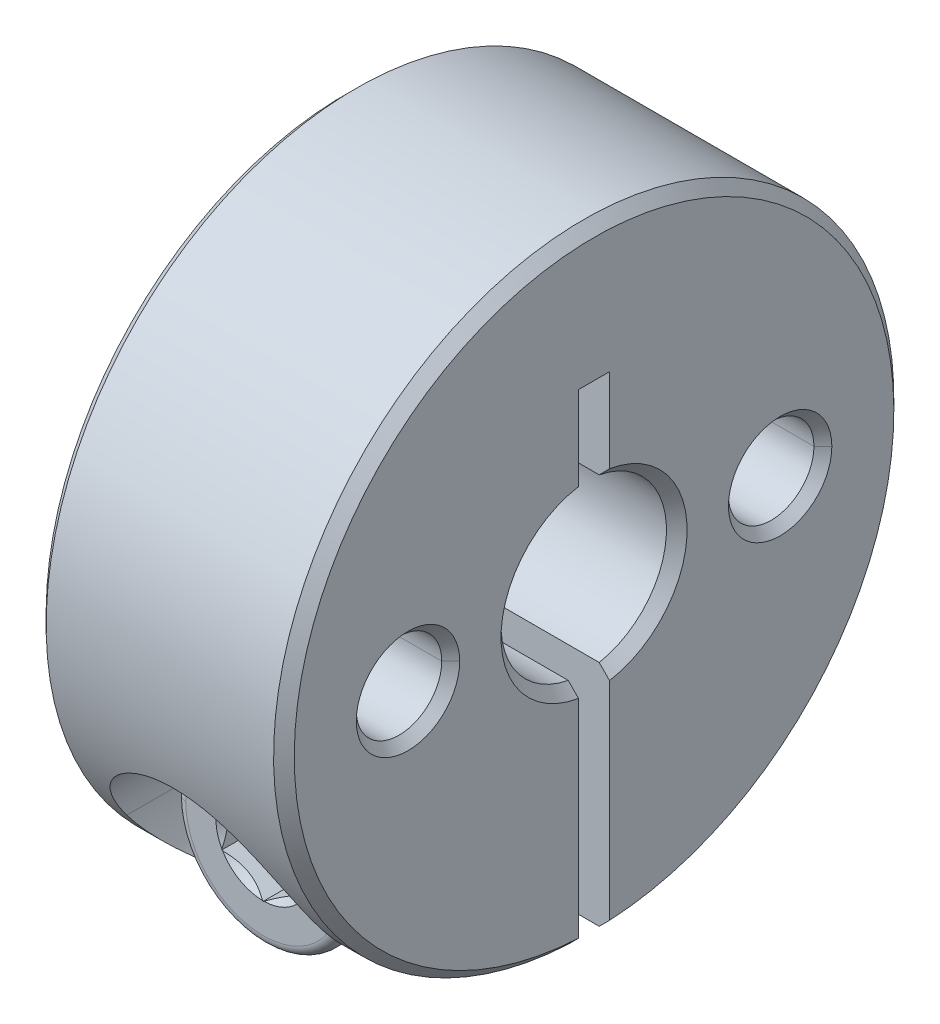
ISO-10303-21;
HEADER;
FILE_DESCRIPTION(('STEP AP214'),'2;1');
FILE_NAME('part.step','',(''),(''),'','','');
FILE_SCHEMA(('AUTOMOTIVE_DESIGN { 1 0 10303 214 1 1 1 1 }'));
ENDSEC;
DATA;
#1=APPLICATION_CONTEXT('core data for automotive mechanical design processes');
#2=APPLICATION_PROTOCOL_DEFINITION('international standard','automotive_design',2000,#1);
#3=PRODUCT_CONTEXT('',#1,'mechanical');
#4=PRODUCT('Part','Part','',(#3));
#5=PRODUCT_RELATED_PRODUCT_CATEGORY('part','',(#4));
#6=PRODUCT_DEFINITION_FORMATION('','',#4);
#7=PRODUCT_DEFINITION_CONTEXT('part definition',#1,'design');
#8=PRODUCT_DEFINITION('design','',#6,#7);
#9=PRODUCT_DEFINITION_SHAPE('','',#8);
#10=(LENGTH_UNIT() NAMED_UNIT(*) SI_UNIT(.MILLI.,.METRE.));
#11=(NAMED_UNIT(*) PLANE_ANGLE_UNIT() SI_UNIT($,.RADIAN.));
#12=(NAMED_UNIT(*) SI_UNIT($,.STERADIAN.) SOLID_ANGLE_UNIT());
#13=UNCERTAINTY_MEASURE_WITH_UNIT(LENGTH_MEASURE(1.E-05),#10,'distance_accuracy_value','');
#14=(GEOMETRIC_REPRESENTATION_CONTEXT(3) GLOBAL_UNCERTAINTY_ASSIGNED_CONTEXT((#13)) GLOBAL_UNIT_ASSIGNED_CONTEXT((#10,
#11,#12)) REPRESENTATION_CONTEXT('',''));
#15=CARTESIAN_POINT('',(0.,0.,0.));
#16=DIRECTION('',(0.,0.,1.));
#17=DIRECTION('',(1.,0.,0.));
#18=AXIS2_PLACEMENT_3D('',#15,#16,#17);
#19=CARTESIAN_POINT('',(0.,0.,5.));
#20=DIRECTION('',(0.,0.,1.));
#21=DIRECTION('',(1.,0.,0.));
#22=AXIS2_PLACEMENT_3D('',#19,#20,#21);
#23=PLANE('',#22);
#24=CARTESIAN_POINT('',(0.,-9.,5.));
#25=DIRECTION('',(0.,0.,-1.));
#26=DIRECTION('',(-1.,0.,0.));
#27=AXIS2_PLACEMENT_3D('',#24,#25,#26);
#28=CIRCLE('',#27,4.25);
#29=CARTESIAN_POINT('',(-4.25,-9.,5.));
#30=VERTEX_POINT('',#29);
#31=CARTESIAN_POINT('',(4.25,-9.,5.));
#32=VERTEX_POINT('',#31);
#33=EDGE_CURVE('E977',#30,#32,#28,.T.);
#34=ORIENTED_EDGE('',*,*,#33,.T.);
#35=CARTESIAN_POINT('',(0.,-9.,5.));
#36=DIRECTION('',(0.,0.,-1.));
#37=DIRECTION('',(1.,0.,0.));
#38=AXIS2_PLACEMENT_3D('',#35,#36,#37);
#39=CIRCLE('',#38,4.25);
#40=EDGE_CURVE('E1171',#32,#30,#39,.T.);
#41=ORIENTED_EDGE('',*,*,#40,.T.);
#42=EDGE_LOOP('',(#34,#41));
#43=FACE_BOUND('',#42,.T.);
#44=CARTESIAN_POINT('',(0.,-9.,5.));
#45=DIRECTION('',(0.,0.,1.));
#46=DIRECTION('',(-1.,0.,0.));
#47=AXIS2_PLACEMENT_3D('',#44,#45,#46);
#48=CIRCLE('',#47,4.6);
#49=CARTESIAN_POINT('',(-4.6,-9.,5.));
#50=VERTEX_POINT('',#49);
#51=CARTESIAN_POINT('',(4.6,-9.,5.));
#52=VERTEX_POINT('',#51);
#53=EDGE_CURVE('E1044',#50,#52,#48,.T.);
#54=ORIENTED_EDGE('',*,*,#53,.T.);
#55=CARTESIAN_POINT('',(0.,-9.,5.));
#56=DIRECTION('',(0.,0.,1.));
#57=DIRECTION('',(1.,0.,0.));
#58=AXIS2_PLACEMENT_3D('',#55,#56,#57);
#59=CIRCLE('',#58,4.6);
#60=EDGE_CURVE('E11',#52,#50,#59,.T.);
#61=ORIENTED_EDGE('',*,*,#60,.T.);
#62=EDGE_LOOP('',(#54,#61));
#63=FACE_BOUND('',#62,.T.);
#64=ADVANCED_FACE('F17',(#43,#63),#23,.T.);
#65=CARTESIAN_POINT('',(0.,-9.,5.));
#66=DIRECTION('',(0.,0.,1.));
#67=DIRECTION('',(1.,0.,0.));
#68=AXIS2_PLACEMENT_3D('',#65,#66,#67);
#69=CYLINDRICAL_SURFACE('',#68,4.6);
#70=DIRECTION('',(0.,0.,1.));
#71=VECTOR('',#70,1.);
#72=CARTESIAN_POINT('',(-4.6,-9.,5.));
#73=LINE('',#72,#71);
#74=CARTESIAN_POINT('',(-4.6,-9.,12.));
#75=VERTEX_POINT('',#74);
#76=EDGE_CURVE('E1048',#50,#75,#73,.T.);
#77=ORIENTED_EDGE('',*,*,#76,.F.);
#78=ORIENTED_EDGE('',*,*,#60,.F.);
#79=DIRECTION('',(0.,0.,1.));
#80=VECTOR('',#79,1.);
#81=CARTESIAN_POINT('',(4.6,-9.,5.));
#82=LINE('',#81,#80);
#83=CARTESIAN_POINT('',(4.6,-9.,12.));
#84=VERTEX_POINT('',#83);
#85=EDGE_CURVE('E1049',#52,#84,#82,.T.);
#86=ORIENTED_EDGE('',*,*,#85,.T.);
#87=CARTESIAN_POINT('',(4.6,-9.,12.));
#88=CARTESIAN_POINT('',(4.60000088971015,-8.92321521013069,12.0575902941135));
#89=CARTESIAN_POINT('',(4.59807733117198,-8.84585643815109,12.1144268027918));
#90=CARTESIAN_POINT('',(4.59027328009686,-8.69131059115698,12.2256892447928));
#91=CARTESIAN_POINT('',(4.58445020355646,-8.61413710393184,12.2801381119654));
#92=CARTESIAN_POINT('',(4.56885907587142,-8.46015751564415,12.3866260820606));
#93=CARTESIAN_POINT('',(4.55914817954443,-8.3833617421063,12.438688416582));
#94=CARTESIAN_POINT('',(4.53580494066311,-8.2303378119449,12.5404027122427));
#95=CARTESIAN_POINT('',(4.52222915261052,-8.15411666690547,12.5900781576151));
#96=CARTESIAN_POINT('',(4.4911895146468,-8.00243952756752,12.6870185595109));
#97=CARTESIAN_POINT('',(4.47378129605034,-7.92698729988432,12.734307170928));
#98=CARTESIAN_POINT('',(4.43512033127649,-7.77704386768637,12.8264736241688));
#99=CARTESIAN_POINT('',(4.41392196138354,-7.70255326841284,12.8713752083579));
#100=CARTESIAN_POINT('',(4.36773448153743,-7.55472706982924,12.9587679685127));
#101=CARTESIAN_POINT('',(4.34279815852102,-7.48138903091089,13.0012828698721));
#102=CARTESIAN_POINT('',(4.28919756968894,-7.3360568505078,13.0839007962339));
#103=CARTESIAN_POINT('',(4.26058418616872,-7.26405741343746,13.1240274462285));
#104=CARTESIAN_POINT('',(4.20184047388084,-7.12659228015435,13.1991443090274));
#105=CARTESIAN_POINT('',(4.17202614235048,-7.0610742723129,13.2342860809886));
#106=CARTESIAN_POINT('',(4.1090403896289,-6.93094155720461,13.3028582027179));
#107=CARTESIAN_POINT('',(4.0758752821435,-6.86632540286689,13.3362915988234));
#108=CARTESIAN_POINT('',(4.0061822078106,-6.73818295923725,13.4014457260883));
#109=CARTESIAN_POINT('',(3.96965878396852,-6.67465533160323,13.4331686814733));
#110=CARTESIAN_POINT('',(3.89325382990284,-6.54888099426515,13.4949032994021));
#111=CARTESIAN_POINT('',(3.8533750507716,-6.48663328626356,13.5249163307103));
#112=CARTESIAN_POINT('',(3.77027503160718,-6.36361337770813,13.5832318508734));
#113=CARTESIAN_POINT('',(3.72705475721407,-6.30284075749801,13.611534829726));
#114=CARTESIAN_POINT('',(3.63729867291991,-6.18296858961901,13.6664310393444));
#115=CARTESIAN_POINT('',(3.59076207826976,-6.12386944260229,13.6930238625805));
#116=CARTESIAN_POINT('',(3.49441247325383,-6.00754456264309,13.7445011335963));
#117=CARTESIAN_POINT('',(3.44459699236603,-5.95032029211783,13.7693842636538));
#118=CARTESIAN_POINT('',(3.34173958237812,-5.83794598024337,13.817441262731));
#119=CARTESIAN_POINT('',(3.28869358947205,-5.78279869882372,13.8406128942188));
#120=CARTESIAN_POINT('',(3.1837499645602,-5.6790433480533,13.8834946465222));
#121=CARTESIAN_POINT('',(3.13207921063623,-5.63025894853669,13.9033339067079));
#122=CARTESIAN_POINT('',(3.02582950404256,-5.53452631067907,13.9417059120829));
#123=CARTESIAN_POINT('',(2.9712314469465,-5.48759482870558,13.9602275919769));
#124=CARTESIAN_POINT('',(2.85916211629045,-5.39576894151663,13.9959628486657));
#125=CARTESIAN_POINT('',(2.80167145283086,-5.35089369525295,14.0131648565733));
#126=CARTESIAN_POINT('',(2.68386500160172,-5.2633842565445,14.0462617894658));
#127=CARTESIAN_POINT('',(2.6235297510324,-5.22077171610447,14.0621447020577));
#128=CARTESIAN_POINT('',(2.50009613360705,-5.13799420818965,14.0926038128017));
#129=CARTESIAN_POINT('',(2.43697845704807,-5.09785345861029,14.1071675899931));
#130=CARTESIAN_POINT('',(2.30805633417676,-5.02022765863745,14.134988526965));
#131=CARTESIAN_POINT('',(2.24223296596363,-4.98276944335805,14.1482328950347));
#132=CARTESIAN_POINT('',(2.10799125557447,-4.91071776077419,14.173416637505));
#133=CARTESIAN_POINT('',(2.03955462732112,-4.87615377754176,14.1853429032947));
#134=CARTESIAN_POINT('',(1.90019213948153,-4.81009881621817,14.2078859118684));
#135=CARTESIAN_POINT('',(1.82924886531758,-4.77863997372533,14.218489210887));
#136=CARTESIAN_POINT('',(1.68981619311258,-4.72099527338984,14.237740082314));
#137=CARTESIAN_POINT('',(1.62141962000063,-4.69461041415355,14.2464649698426));
#138=CARTESIAN_POINT('',(1.48294402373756,-4.64496658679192,14.2627607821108));
#139=CARTESIAN_POINT('',(1.41285791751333,-4.62172524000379,14.2703252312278));
#140=CARTESIAN_POINT('',(1.27114104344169,-4.5784935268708,14.2842956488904));
#141=CARTESIAN_POINT('',(1.19950380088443,-4.55852219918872,14.2906948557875));
#142=CARTESIAN_POINT('',(1.05483165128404,-4.52195024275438,14.302336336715));
#143=CARTESIAN_POINT('',(0.981791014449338,-4.50537004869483,14.3075716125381));
#144=CARTESIAN_POINT('',(0.834468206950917,-4.47569416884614,14.3168851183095));
#145=CARTESIAN_POINT('',(0.76018118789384,-4.46262028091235,14.3209561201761));
#146=CARTESIAN_POINT('',(0.610530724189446,-4.44006423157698,14.3279414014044));
#147=CARTESIAN_POINT('',(0.535163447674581,-4.4306051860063,14.3308482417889));
#148=CARTESIAN_POINT('',(0.383526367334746,-4.41537879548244,14.3355053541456));
#149=CARTESIAN_POINT('',(0.30725388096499,-4.40963582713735,14.3372479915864));
#150=CARTESIAN_POINT('',(0.153988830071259,-4.4019336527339,14.3395769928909));
#151=CARTESIAN_POINT('',(0.0769948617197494,-4.40000001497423,14.3401555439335));
#152=CARTESIAN_POINT('',(-0.076981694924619,-4.39999998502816,14.3401561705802));
#153=CARTESIAN_POINT('',(-0.153964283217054,-4.40193302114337,14.339578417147));
#154=CARTESIAN_POINT('',(-0.307209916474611,-4.4096330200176,14.3372507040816));
#155=CARTESIAN_POINT('',(-0.383474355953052,-4.41537458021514,14.3355085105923));
#156=CARTESIAN_POINT('',(-0.535098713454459,-4.43059768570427,14.3308521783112));
#157=CARTESIAN_POINT('',(-0.61046129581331,-4.44005501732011,14.3279456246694));
#158=CARTESIAN_POINT('',(-0.760105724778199,-4.46260766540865,14.3209607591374));
#159=CARTESIAN_POINT('',(-0.834391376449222,-4.47568002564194,14.3168898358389));
#160=CARTESIAN_POINT('',(-0.981714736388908,-4.50535335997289,14.307576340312));
#161=CARTESIAN_POINT('',(-1.05475725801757,-4.52193269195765,14.3023409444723));
#162=CARTESIAN_POINT('',(-1.19943635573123,-4.55850390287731,14.2906990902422));
#163=CARTESIAN_POINT('',(-1.27107861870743,-4.57847549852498,14.2842995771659));
#164=CARTESIAN_POINT('',(-1.41280855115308,-4.62170917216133,14.2703283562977));
#165=CARTESIAN_POINT('',(-1.48290264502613,-4.64495235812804,14.2627633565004));
#166=CARTESIAN_POINT('',(-1.62139706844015,-4.69460172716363,14.2464664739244));
#167=CARTESIAN_POINT('',(-1.68980442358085,-4.72099043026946,14.2377410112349));
#168=CARTESIAN_POINT('',(-1.82923745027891,-4.77863523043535,14.2184915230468));
#169=CARTESIAN_POINT('',(-1.90017076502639,-4.81008932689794,14.2078905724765));
#170=CARTESIAN_POINT('',(-2.03951667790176,-4.87613515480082,14.1853514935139));
#171=CARTESIAN_POINT('',(-2.1079466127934,-4.91069489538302,14.173426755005));
#172=CARTESIAN_POINT('',(-2.24217814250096,-4.9827389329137,14.1482455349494));
#173=CARTESIAN_POINT('',(-2.30799793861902,-5.02019388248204,14.1350021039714));
#174=CARTESIAN_POINT('',(-2.43691591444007,-5.09781442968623,14.1071824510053));
#175=CARTESIAN_POINT('',(-2.50003292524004,-5.13795332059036,14.0926189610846));
#176=CARTESIAN_POINT('',(-2.62346797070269,-5.22072879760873,14.062159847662));
#177=CARTESIAN_POINT('',(-2.68380521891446,-5.26334128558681,14.0462765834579));
#178=CARTESIAN_POINT('',(-2.80161815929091,-5.35085268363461,14.0131783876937));
#179=CARTESIAN_POINT('',(-2.85911321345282,-5.39573005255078,13.995975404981));
#180=CARTESIAN_POINT('',(-2.97119350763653,-5.48756257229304,13.9602375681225));
#181=CARTESIAN_POINT('',(-3.02579803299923,-5.53449866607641,13.941714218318));
#182=CARTESIAN_POINT('',(-3.13206259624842,-5.63024327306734,13.9033385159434));
#183=CARTESIAN_POINT('',(-3.18374163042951,-5.67903512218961,13.8834971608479));
#184=CARTESIAN_POINT('',(-3.28868531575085,-5.7827905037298,13.8406172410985));
#185=CARTESIAN_POINT('',(-3.34172393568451,-5.83792971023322,13.8174500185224));
#186=CARTESIAN_POINT('',(-3.4445695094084,-5.95028944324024,13.7694004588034));
#187=CARTESIAN_POINT('',(-3.49438039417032,-6.00750730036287,13.7445202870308));
#188=CARTESIAN_POINT('',(-3.59072345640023,-6.12382134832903,13.6930478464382));
#189=CARTESIAN_POINT('',(-3.63725796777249,-6.18291615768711,13.6664568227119));
#190=CARTESIAN_POINT('',(-3.7270121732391,-6.30278195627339,13.6115630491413));
#191=CARTESIAN_POINT('',(-3.77023251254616,-6.36355261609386,13.5832606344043));
#192=CARTESIAN_POINT('',(-3.85333458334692,-6.48657119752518,13.5249450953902));
#193=CARTESIAN_POINT('',(-3.89321520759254,-6.54881960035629,13.4949314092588));
#194=CARTESIAN_POINT('',(-3.96962538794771,-6.67459817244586,13.4331943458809));
#195=CARTESIAN_POINT('',(-4.0061520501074,-6.73812939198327,13.4014695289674));
#196=CARTESIAN_POINT('',(-4.07585272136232,-6.86628203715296,13.3363104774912));
#197=CARTESIAN_POINT('',(-4.10902204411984,-6.93090484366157,13.3028739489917));
#198=CARTESIAN_POINT('',(-4.17201698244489,-7.06105415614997,13.2342946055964));
#199=CARTESIAN_POINT('',(-4.20183614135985,-7.12658214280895,13.1991486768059));
#200=CARTESIAN_POINT('',(-4.2605820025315,-7.26405230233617,13.1240315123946));
#201=CARTESIAN_POINT('',(-4.28919351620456,-7.33604666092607,13.0839091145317));
#202=CARTESIAN_POINT('',(-4.34279140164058,-7.48136989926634,13.0012983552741));
#203=CARTESIAN_POINT('',(-4.36772680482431,-7.5547040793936,12.9587863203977));
#204=CARTESIAN_POINT('',(-4.41391331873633,-7.70252400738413,12.8713982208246));
#205=CARTESIAN_POINT('',(-4.43511155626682,-7.77701219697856,12.8264983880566));
#206=CARTESIAN_POINT('',(-4.47377289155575,-7.92695231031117,12.7343342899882));
#207=CARTESIAN_POINT('',(-4.49118152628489,-8.00240362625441,12.6870462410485));
#208=CARTESIAN_POINT('',(-4.52222240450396,-8.15408051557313,12.5901058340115));
#209=CARTESIAN_POINT('',(-4.53579893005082,-8.23030231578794,12.5404297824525));
#210=CARTESIAN_POINT('',(-4.5591438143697,-8.38332916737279,12.4387131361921));
#211=CARTESIAN_POINT('',(-4.5688555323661,-8.46012719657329,12.3866490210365));
#212=CARTESIAN_POINT('',(-4.58444823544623,-8.61411292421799,12.2801563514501));
#213=CARTESIAN_POINT('',(-4.59027198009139,-8.69129028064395,12.2257045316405));
#214=CARTESIAN_POINT('',(-4.59807705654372,-8.84584548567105,12.1144350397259));
#215=CARTESIAN_POINT('',(-4.60000088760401,-8.92320972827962,12.0575944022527));
#216=CARTESIAN_POINT('',(-4.6,-9.00000000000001,12.));
#217=B_SPLINE_CURVE_WITH_KNOTS('',3,(#87,#88,#89,#90,#91,#92,#93,#94,#95,#96,#97,#98,#99,#100,
#101,#102,#103,#104,#105,#106,#107,#108,#109,#110,#111,#112,#113,#114,#115,#116,#117,#118,#119,
#120,#121,#122,#123,#124,#125,#126,#127,#128,#129,#130,#131,#132,#133,#134,#135,#136,#137,#138,
#139,#140,#141,#142,#143,#144,#145,#146,#147,#148,#149,#150,#151,#152,#153,#154,#155,#156,#157,
#158,#159,#160,#161,#162,#163,#164,#165,#166,#167,#168,#169,#170,#171,#172,#173,#174,#175,#176,
#177,#178,#179,#180,#181,#182,#183,#184,#185,#186,#187,#188,#189,#190,#191,#192,#193,#194,#195,
#196,#197,#198,#199,#200,#201,#202,#203,#204,#205,#206,#207,#208,#209,#210,#211,#212,#213,#214,
#215,#216),.UNSPECIFIED.,.F.,.F.,(4,2,2,2,2,2,2,2,2,2,2,2,2,2,2,2,2,2,2,2,2,2,2,2,2,2,2,2,2,2,2,
2,2,2,2,2,2,2,2,2,2,2,2,2,2,2,2,2,2,2,2,2,2,2,2,2,2,2,2,2,2,2,2,2,4),(0.,0.287932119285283,
0.571715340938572,0.85147146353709,1.12732761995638,1.39941640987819,1.66787601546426,
1.93285029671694,2.19448886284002,2.43470631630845,2.67447929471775,2.91393255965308,
3.15319137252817,3.39238129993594,3.63162801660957,3.87105710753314,4.11079387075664,
4.33204387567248,4.55497398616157,4.77967623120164,5.00624047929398,5.23475440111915,
5.46530344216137,5.69797080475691,5.93283743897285,6.15422535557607,6.3768069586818,
6.60064163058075,6.82578776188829,7.0523027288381,7.28024287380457,7.50966348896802,
7.74061880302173,7.97153997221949,8.20093619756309,8.42886172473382,8.65537185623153,
8.88052293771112,9.10437234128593,9.32697844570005,9.54840061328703,9.78323355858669,
10.015876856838,10.2464114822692,10.4749206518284,10.7014898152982,10.9262066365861,
11.1491609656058,11.3704448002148,11.6101463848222,11.8495503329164,12.088781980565,
12.3279669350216,12.5672308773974,12.8066993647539,13.0464976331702,13.2867504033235,
13.5483687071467,13.8133284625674,14.0817793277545,14.3538652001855,14.6297242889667,
14.9094892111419,15.1932871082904,15.4812397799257),.UNSPECIFIED.);
#218=EDGE_CURVE('E27',#84,#75,#217,.T.);
#219=ORIENTED_EDGE('',*,*,#218,.T.);
#220=EDGE_LOOP('',(#77,#78,#86,#219));
#221=FACE_BOUND('',#220,.T.);
#222=ADVANCED_FACE('F498',(#221),#69,.F.);
#223=CARTESIAN_POINT('',(6.,0.,0.));
#224=DIRECTION('',(1.,0.,0.));
#225=DIRECTION('',(0.,0.,-1.));
#226=AXIS2_PLACEMENT_3D('',#223,#224,#225);
#227=CYLINDRICAL_SURFACE('',#226,15.);
#228=CARTESIAN_POINT('',(-2.067,-9.,-12.));
#229=CARTESIAN_POINT('',(-2.06700006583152,-8.9737616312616,-12.0196786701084));
#230=CARTESIAN_POINT('',(-2.06650039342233,-8.94745228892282,-12.0392634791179));
#231=CARTESIAN_POINT('',(-2.06450447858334,-8.89521053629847,-12.0778733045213));
#232=CARTESIAN_POINT('',(-2.06302678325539,-8.86928012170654,-12.0969019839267));
#233=CARTESIAN_POINT('',(-2.05911549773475,-8.81783131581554,-12.1343996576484));
#234=CARTESIAN_POINT('',(-2.05670032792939,-8.79231430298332,-12.1528724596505));
#235=CARTESIAN_POINT('',(-2.05095551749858,-8.74172465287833,-12.1892581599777));
#236=CARTESIAN_POINT('',(-2.04764414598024,-8.71665279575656,-12.2071750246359));
#237=CARTESIAN_POINT('',(-2.04014880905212,-8.66698286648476,-12.2424487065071));
#238=CARTESIAN_POINT('',(-2.035982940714,-8.64238500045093,-12.2598096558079));
#239=CARTESIAN_POINT('',(-2.02682080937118,-8.59368965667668,-12.2939713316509));
#240=CARTESIAN_POINT('',(-2.02184245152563,-8.56959183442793,-12.3107763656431));
#241=CARTESIAN_POINT('',(-2.01109770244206,-8.52192043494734,-12.3438260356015));
#242=CARTESIAN_POINT('',(-2.00534900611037,-8.49834598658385,-12.3600751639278));
#243=CARTESIAN_POINT('',(-1.99310595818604,-8.45174252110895,-12.3920128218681));
#244=CARTESIAN_POINT('',(-1.98662907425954,-8.42871213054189,-12.4077060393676));
#245=CARTESIAN_POINT('',(-1.97297192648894,-8.38321541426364,-12.438531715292));
#246=CARTESIAN_POINT('',(-1.96580888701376,-8.36074723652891,-12.4536690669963));
#247=CARTESIAN_POINT('',(-1.95082142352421,-8.31639099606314,-12.4833826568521));
#248=CARTESIAN_POINT('',(-1.94301396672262,-8.29450062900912,-12.4979640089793));
#249=CARTESIAN_POINT('',(-1.92677946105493,-8.25131400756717,-12.5265658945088));
#250=CARTESIAN_POINT('',(-1.91836910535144,-8.23001501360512,-12.540591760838));
#251=CARTESIAN_POINT('',(-1.90096959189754,-8.18802159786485,-12.5680805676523));
#252=CARTESIAN_POINT('',(-1.89199685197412,-8.16732405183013,-12.581549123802));
#253=CARTESIAN_POINT('',(-1.87310161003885,-8.12563469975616,-12.608519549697));
#254=CARTESIAN_POINT('',(-1.86316239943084,-8.10464661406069,-12.6220154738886));
#255=CARTESIAN_POINT('',(-1.84261028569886,-8.06308570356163,-12.6485940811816));
#256=CARTESIAN_POINT('',(-1.832005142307,-8.04251082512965,-12.6616795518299));
#257=CARTESIAN_POINT('',(-1.81013950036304,-8.00179531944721,-12.6874353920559));
#258=CARTESIAN_POINT('',(-1.79888660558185,-7.98165240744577,-12.7001086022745));
#259=CARTESIAN_POINT('',(-1.77574489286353,-7.94182027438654,-12.7250403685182));
#260=CARTESIAN_POINT('',(-1.76386350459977,-7.92212853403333,-12.7373017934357));
#261=CARTESIAN_POINT('',(-1.73948457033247,-7.88321697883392,-12.7614098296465));
#262=CARTESIAN_POINT('',(-1.72699426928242,-7.86399442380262,-12.773259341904));
#263=CARTESIAN_POINT('',(-1.70141776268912,-7.8260386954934,-12.7965435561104));
#264=CARTESIAN_POINT('',(-1.68833860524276,-7.80730257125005,-12.807981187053));
#265=CARTESIAN_POINT('',(-1.66160504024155,-7.77033626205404,-12.830441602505));
#266=CARTESIAN_POINT('',(-1.64795747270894,-7.75210292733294,-12.8414673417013));
#267=CARTESIAN_POINT('',(-1.62010811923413,-7.71615788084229,-12.8631039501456));
#268=CARTESIAN_POINT('',(-1.60591295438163,-7.69844283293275,-12.8737177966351));
#269=CARTESIAN_POINT('',(-1.57698977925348,-7.66354916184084,-12.894530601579));
#270=CARTESIAN_POINT('',(-1.5622681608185,-7.64636702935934,-12.9047325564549));
#271=CARTESIAN_POINT('',(-1.53231374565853,-7.61255309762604,-12.9247215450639));
#272=CARTESIAN_POINT('',(-1.51708710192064,-7.59591762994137,-12.9345115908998));
#273=CARTESIAN_POINT('',(-1.48614460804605,-7.56321008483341,-12.9536768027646));
#274=CARTESIAN_POINT('',(-1.47043466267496,-7.54713419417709,-12.9630549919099));
#275=CARTESIAN_POINT('',(-1.43854763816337,-7.51555785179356,-12.9813962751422));
#276=CARTESIAN_POINT('',(-1.42237620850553,-7.50005345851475,-12.9903624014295));
#277=CARTESIAN_POINT('',(-1.39020829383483,-7.47020636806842,-13.0075494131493));
#278=CARTESIAN_POINT('',(-1.37423891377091,-7.45584323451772,-13.0157855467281));
#279=CARTESIAN_POINT('',(-1.34185605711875,-7.42762277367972,-13.0319055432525));
#280=CARTESIAN_POINT('',(-1.32544537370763,-7.41376317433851,-13.0397910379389));
#281=CARTESIAN_POINT('',(-1.29219589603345,-7.3865633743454,-13.0552095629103));
#282=CARTESIAN_POINT('',(-1.27535971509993,-7.37322088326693,-13.0627441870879));
#283=CARTESIAN_POINT('',(-1.24127568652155,-7.34706841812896,-13.0774610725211));
#284=CARTESIAN_POINT('',(-1.22403027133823,-7.33425614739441,-13.0846448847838));
#285=CARTESIAN_POINT('',(-1.18914461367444,-7.30917670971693,-13.0986601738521));
#286=CARTESIAN_POINT('',(-1.17150662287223,-7.29690725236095,-13.1054931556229));
#287=CARTESIAN_POINT('',(-1.13585304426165,-7.27292549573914,-13.1188068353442));
#288=CARTESIAN_POINT('',(-1.11783952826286,-7.26121092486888,-13.1252889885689));
#289=CARTESIAN_POINT('',(-1.0814524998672,-7.23835044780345,-13.1379010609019));
#290=CARTESIAN_POINT('',(-1.06308088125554,-7.22720230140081,-13.1440323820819));
#291=CARTESIAN_POINT('',(-1.02599560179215,-7.20548562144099,-13.1559428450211));
#292=CARTESIAN_POINT('',(-1.00728365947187,-7.19491489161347,-13.1617233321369));
#293=CARTESIAN_POINT('',(-0.969536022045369,-7.17436342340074,-13.1729321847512));
#294=CARTESIAN_POINT('',(-0.95050187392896,-7.16438054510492,-13.1783618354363));
#295=CARTESIAN_POINT('',(-0.912128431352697,-7.14501457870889,-13.1888690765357));
#296=CARTESIAN_POINT('',(-0.892790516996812,-7.13562941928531,-13.193947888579));
#297=CARTESIAN_POINT('',(-0.853828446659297,-7.11746809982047,-13.2037535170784));
#298=CARTESIAN_POINT('',(-0.834205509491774,-7.10868994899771,-13.2084814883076));
#299=CARTESIAN_POINT('',(-0.794692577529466,-7.09175125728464,-13.217585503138));
#300=CARTESIAN_POINT('',(-0.774803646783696,-7.08358881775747,-13.221962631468));
#301=CARTESIAN_POINT('',(-0.734778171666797,-7.06788955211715,-13.2303650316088));
#302=CARTESIAN_POINT('',(-0.714642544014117,-7.06035093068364,-13.2343913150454));
#303=CARTESIAN_POINT('',(-0.674143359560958,-7.04590668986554,-13.2420920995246));
#304=CARTESIAN_POINT('',(-0.653780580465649,-7.03899938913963,-13.2457675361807));
#305=CARTESIAN_POINT('',(-0.612846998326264,-7.02582455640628,-13.2527667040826));
#306=CARTESIAN_POINT('',(-0.592276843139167,-7.01955546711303,-13.2560912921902));
#307=CARTESIAN_POINT('',(-0.550948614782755,-7.00766319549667,-13.2623888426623));
#308=CARTESIAN_POINT('',(-0.530191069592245,-7.00203858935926,-13.2653625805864));
#309=CARTESIAN_POINT('',(-0.488508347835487,-6.99144078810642,-13.2709585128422));
#310=CARTESIAN_POINT('',(-0.467583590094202,-6.98646631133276,-13.273581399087));
#311=CARTESIAN_POINT('',(-0.425586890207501,-6.97717363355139,-13.2784757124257));
#312=CARTESIAN_POINT('',(-0.404515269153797,-6.97285430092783,-13.2807477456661));
#313=CARTESIAN_POINT('',(-0.362245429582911,-6.9648761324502,-13.2849404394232));
#314=CARTESIAN_POINT('',(-0.341047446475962,-6.96121632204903,-13.2868616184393));
#315=CARTESIAN_POINT('',(-0.298545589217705,-6.95456077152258,-13.2903526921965));
#316=CARTESIAN_POINT('',(-0.277241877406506,-6.95156422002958,-13.2919230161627));
#317=CARTESIAN_POINT('',(-0.234549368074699,-6.94623811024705,-13.2947124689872));
#318=CARTESIAN_POINT('',(-0.213160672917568,-6.94390790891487,-13.2959319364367));
#319=CARTESIAN_POINT('',(-0.170319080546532,-6.93991676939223,-13.2980197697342));
#320=CARTESIAN_POINT('',(-0.148866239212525,-6.93825536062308,-13.2988883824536));
#321=CARTESIAN_POINT('',(-0.105917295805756,-6.93560342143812,-13.3002745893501));
#322=CARTESIAN_POINT('',(-0.084421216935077,-6.93461259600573,-13.3007923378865));
#323=CARTESIAN_POINT('',(-0.041406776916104,-6.93330278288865,-13.3014769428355));
#324=CARTESIAN_POINT('',(-0.0198884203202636,-6.93298367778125,-13.3016438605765));
#325=CARTESIAN_POINT('',(0.0231450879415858,-6.93301760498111,-13.3016267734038));
#326=CARTESIAN_POINT('',(0.0446602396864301,-6.93337055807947,-13.3014428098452));
#327=CARTESIAN_POINT('',(0.0876675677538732,-6.93474786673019,-13.3007239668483));
#328=CARTESIAN_POINT('',(0.109159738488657,-6.93577235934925,-13.3001890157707));
#329=CARTESIAN_POINT('',(0.152100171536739,-6.93849143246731,-13.2987683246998));
#330=CARTESIAN_POINT('',(0.173548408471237,-6.94018632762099,-13.2978824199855));
#331=CARTESIAN_POINT('',(0.216380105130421,-6.94424423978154,-13.2957599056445));
#332=CARTESIAN_POINT('',(0.237763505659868,-6.94660774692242,-13.2945230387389));
#333=CARTESIAN_POINT('',(0.280444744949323,-6.95200026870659,-13.2916986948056));
#334=CARTESIAN_POINT('',(0.301742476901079,-6.95502994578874,-13.2901108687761));
#335=CARTESIAN_POINT('',(0.344231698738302,-6.96175154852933,-13.2865846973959));
#336=CARTESIAN_POINT('',(0.365423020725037,-6.9654443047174,-13.2846459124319));
#337=CARTESIAN_POINT('',(0.407678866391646,-6.9734881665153,-13.2804179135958));
#338=CARTESIAN_POINT('',(0.42874314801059,-6.97784026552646,-13.27812817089));
#339=CARTESIAN_POINT('',(0.470724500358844,-6.98719827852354,-13.2731983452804));
#340=CARTESIAN_POINT('',(0.491641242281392,-6.99220534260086,-13.2705576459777));
#341=CARTESIAN_POINT('',(0.533307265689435,-7.00286812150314,-13.2649259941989));
#342=CARTESIAN_POINT('',(0.554056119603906,-7.00852513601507,-13.2619343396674));
#343=CARTESIAN_POINT('',(0.595366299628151,-7.02048202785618,-13.2556008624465));
#344=CARTESIAN_POINT('',(0.615927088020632,-7.02678334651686,-13.2522582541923));
#345=CARTESIAN_POINT('',(0.656841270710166,-7.04002244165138,-13.2452229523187));
#346=CARTESIAN_POINT('',(0.67719400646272,-7.04696179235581,-13.2415293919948));
#347=CARTESIAN_POINT('',(0.717672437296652,-7.0614699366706,-13.2337922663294));
#348=CARTESIAN_POINT('',(0.737797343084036,-7.06904042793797,-13.2297477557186));
#349=CARTESIAN_POINT('',(0.777800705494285,-7.0848032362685,-13.2213088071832));
#350=CARTESIAN_POINT('',(0.797678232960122,-7.09299736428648,-13.2169133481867));
#351=CARTESIAN_POINT('',(0.837167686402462,-7.10999923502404,-13.2077725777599));
#352=CARTESIAN_POINT('',(0.856778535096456,-7.11880889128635,-13.2030261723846));
#353=CARTESIAN_POINT('',(0.895715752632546,-7.13703302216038,-13.1931835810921));
#354=CARTESIAN_POINT('',(0.915040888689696,-7.14644950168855,-13.1880862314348));
#355=CARTESIAN_POINT('',(0.95338809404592,-7.16587790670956,-13.1775418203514));
#356=CARTESIAN_POINT('',(0.972408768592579,-7.17589191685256,-13.1720935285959));
#357=CARTESIAN_POINT('',(1.01012877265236,-7.19650544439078,-13.1608472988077));
#358=CARTESIAN_POINT('',(1.02882653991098,-7.20710711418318,-13.1550480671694));
#359=CARTESIAN_POINT('',(1.0658827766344,-7.22888546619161,-13.1431000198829));
#360=CARTESIAN_POINT('',(1.08423951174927,-7.2400643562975,-13.1369498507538));
#361=CARTESIAN_POINT('',(1.12059607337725,-7.26298610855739,-13.1242999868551));
#362=CARTESIAN_POINT('',(1.1385939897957,-7.27473122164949,-13.1177988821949));
#363=CARTESIAN_POINT('',(1.17421566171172,-7.29877384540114,-13.104447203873));
#364=CARTESIAN_POINT('',(1.19183732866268,-7.31107363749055,-13.0975951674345));
#365=CARTESIAN_POINT('',(1.22668962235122,-7.33621352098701,-13.0835416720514));
#366=CARTESIAN_POINT('',(1.24391798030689,-7.34905591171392,-13.0763387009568));
#367=CARTESIAN_POINT('',(1.27796717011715,-7.3752683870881,-13.061583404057));
#368=CARTESIAN_POINT('',(1.29478555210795,-7.38864077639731,-13.0540295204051));
#369=CARTESIAN_POINT('',(1.32799869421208,-7.41590013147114,-13.0385723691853));
#370=CARTESIAN_POINT('',(1.34439082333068,-7.42978939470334,-13.0306675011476));
#371=CARTESIAN_POINT('',(1.37673583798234,-7.45806894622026,-13.0145086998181));
#372=CARTESIAN_POINT('',(1.3926859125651,-7.47246151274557,-13.0062531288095));
#373=CARTESIAN_POINT('',(1.42481097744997,-7.50236603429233,-12.9890275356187));
#374=CARTESIAN_POINT('',(1.440958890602,-7.51789832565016,-12.9800423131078));
#375=CARTESIAN_POINT('',(1.472798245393,-7.5495302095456,-12.9616623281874));
#376=CARTESIAN_POINT('',(1.48848400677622,-7.56563374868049,-12.9522645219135));
#377=CARTESIAN_POINT('',(1.51937748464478,-7.59839634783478,-12.9330596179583));
#378=CARTESIAN_POINT('',(1.53457926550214,-7.61505922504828,-12.9232494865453));
#379=CARTESIAN_POINT('',(1.56448327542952,-7.64892772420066,-12.9032198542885));
#380=CARTESIAN_POINT('',(1.57917932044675,-7.666137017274,-12.8929973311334));
#381=CARTESIAN_POINT('',(1.60805064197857,-7.70108475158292,-12.8721429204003));
#382=CARTESIAN_POINT('',(1.62221949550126,-7.71882670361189,-12.8615080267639));
#383=CARTESIAN_POINT('',(1.65001549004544,-7.75482529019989,-12.8398288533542));
#384=CARTESIAN_POINT('',(1.66363597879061,-7.77308526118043,-12.8287815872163));
#385=CARTESIAN_POINT('',(1.69031461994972,-7.81010456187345,-12.8062776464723));
#386=CARTESIAN_POINT('',(1.70336590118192,-7.82886704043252,-12.794818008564));
#387=CARTESIAN_POINT('',(1.72888585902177,-7.86687518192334,-12.7714893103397));
#388=CARTESIAN_POINT('',(1.74134745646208,-7.88612379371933,-12.7596173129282));
#389=CARTESIAN_POINT('',(1.76566815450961,-7.9250871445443,-12.7354638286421));
#390=CARTESIAN_POINT('',(1.77751997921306,-7.94480462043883,-12.7231794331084));
#391=CARTESIAN_POINT('',(1.8006017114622,-7.98468790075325,-12.6982012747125));
#392=CARTESIAN_POINT('',(1.81182415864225,-8.00485622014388,-12.6855046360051));
#393=CARTESIAN_POINT('',(1.8336279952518,-8.04562213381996,-12.6597013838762));
#394=CARTESIAN_POINT('',(1.84420175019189,-8.06622200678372,-12.6465919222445));
#395=CARTESIAN_POINT('',(1.86469024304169,-8.1078326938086,-12.6199651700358));
#396=CARTESIAN_POINT('',(1.87459719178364,-8.12884555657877,-12.6064450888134));
#397=CARTESIAN_POINT('',(1.89336055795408,-8.17043376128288,-12.5795218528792));
#398=CARTESIAN_POINT('',(1.90223902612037,-8.19100425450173,-12.5661265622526));
#399=CARTESIAN_POINT('',(1.91946237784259,-8.23274873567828,-12.5387796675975));
#400=CARTESIAN_POINT('',(1.92779061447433,-8.25392583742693,-12.5248223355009));
#401=CARTESIAN_POINT('',(1.94387275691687,-8.29687473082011,-12.4963532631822));
#402=CARTESIAN_POINT('',(1.95160973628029,-8.31864926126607,-12.4818360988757));
#403=CARTESIAN_POINT('',(1.96646744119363,-8.36278049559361,-12.4522465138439));
#404=CARTESIAN_POINT('',(1.97357095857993,-8.38513950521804,-12.4371688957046));
#405=CARTESIAN_POINT('',(1.98711954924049,-8.43042520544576,-12.4064583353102));
#406=CARTESIAN_POINT('',(1.99354714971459,-8.45335375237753,-12.3908204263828));
#407=CARTESIAN_POINT('',(2.00570133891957,-8.49976145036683,-12.3589890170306));
#408=CARTESIAN_POINT('',(2.01141020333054,-8.52324198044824,-12.3427907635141));
#409=CARTESIAN_POINT('',(2.02208415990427,-8.57073402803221,-12.3098384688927));
#410=CARTESIAN_POINT('',(2.02703129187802,-8.59474642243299,-12.2930798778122));
#411=CARTESIAN_POINT('',(2.03613894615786,-8.64327991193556,-12.2590067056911));
#412=CARTESIAN_POINT('',(2.04028128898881,-8.66780135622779,-12.2416877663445));
#413=CARTESIAN_POINT('',(2.04773659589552,-8.71732790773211,-12.2064937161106));
#414=CARTESIAN_POINT('',(2.05103117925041,-8.7423328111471,-12.1886144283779));
#415=CARTESIAN_POINT('',(2.05674842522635,-8.79279842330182,-12.1522994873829));
#416=CARTESIAN_POINT('',(2.05915252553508,-8.81825835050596,-12.1338598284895));
#417=CARTESIAN_POINT('',(2.06304662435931,-8.86960319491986,-12.0964240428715));
#418=CARTESIAN_POINT('',(2.06451789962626,-8.89548672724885,-12.0774240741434));
#419=CARTESIAN_POINT('',(2.06650481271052,-8.947645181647,-12.0388672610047));
#420=CARTESIAN_POINT('',(2.06700159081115,-8.97391809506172,-12.019306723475));
#421=CARTESIAN_POINT('',(2.06699999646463,-9.00012089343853,-11.99965350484));
#422=B_SPLINE_CURVE_WITH_KNOTS('',3,(#228,#229,#230,#231,#232,#233,#234,#235,#236,#237,#238,
#239,#240,#241,#242,#243,#244,#245,#246,#247,#248,#249,#250,#251,#252,#253,#254,#255,#256,#257,
#258,#259,#260,#261,#262,#263,#264,#265,#266,#267,#268,#269,#270,#271,#272,#273,#274,#275,#276,
#277,#278,#279,#280,#281,#282,#283,#284,#285,#286,#287,#288,#289,#290,#291,#292,#293,#294,#295,
#296,#297,#298,#299,#300,#301,#302,#303,#304,#305,#306,#307,#308,#309,#310,#311,#312,#313,#314,
#315,#316,#317,#318,#319,#320,#321,#322,#323,#324,#325,#326,#327,#328,#329,#330,#331,#332,#333,
#334,#335,#336,#337,#338,#339,#340,#341,#342,#343,#344,#345,#346,#347,#348,#349,#350,#351,#352,
#353,#354,#355,#356,#357,#358,#359,#360,#361,#362,#363,#364,#365,#366,#367,#368,#369,#370,#371,
#372,#373,#374,#375,#376,#377,#378,#379,#380,#381,#382,#383,#384,#385,#386,#387,#388,#389,#390,
#391,#392,#393,#394,#395,#396,#397,#398,#399,#400,#401,#402,#403,#404,#405,#406,#407,#408,#409,
#410,#411,#412,#413,#414,#415,#416,#417,#418,#419,#420,#421),.UNSPECIFIED.,.F.,.F.,(4,2,2,2,2,2,
2,2,2,2,2,2,2,2,2,2,2,2,2,2,2,2,2,2,2,2,2,2,2,2,2,2,2,2,2,2,2,2,2,2,2,2,2,2,2,2,2,2,2,2,2,2,2,2,
2,2,2,2,2,2,2,2,2,2,2,2,2,2,2,2,2,2,2,2,2,2,2,2,2,2,2,2,2,2,2,2,2,2,2,2,2,2,2,2,2,2,4),(0.,
0.0983903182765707,0.194966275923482,0.2897335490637,0.382698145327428,0.473866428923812,
0.563245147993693,0.650841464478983,0.7366629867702,0.820717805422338,0.903014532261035,
0.983562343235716,1.06237102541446,1.14293584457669,1.22269234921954,1.30165223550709,
1.37982755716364,1.45723073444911,1.53387456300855,1.60977222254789,1.68493728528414,
1.75938372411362,1.83312592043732,1.90617867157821,1.9785571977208,2.04755528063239,
2.11618869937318,2.18447172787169,2.25241886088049,2.3200448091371,2.38736449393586,
2.45439304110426,2.521145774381,2.5876382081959,2.65388603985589,2.71990514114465,
2.78571154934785,2.85132145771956,2.91675120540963,2.98201726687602,3.04713624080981,
3.11212483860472,3.17699987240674,3.24177824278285,3.30647692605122,3.37111296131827,
3.43570343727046,3.50026547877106,3.56481623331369,3.62935938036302,3.6939157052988,
3.75850236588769,3.82313649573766,3.88783519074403,3.9526154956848,4.01749439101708,
4.08248877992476,4.14761547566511,4.21289118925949,4.27833251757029,4.34395593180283,
4.40977776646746,4.4758142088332,4.5420812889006,4.60859486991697,4.67537063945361,
4.7424241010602,4.80977056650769,4.877425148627,4.94540275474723,5.01371808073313,
5.08238560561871,5.15141958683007,5.22382599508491,5.29690945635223,5.37068519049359,
5.44516799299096,5.52037224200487,5.5963119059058,5.67300055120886,5.7504513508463,
5.82867709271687,5.90769018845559,5.98750268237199,6.06812626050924,6.14642575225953,
6.22649926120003,6.30835648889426,6.39200651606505,6.47745785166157,6.56471847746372,
6.65379588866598,6.74469713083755,6.83742883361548,6.93199724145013,7.02840824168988,
7.12666739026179),.UNSPECIFIED.);
#423=CARTESIAN_POINT('',(-2.067,-9.,-12.));
#424=VERTEX_POINT('',#423);
#425=CARTESIAN_POINT('',(2.066873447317,-9.000120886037,-11.99965350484));
#426=VERTEX_POINT('',#425);
#427=EDGE_CURVE('E697',#424,#426,#422,.T.);
#428=ORIENTED_EDGE('',*,*,#427,.F.);
#429=CARTESIAN_POINT('',(-2.067,-9.00000000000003,-12.));
#430=CARTESIAN_POINT('',(-2.06700061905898,-9.02613293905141,-11.9804004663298));
#431=CARTESIAN_POINT('',(-2.06650968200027,-9.05220151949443,-11.9607154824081));
#432=CARTESIAN_POINT('',(-2.06455018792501,-9.10423489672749,-11.9211566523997));
#433=CARTESIAN_POINT('',(-2.0630798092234,-9.13019940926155,-11.9012825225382));
#434=CARTESIAN_POINT('',(-2.05916158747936,-9.18202315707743,-11.8613457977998));
#435=CARTESIAN_POINT('',(-2.05671106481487,-9.20788190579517,-11.8412828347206));
#436=CARTESIAN_POINT('',(-2.05083355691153,-9.25949278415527,-11.8009690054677));
#437=CARTESIAN_POINT('',(-2.04740306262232,-9.28524418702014,-11.7807177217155));
#438=CARTESIAN_POINT('',(-2.0395665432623,-9.33663956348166,-11.7400272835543));
#439=CARTESIAN_POINT('',(-2.03515621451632,-9.36228253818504,-11.7195876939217));
#440=CARTESIAN_POINT('',(-2.02536020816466,-9.41345817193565,-11.6785225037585));
#441=CARTESIAN_POINT('',(-2.0199694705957,-9.43898952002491,-11.6578964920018));
#442=CARTESIAN_POINT('',(-2.00222546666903,-9.51591718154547,-11.595332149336));
#443=CARTESIAN_POINT('',(-1.98841374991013,-9.56690744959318,-11.5532931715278));
#444=CARTESIAN_POINT('',(-1.96483505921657,-9.64236018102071,-11.4902550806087));
#445=CARTESIAN_POINT('',(-1.95651293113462,-9.66730315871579,-11.4692765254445));
#446=CARTESIAN_POINT('',(-1.93892257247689,-9.71683490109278,-11.4273431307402));
#447=CARTESIAN_POINT('',(-1.92965518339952,-9.74142395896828,-11.4063882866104));
#448=CARTESIAN_POINT('',(-1.9101754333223,-9.79024957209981,-11.3645082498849));
#449=CARTESIAN_POINT('',(-1.89996309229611,-9.81448613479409,-11.3435830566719));
#450=CARTESIAN_POINT('',(-1.87859456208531,-9.86260847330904,-11.3017685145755));
#451=CARTESIAN_POINT('',(-1.86743758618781,-9.88649393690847,-11.2808792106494));
#452=CARTESIAN_POINT('',(-1.83316579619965,-9.95638128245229,-11.2193696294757));
#453=CARTESIAN_POINT('',(-1.80875593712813,-10.0018478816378,-11.1788483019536));
#454=CARTESIAN_POINT('',(-1.76959745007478,-10.0685866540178,-11.1186532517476));
#455=CARTESIAN_POINT('',(-1.75619398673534,-10.090483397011,-11.098784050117));
#456=CARTESIAN_POINT('',(-1.72858419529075,-10.1337353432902,-11.0593064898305));
#457=CARTESIAN_POINT('',(-1.71438273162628,-10.1550928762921,-11.0396972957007));
#458=CARTESIAN_POINT('',(-1.68517822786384,-10.1972713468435,-11.0007489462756));
#459=CARTESIAN_POINT('',(-1.6701792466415,-10.2180943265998,-10.9814089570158));
#460=CARTESIAN_POINT('',(-1.63938075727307,-10.2592105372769,-10.9430063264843));
#461=CARTESIAN_POINT('',(-1.62358449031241,-10.2795054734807,-10.9239429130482));
#462=CARTESIAN_POINT('',(-1.59213677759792,-10.318401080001,-10.8872067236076));
#463=CARTESIAN_POINT('',(-1.57653560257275,-10.3370294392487,-10.869520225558));
#464=CARTESIAN_POINT('',(-1.54475783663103,-10.3736346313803,-10.8345898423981));
#465=CARTESIAN_POINT('',(-1.52859013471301,-10.3916165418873,-10.8173431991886));
#466=CARTESIAN_POINT('',(-1.49568043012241,-10.4269366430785,-10.7833013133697));
#467=CARTESIAN_POINT('',(-1.47894665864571,-10.4442797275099,-10.7665031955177));
#468=CARTESIAN_POINT('',(-1.44490517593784,-10.4783296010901,-10.7333670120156));
#469=CARTESIAN_POINT('',(-1.42760499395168,-10.4950410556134,-10.7170260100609));
#470=CARTESIAN_POINT('',(-1.39243218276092,-10.527835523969,-10.6848117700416));
#471=CARTESIAN_POINT('',(-1.37456632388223,-10.5439229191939,-10.6689356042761));
#472=CARTESIAN_POINT('',(-1.33826022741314,-10.5754750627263,-10.6376602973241));
#473=CARTESIAN_POINT('',(-1.31982599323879,-10.5909438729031,-10.6222582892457));
#474=CARTESIAN_POINT('',(-1.28446015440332,-10.6195975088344,-10.5936070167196));
#475=CARTESIAN_POINT('',(-1.26760596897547,-10.6328373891,-10.5803171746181));
#476=CARTESIAN_POINT('',(-1.23362282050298,-10.6586992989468,-10.5542626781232));
#477=CARTESIAN_POINT('',(-1.21650267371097,-10.6713278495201,-10.5414930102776));
#478=CARTESIAN_POINT('',(-1.1819858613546,-10.6959716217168,-10.5164867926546));
#479=CARTESIAN_POINT('',(-1.16459758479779,-10.707993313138,-10.5042450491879));
#480=CARTESIAN_POINT('',(-1.12954556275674,-10.7314295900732,-10.4803003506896));
#481=CARTESIAN_POINT('',(-1.11188967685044,-10.7428505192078,-10.4685921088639));
#482=CARTESIAN_POINT('',(-1.07630283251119,-10.7650908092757,-10.4457202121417));
#483=CARTESIAN_POINT('',(-1.05837915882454,-10.775916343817,-10.4345512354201));
#484=CARTESIAN_POINT('',(-1.02225737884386,-10.796971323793,-10.4127631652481));
#485=CARTESIAN_POINT('',(-1.00406592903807,-10.8072067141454,-10.4021387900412));
#486=CARTESIAN_POINT('',(-0.967409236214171,-10.8270866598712,-10.3814448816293));
#487=CARTESIAN_POINT('',(-0.948949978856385,-10.8367368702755,-10.3713701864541));
#488=CARTESIAN_POINT('',(-0.911758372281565,-10.8554515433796,-10.3517801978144));
#489=CARTESIAN_POINT('',(-0.893031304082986,-10.8645213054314,-10.3422599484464));
#490=CARTESIAN_POINT('',(-0.855304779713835,-10.8820799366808,-10.3237830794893));
#491=CARTESIAN_POINT('',(-0.836309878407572,-10.8905736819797,-10.3148217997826));
#492=CARTESIAN_POINT('',(-0.798048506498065,-10.9069851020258,-10.2974665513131));
#493=CARTESIAN_POINT('',(-0.778785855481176,-10.914907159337,-10.2890683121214));
#494=CARTESIAN_POINT('',(-0.739989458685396,-10.9301792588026,-10.272843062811));
#495=CARTESIAN_POINT('',(-0.720458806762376,-10.9375331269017,-10.2650122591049));
#496=CARTESIAN_POINT('',(-0.681128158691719,-10.9516748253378,-10.2499231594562));
#497=CARTESIAN_POINT('',(-0.661330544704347,-10.9584658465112,-10.2426616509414));
#498=CARTESIAN_POINT('',(-0.624022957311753,-10.9706441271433,-10.2296156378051));
#499=CARTESIAN_POINT('',(-0.606558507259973,-10.9760980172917,-10.2237630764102));
#500=CARTESIAN_POINT('',(-0.571560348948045,-10.9865181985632,-10.212564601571));
#501=CARTESIAN_POINT('',(-0.554029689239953,-10.991489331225,-10.2072136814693));
#502=CARTESIAN_POINT('',(-0.51890073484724,-11.0009479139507,-10.1970188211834));
#503=CARTESIAN_POINT('',(-0.501304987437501,-11.0054398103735,-10.1921702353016));
#504=CARTESIAN_POINT('',(-0.466046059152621,-11.0139419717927,-10.1829819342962));
#505=CARTESIAN_POINT('',(-0.448384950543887,-11.0179562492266,-10.1786379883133));
#506=CARTESIAN_POINT('',(-0.41299586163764,-11.0255055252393,-10.1704600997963));
#507=CARTESIAN_POINT('',(-0.395269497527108,-11.0290440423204,-10.16662241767));
#508=CARTESIAN_POINT('',(-0.359750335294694,-11.0356438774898,-10.1594580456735));
#509=CARTESIAN_POINT('',(-0.341958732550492,-11.0387081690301,-10.1561281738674));
#510=CARTESIAN_POINT('',(-0.306309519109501,-11.0443615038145,-10.1499801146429));
#511=CARTESIAN_POINT('',(-0.288452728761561,-11.0469529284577,-10.1471593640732));
#512=CARTESIAN_POINT('',(-0.252673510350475,-11.051662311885,-10.1420299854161));
#513=CARTESIAN_POINT('',(-0.234751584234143,-11.0537820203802,-10.1397194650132));
#514=CARTESIAN_POINT('',(-0.198842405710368,-11.0575495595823,-10.1356107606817));
#515=CARTESIAN_POINT('',(-0.180855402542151,-11.0591984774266,-10.1338113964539));
#516=CARTESIAN_POINT('',(-0.144816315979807,-11.0620259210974,-10.1307248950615));
#517=CARTESIAN_POINT('',(-0.126764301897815,-11.063204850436,-10.1294373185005));
#518=CARTESIAN_POINT('',(-0.090595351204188,-11.0650933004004,-10.1273743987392));
#519=CARTESIAN_POINT('',(-0.0724783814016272,-11.0658025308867,-10.1265993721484));
#520=CARTESIAN_POINT('',(-0.0361796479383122,-11.0667535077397,-10.1255600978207));
#521=CARTESIAN_POINT('',(-0.0179978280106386,-11.0669942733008,-10.1252969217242));
#522=CARTESIAN_POINT('',(0.0183208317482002,-11.067005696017,-10.1252844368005));
#523=CARTESIAN_POINT('',(0.0364576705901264,-11.0667775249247,-10.125533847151));
#524=CARTESIAN_POINT('',(0.072675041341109,-11.0658476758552,-10.1265500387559));
#525=CARTESIAN_POINT('',(0.0907556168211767,-11.0651467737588,-10.1273159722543));
#526=CARTESIAN_POINT('',(0.126860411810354,-11.0632727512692,-10.1293631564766));
#527=CARTESIAN_POINT('',(0.14488463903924,-11.0620996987,-10.1306443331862));
#528=CARTESIAN_POINT('',(0.180876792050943,-11.059281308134,-10.1337209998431));
#529=CARTESIAN_POINT('',(0.198844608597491,-11.0576353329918,-10.1355171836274));
#530=CARTESIAN_POINT('',(0.234724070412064,-11.0538711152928,-10.1396223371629));
#531=CARTESIAN_POINT('',(0.252635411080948,-11.051751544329,-10.1419327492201));
#532=CARTESIAN_POINT('',(0.288402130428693,-11.0470398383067,-10.1470647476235));
#533=CARTESIAN_POINT('',(0.306256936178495,-11.0444457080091,-10.1498884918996));
#534=CARTESIAN_POINT('',(0.341910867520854,-11.0387843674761,-10.1560453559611));
#535=CARTESIAN_POINT('',(0.359709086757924,-11.0357145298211,-10.1593813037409));
#536=CARTESIAN_POINT('',(0.395250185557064,-11.0291009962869,-10.1665606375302));
#537=CARTESIAN_POINT('',(0.412991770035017,-11.0255540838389,-10.1704074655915));
#538=CARTESIAN_POINT('',(0.448420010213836,-11.0179853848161,-10.1786064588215));
#539=CARTESIAN_POINT('',(0.466104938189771,-11.0139598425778,-10.1829626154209));
#540=CARTESIAN_POINT('',(0.501420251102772,-11.0054325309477,-10.1921781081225));
#541=CARTESIAN_POINT('',(0.519048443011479,-11.0009265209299,-10.1970419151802));
#542=CARTESIAN_POINT('',(0.554250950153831,-10.9914369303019,-10.2072701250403));
#543=CARTESIAN_POINT('',(0.571822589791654,-10.9864486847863,-10.2126394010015));
#544=CARTESIAN_POINT('',(0.606911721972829,-10.975991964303,-10.223876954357));
#545=CARTESIAN_POINT('',(0.624426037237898,-10.9705184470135,-10.2297504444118));
#546=CARTESIAN_POINT('',(0.6617799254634,-10.9583160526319,-10.2428219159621));
#547=CARTESIAN_POINT('',(0.681574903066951,-10.951521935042,-10.2500865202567));
#548=CARTESIAN_POINT('',(0.720900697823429,-10.937372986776,-10.2651828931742));
#549=CARTESIAN_POINT('',(0.740429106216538,-10.9300149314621,-10.2730179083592));
#550=CARTESIAN_POINT('',(0.779221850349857,-10.9147339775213,-10.2892520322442));
#551=CARTESIAN_POINT('',(0.798483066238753,-10.9068072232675,-10.2976549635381));
#552=CARTESIAN_POINT('',(0.836742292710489,-10.8903857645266,-10.3150202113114));
#553=CARTESIAN_POINT('',(0.855736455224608,-10.8818866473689,-10.3239868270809));
#554=CARTESIAN_POINT('',(0.893462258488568,-10.864316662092,-10.3424749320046));
#555=CARTESIAN_POINT('',(0.912189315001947,-10.8552408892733,-10.3520011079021));
#556=CARTESIAN_POINT('',(0.949381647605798,-10.8365135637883,-10.3716035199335));
#557=CARTESIAN_POINT('',(0.967841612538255,-10.8268566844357,-10.3816847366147));
#558=CARTESIAN_POINT('',(1.00450047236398,-10.8069627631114,-10.4023922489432));
#559=CARTESIAN_POINT('',(1.02269335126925,-10.7967200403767,-10.4130237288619));
#560=CARTESIAN_POINT('',(1.05881874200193,-10.7756497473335,-10.4348265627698));
#561=CARTESIAN_POINT('',(1.07674456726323,-10.7648162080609,-10.4460032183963));
#562=CARTESIAN_POINT('',(1.11233646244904,-10.7425592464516,-10.4688910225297));
#563=CARTESIAN_POINT('',(1.12999521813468,-10.7311296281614,-10.4806075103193));
#564=CARTESIAN_POINT('',(1.16505374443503,-10.707675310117,-10.5045692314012));
#565=CARTESIAN_POINT('',(1.18244562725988,-10.6956442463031,-10.5168197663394));
#566=CARTESIAN_POINT('',(1.21697034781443,-10.670981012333,-10.5418441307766));
#567=CARTESIAN_POINT('',(1.23409476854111,-10.658342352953,-10.5546231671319));
#568=CARTESIAN_POINT('',(1.26808741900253,-10.6324596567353,-10.5806967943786));
#569=CARTESIAN_POINT('',(1.28494681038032,-10.6192090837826,-10.5939964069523));
#570=CARTESIAN_POINT('',(1.32030360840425,-10.5905477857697,-10.6226531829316));
#571=CARTESIAN_POINT('',(1.33872419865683,-10.5750824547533,-10.6380505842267));
#572=CARTESIAN_POINT('',(1.37500587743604,-10.5435344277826,-10.6693195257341));
#573=CARTESIAN_POINT('',(1.39286082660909,-10.5274475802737,-10.6851939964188));
#574=CARTESIAN_POINT('',(1.42801498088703,-10.494651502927,-10.7174074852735));
#575=CARTESIAN_POINT('',(1.44530728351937,-10.4779378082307,-10.733749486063));
#576=CARTESIAN_POINT('',(1.47933611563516,-10.4438806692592,-10.7668903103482));
#577=CARTESIAN_POINT('',(1.49606498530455,-10.4265324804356,-10.7836921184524));
#578=CARTESIAN_POINT('',(1.52896790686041,-10.3911993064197,-10.8177440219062));
#579=CARTESIAN_POINT('',(1.54513359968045,-10.373209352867,-10.8349970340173));
#580=CARTESIAN_POINT('',(1.57691076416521,-10.3365853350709,-10.8699425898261));
#581=CARTESIAN_POINT('',(1.59251322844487,-10.3179461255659,-10.8876379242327));
#582=CARTESIAN_POINT('',(1.62395834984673,-10.2790335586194,-10.9243869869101));
#583=CARTESIAN_POINT('',(1.63975093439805,-10.2587326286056,-10.9434543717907));
#584=CARTESIAN_POINT('',(1.67054335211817,-10.2176002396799,-10.9818687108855));
#585=CARTESIAN_POINT('',(1.68553978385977,-10.1967669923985,-11.0012164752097));
#586=CARTESIAN_POINT('',(1.7147409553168,-10.1545639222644,-11.0401838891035));
#587=CARTESIAN_POINT('',(1.72894147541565,-10.1331919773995,-11.0598044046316));
#588=CARTESIAN_POINT('',(1.75655092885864,-10.0899069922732,-11.0993081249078));
#589=CARTESIAN_POINT('',(1.76995483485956,-10.0679915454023,-11.1191921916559));
#590=CARTESIAN_POINT('',(1.80912106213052,-10.0011843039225,-11.1794423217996));
#591=CARTESIAN_POINT('',(1.83353672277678,-9.95566735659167,-11.220003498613));
#592=CARTESIAN_POINT('',(1.8678007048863,-9.88573017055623,-11.2815485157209));
#593=CARTESIAN_POINT('',(1.87894668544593,-9.8618461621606,-11.3024336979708));
#594=CARTESIAN_POINT('',(1.90029385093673,-9.81372359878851,-11.3442427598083));
#595=CARTESIAN_POINT('',(1.91049569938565,-9.78948530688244,-11.3651666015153));
#596=CARTESIAN_POINT('',(1.92995577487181,-9.74065322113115,-11.4070464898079));
#597=CARTESIAN_POINT('',(1.93921385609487,-9.71605937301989,-11.4280025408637));
#598=CARTESIAN_POINT('',(1.95678637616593,-9.66651488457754,-11.4699409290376));
#599=CARTESIAN_POINT('',(1.9650998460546,-9.64156390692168,-11.4909232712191));
#600=CARTESIAN_POINT('',(1.98865745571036,-9.5660776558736,-11.5539804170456));
#601=CARTESIAN_POINT('',(2.00245782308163,-9.5150621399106,-11.5960339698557));
#602=CARTESIAN_POINT('',(2.02014771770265,-9.43822162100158,-11.6585177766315));
#603=CARTESIAN_POINT('',(2.02550450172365,-9.41280437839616,-11.6790490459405));
#604=CARTESIAN_POINT('',(2.03523809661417,-9.36183682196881,-11.7199434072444));
#605=CARTESIAN_POINT('',(2.03961917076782,-9.33628760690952,-11.7403068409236));
#606=CARTESIAN_POINT('',(2.04740476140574,-9.2850595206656,-11.7808630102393));
#607=CARTESIAN_POINT('',(2.05081275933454,-9.25938145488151,-11.8010560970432));
#608=CARTESIAN_POINT('',(2.05665232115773,-9.20789658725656,-11.8412712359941));
#609=CARTESIAN_POINT('',(2.0590865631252,-9.18209033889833,-11.8612936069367));
#610=CARTESIAN_POINT('',(2.06297942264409,-9.13035060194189,-11.9011664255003));
#611=CARTESIAN_POINT('',(2.06443988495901,-9.10441744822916,-11.9210171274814));
#612=CARTESIAN_POINT('',(2.06638671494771,-9.05242540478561,-11.9605460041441));
#613=CARTESIAN_POINT('',(2.06687407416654,-9.0263666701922,-11.9802243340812));
#614=CARTESIAN_POINT('',(2.066873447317,-9.00024368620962,-11.9998172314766));
#615=B_SPLINE_CURVE_WITH_KNOTS('',3,(#429,#430,#431,#432,#433,#434,#435,#436,#437,#438,#439,
#440,#441,#442,#443,#444,#445,#446,#447,#448,#449,#450,#451,#452,#453,#454,#455,#456,#457,#458,
#459,#460,#461,#462,#463,#464,#465,#466,#467,#468,#469,#470,#471,#472,#473,#474,#475,#476,#477,
#478,#479,#480,#481,#482,#483,#484,#485,#486,#487,#488,#489,#490,#491,#492,#493,#494,#495,#496,
#497,#498,#499,#500,#501,#502,#503,#504,#505,#506,#507,#508,#509,#510,#511,#512,#513,#514,#515,
#516,#517,#518,#519,#520,#521,#522,#523,#524,#525,#526,#527,#528,#529,#530,#531,#532,#533,#534,
#535,#536,#537,#538,#539,#540,#541,#542,#543,#544,#545,#546,#547,#548,#549,#550,#551,#552,#553,
#554,#555,#556,#557,#558,#559,#560,#561,#562,#563,#564,#565,#566,#567,#568,#569,#570,#571,#572,
#573,#574,#575,#576,#577,#578,#579,#580,#581,#582,#583,#584,#585,#586,#587,#588,#589,#590,#591,
#592,#593,#594,#595,#596,#597,#598,#599,#600,#601,#602,#603,#604,#605,#606,#607,#608,#609,#610,
#611,#612,#613,#614),.UNSPECIFIED.,.F.,.F.,(4,2,2,2,2,2,2,2,2,2,2,2,2,2,2,2,2,2,2,2,2,2,2,2,2,2,
2,2,2,2,2,2,2,2,2,2,2,2,2,2,2,2,2,2,2,2,2,2,2,2,2,2,2,2,2,2,2,2,2,2,2,2,2,2,2,2,2,2,2,2,2,2,2,2,
2,2,2,2,2,2,2,2,2,2,2,2,2,2,2,2,2,2,4),(0.,0.0979940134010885,0.196170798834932,
0.294617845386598,0.393421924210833,0.492668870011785,0.592443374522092,0.794838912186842,
0.895741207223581,0.99655444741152,1.09736555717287,1.19826146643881,1.39496184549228,
1.49234215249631,1.58918244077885,1.68556988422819,1.78159289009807,1.87174090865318,
1.9608321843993,2.04894752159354,2.13617043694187,2.22258703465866,2.30828584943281,
2.38393110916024,2.45835630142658,2.5316288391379,2.60381936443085,2.67500174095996,
2.74525301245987,2.81465332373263,2.88328580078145,2.95123638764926,3.01859363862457,
3.08544846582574,3.15189384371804,3.20951137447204,3.26647338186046,3.3228499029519,
3.37871317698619,3.43413745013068,3.48919874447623,3.54397459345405,3.59854374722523,
3.65298585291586,3.70738111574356,3.76180994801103,3.81635261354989,3.87075915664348,
3.92507662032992,3.97938628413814,4.03376946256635,4.08830714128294,4.14307962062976,
4.19816617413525,4.25364472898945,4.30959157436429,4.36608110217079,4.42318558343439,
4.48097498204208,4.54741919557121,4.61427667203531,4.68164046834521,4.74960156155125,
4.81824855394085,4.88766742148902,4.95794130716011,5.02915035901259,5.10137161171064,
5.17467890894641,5.24914286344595,5.32483085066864,5.41049015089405,5.4968827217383,
5.58409713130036,5.67221946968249,5.76133319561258,5.85151901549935,5.94755503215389,
6.04397286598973,6.14086111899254,6.23830710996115,6.43519234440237,6.53606653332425,
6.63686928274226,6.73768758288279,6.83860838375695,7.04108121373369,7.14040021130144,
7.23927633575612,7.33779413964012,7.43603910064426,7.53409740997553,7.63205575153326),.UNSPECIFIED.);
#616=EDGE_CURVE('E733',#424,#426,#615,.T.);
#617=ORIENTED_EDGE('',*,*,#616,.T.);
#618=EDGE_LOOP('',(#428,#617));
#619=FACE_BOUND('',#618,.T.);
#620=CARTESIAN_POINT('',(-4.6,-9.00000000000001,12.));
#621=CARTESIAN_POINT('',(-4.59999728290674,-9.09740258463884,11.9269424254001));
#622=CARTESIAN_POINT('',(-4.59690656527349,-9.19388932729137,11.8526968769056));
#623=CARTESIAN_POINT('',(-4.58466443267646,-9.38814640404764,11.6994348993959));
#624=CARTESIAN_POINT('',(-4.57530502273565,-9.48584378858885,11.6203424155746));
#625=CARTESIAN_POINT('',(-4.55025893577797,-9.68210033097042,11.4573852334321));
#626=CARTESIAN_POINT('',(-4.53436656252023,-9.78057443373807,11.373449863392));
#627=CARTESIAN_POINT('',(-4.50094183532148,-9.95254737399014,11.223025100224));
#628=CARTESIAN_POINT('',(-4.48460933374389,-10.0266219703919,11.1569208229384));
#629=CARTESIAN_POINT('',(-4.43694089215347,-10.2202240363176,10.980579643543));
#630=CARTESIAN_POINT('',(-4.4027273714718,-10.3382112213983,10.8694114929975));
#631=CARTESIAN_POINT('',(-4.33104377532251,-10.553417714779,10.6601509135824));
#632=CARTESIAN_POINT('',(-4.29465193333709,-10.651276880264,10.5623398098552));
#633=CARTESIAN_POINT('',(-4.21328347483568,-10.8494490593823,10.358853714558));
#634=CARTESIAN_POINT('',(-4.16789942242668,-10.9494995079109,10.2530849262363));
#635=CARTESIAN_POINT('',(-4.09386450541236,-11.0984599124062,10.0910819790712));
#636=CARTESIAN_POINT('',(-4.06755114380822,-11.1490111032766,10.0352718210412));
#637=CARTESIAN_POINT('',(-4.0263710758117,-11.2246797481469,9.95025825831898));
#638=CARTESIAN_POINT('',(-4.01210719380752,-11.2503004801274,9.92120989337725));
#639=CARTESIAN_POINT('',(-3.95768697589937,-11.3458968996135,9.81193757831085));
#640=CARTESIAN_POINT('',(-3.91605814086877,-11.4147358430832,9.73144504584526));
#641=CARTESIAN_POINT('',(-3.81348892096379,-11.5747492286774,9.54080819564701));
#642=CARTESIAN_POINT('',(-3.75105595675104,-11.6648795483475,9.43059120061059));
#643=CARTESIAN_POINT('',(-3.6024424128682,-11.8638559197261,9.18044665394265));
#644=CARTESIAN_POINT('',(-3.514380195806,-11.9712487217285,9.04046847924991));
#645=CARTESIAN_POINT('',(-3.39555731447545,-12.1035033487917,8.86073621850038));
#646=CARTESIAN_POINT('',(-3.36897898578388,-12.1323348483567,8.82107648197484));
#647=CARTESIAN_POINT('',(-3.29101519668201,-12.2147667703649,8.70654348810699));
#648=CARTESIAN_POINT('',(-3.23861914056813,-12.2675563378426,8.63176834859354));
#649=CARTESIAN_POINT('',(-3.11817180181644,-12.3831215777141,8.46525016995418));
#650=CARTESIAN_POINT('',(-3.0493428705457,-12.4453158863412,8.37366482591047));
#651=CARTESIAN_POINT('',(-2.91358516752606,-12.5606500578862,8.19979415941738));
#652=CARTESIAN_POINT('',(-2.84704274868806,-12.6141010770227,8.11741357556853));
#653=CARTESIAN_POINT('',(-2.71685895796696,-12.712772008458,7.96197896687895));
#654=CARTESIAN_POINT('',(-2.65357970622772,-12.7582835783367,7.88880708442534));
#655=CARTESIAN_POINT('',(-2.52357311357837,-12.8467863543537,7.74388342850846));
#656=CARTESIAN_POINT('',(-2.45684309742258,-12.8897755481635,7.67213281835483));
#657=CARTESIAN_POINT('',(-2.32445391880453,-12.970200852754,7.53539666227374));
#658=CARTESIAN_POINT('',(-2.2590345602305,-13.0078156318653,7.47028439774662));
#659=CARTESIAN_POINT('',(-2.12972671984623,-13.0779004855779,7.34682504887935));
#660=CARTESIAN_POINT('',(-2.06607450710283,-13.1105457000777,7.28833088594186));
#661=CARTESIAN_POINT('',(-1.95525234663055,-13.1640785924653,7.19094860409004));
#662=CARTESIAN_POINT('',(-1.90889029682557,-13.1855468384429,7.15146020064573));
#663=CARTESIAN_POINT('',(-1.82349172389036,-13.2233425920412,7.0812725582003));
#664=CARTESIAN_POINT('',(-1.7847422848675,-13.2398702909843,7.05033209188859));
#665=CARTESIAN_POINT('',(-1.70747284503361,-13.2715594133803,6.99052504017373));
#666=CARTESIAN_POINT('',(-1.66899104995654,-13.2867483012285,6.96162373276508));
#667=CARTESIAN_POINT('',(-1.59972920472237,-13.3129933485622,6.91129456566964));
#668=CARTESIAN_POINT('',(-1.56916736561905,-13.32420960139,6.88965001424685));
#669=CARTESIAN_POINT('',(-1.50825351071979,-13.3458239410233,6.847689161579));
#670=CARTESIAN_POINT('',(-1.47792045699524,-13.3562362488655,6.82735257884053));
#671=CARTESIAN_POINT('',(-1.38857953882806,-13.3858487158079,6.76918701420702));
#672=CARTESIAN_POINT('',(-1.3286912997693,-13.404387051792,6.73235047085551));
#673=CARTESIAN_POINT('',(-1.2383208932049,-13.4302918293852,6.68039749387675));
#674=CARTESIAN_POINT('',(-1.20880335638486,-13.4384395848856,6.66397851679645));
#675=CARTESIAN_POINT('',(-1.15266785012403,-13.4533244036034,6.63388047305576));
#676=CARTESIAN_POINT('',(-1.1261155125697,-13.4601148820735,6.62010582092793));
#677=CARTESIAN_POINT('',(-1.07301007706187,-13.4731850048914,6.59352095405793));
#678=CARTESIAN_POINT('',(-1.04646495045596,-13.4794714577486,6.5806981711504));
#679=CARTESIAN_POINT('',(-0.993385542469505,-13.4915379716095,6.55601430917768));
#680=CARTESIAN_POINT('',(-0.966858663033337,-13.4973247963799,6.54414063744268));
#681=CARTESIAN_POINT('',(-0.913825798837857,-13.5083970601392,6.52135579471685));
#682=CARTESIAN_POINT('',(-0.887326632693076,-13.5136891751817,6.5104320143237));
#683=CARTESIAN_POINT('',(-0.834359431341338,-13.5237771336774,6.48954674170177));
#684=CARTESIAN_POINT('',(-0.807897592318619,-13.528579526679,6.47957271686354));
#685=CARTESIAN_POINT('',(-0.755015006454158,-13.5376933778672,6.46058690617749));
#686=CARTESIAN_POINT('',(-0.728599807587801,-13.5420112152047,6.45156274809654));
#687=CARTESIAN_POINT('',(-0.675820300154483,-13.5501614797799,6.43447646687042));
#688=CARTESIAN_POINT('',(-0.649460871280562,-13.5540000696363,6.42640222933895));
#689=CARTESIAN_POINT('',(-0.596802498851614,-13.5611975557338,6.41121550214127));
#690=CARTESIAN_POINT('',(-0.570507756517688,-13.5645623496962,6.40409126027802));
#691=CARTESIAN_POINT('',(-0.517988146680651,-13.5708181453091,6.39080412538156));
#692=CARTESIAN_POINT('',(-0.491766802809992,-13.5737147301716,6.38462995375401));
#693=CARTESIAN_POINT('',(-0.43940315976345,-13.5790401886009,6.37324244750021));
#694=CARTESIAN_POINT('',(-0.413263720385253,-13.5814742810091,6.36801842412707));
#695=CARTESIAN_POINT('',(-0.361072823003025,-13.5858810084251,6.35853058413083));
#696=CARTESIAN_POINT('',(-0.335023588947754,-13.5878584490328,6.35425678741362));
#697=CARTESIAN_POINT('',(-0.283021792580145,-13.5913582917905,6.34666865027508));
#698=CARTESIAN_POINT('',(-0.257070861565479,-13.5928850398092,6.34334515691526));
#699=CARTESIAN_POINT('',(-0.205274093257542,-13.5954900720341,6.33765675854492));
#700=CARTESIAN_POINT('',(-0.179429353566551,-13.5965721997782,6.33528364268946));
#701=CARTESIAN_POINT('',(-0.127853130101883,-13.5982947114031,6.33149501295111));
#702=CARTESIAN_POINT('',(-0.102122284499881,-13.5989383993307,6.33007233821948));
#703=CARTESIAN_POINT('',(-0.0507816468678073,-13.5997908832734,6.32818351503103));
#704=CARTESIAN_POINT('',(-0.0251721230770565,-13.600002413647,6.32771135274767));
#705=CARTESIAN_POINT('',(0.0260485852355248,-13.599997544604,6.32772235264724));
#706=CARTESIAN_POINT('',(0.0516597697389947,-13.5997811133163,6.32820558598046));
#707=CARTESIAN_POINT('',(0.103003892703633,-13.5989187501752,6.33011662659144));
#708=CARTESIAN_POINT('',(0.128736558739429,-13.5982700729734,6.33155047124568));
#709=CARTESIAN_POINT('',(0.180316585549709,-13.5965374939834,6.33536153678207));
#710=CARTESIAN_POINT('',(0.206163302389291,-13.5954502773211,6.33774594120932));
#711=CARTESIAN_POINT('',(0.25796418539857,-13.592834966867,6.34345700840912));
#712=CARTESIAN_POINT('',(0.283917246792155,-13.5913030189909,6.34679190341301));
#713=CARTESIAN_POINT('',(0.335923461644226,-13.5877926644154,6.35440293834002));
#714=CARTESIAN_POINT('',(0.361974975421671,-13.5858099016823,6.35868825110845));
#715=CARTESIAN_POINT('',(0.414170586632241,-13.5813924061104,6.36819921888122));
#716=CARTESIAN_POINT('',(0.440312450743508,-13.5789528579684,6.37343487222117));
#717=CARTESIAN_POINT('',(0.492681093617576,-13.5736163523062,6.38484573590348));
#718=CARTESIAN_POINT('',(0.518905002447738,-13.5707141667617,6.39103165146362));
#719=CARTESIAN_POINT('',(0.571429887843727,-13.5644470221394,6.4043423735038));
#720=CARTESIAN_POINT('',(0.597727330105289,-13.5610764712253,6.41147847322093));
#721=CARTESIAN_POINT('',(0.650391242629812,-13.5538673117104,6.42668901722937));
#722=CARTESIAN_POINT('',(0.676753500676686,-13.5500227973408,6.43477522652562));
#723=CARTESIAN_POINT('',(0.729538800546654,-13.5418605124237,6.45188555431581));
#724=CARTESIAN_POINT('',(0.755956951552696,-13.5375365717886,6.46092179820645));
#725=CARTESIAN_POINT('',(0.808845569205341,-13.5284103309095,6.47993188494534));
#726=CARTESIAN_POINT('',(0.83531047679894,-13.5236016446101,6.48991810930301));
#727=CARTESIAN_POINT('',(0.888283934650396,-13.5135009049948,6.51082788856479));
#728=CARTESIAN_POINT('',(0.914786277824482,-13.5082022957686,6.52176398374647));
#729=CARTESIAN_POINT('',(0.96782561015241,-13.4971168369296,6.54457355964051));
#730=CARTESIAN_POINT('',(0.994355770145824,-13.491323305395,6.55645965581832));
#731=CARTESIAN_POINT('',(1.04744183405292,-13.4792431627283,6.58116849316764));
#732=CARTESIAN_POINT('',(1.07399032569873,-13.4729497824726,6.5940038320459));
#733=CARTESIAN_POINT('',(1.12710261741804,-13.4598655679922,6.62061385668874));
#734=CARTESIAN_POINT('',(1.15365843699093,-13.4530679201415,6.63440111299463));
#735=CARTESIAN_POINT('',(1.2097739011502,-13.4381749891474,6.66451149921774));
#736=CARTESIAN_POINT('',(1.23926840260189,-13.4300267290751,6.68092942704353));
#737=CARTESIAN_POINT('',(1.32957318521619,-13.4041203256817,6.73287992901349));
#738=CARTESIAN_POINT('',(1.38941956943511,-13.3855821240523,6.76971317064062));
#739=CARTESIAN_POINT('',(1.47870107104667,-13.3559712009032,6.8278712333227));
#740=CARTESIAN_POINT('',(1.50901545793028,-13.3455592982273,6.84820549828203));
#741=CARTESIAN_POINT('',(1.56989344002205,-13.3239459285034,6.89016127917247));
#742=CARTESIAN_POINT('',(1.60043806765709,-13.3127302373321,6.91180306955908));
#743=CARTESIAN_POINT('',(1.66966297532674,-13.2864864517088,6.96212579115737));
#744=CARTESIAN_POINT('',(1.7081252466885,-13.2712984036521,6.99102307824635));
#745=CARTESIAN_POINT('',(1.78535802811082,-13.2396108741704,7.05082121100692));
#746=CARTESIAN_POINT('',(1.82409033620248,-13.223083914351,7.08175674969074));
#747=CARTESIAN_POINT('',(1.90944426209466,-13.1852938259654,7.15192655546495));
#748=CARTESIAN_POINT('',(1.95577922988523,-13.1638308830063,7.19140161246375));
#749=CARTESIAN_POINT('',(2.0665440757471,-13.110309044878,7.28875413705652));
#750=CARTESIAN_POINT('',(2.13016684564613,-13.077669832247,7.34723098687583));
#751=CARTESIAN_POINT('',(2.25941707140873,-13.0075997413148,7.47066440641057));
#752=CARTESIAN_POINT('',(2.32480776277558,-12.9699939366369,7.5357685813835));
#753=CARTESIAN_POINT('',(2.45716677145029,-12.8895702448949,7.67246338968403));
#754=CARTESIAN_POINT('',(2.52389677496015,-12.8465724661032,7.74417867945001));
#755=CARTESIAN_POINT('',(2.65034580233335,-12.7604789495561,7.8852649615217));
#756=CARTESIAN_POINT('',(2.71024878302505,-12.7175150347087,7.95455211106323));
#757=CARTESIAN_POINT('',(2.83640438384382,-12.6224284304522,8.1050041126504));
#758=CARTESIAN_POINT('',(2.90218022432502,-12.5699258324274,8.18632818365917));
#759=CARTESIAN_POINT('',(3.03887386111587,-12.4546028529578,8.36086438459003));
#760=CARTESIAN_POINT('',(3.10927860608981,-12.3913490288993,8.45419251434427));
#761=CARTESIAN_POINT('',(3.23382658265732,-12.2723791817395,8.62556380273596));
#762=CARTESIAN_POINT('',(3.28868776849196,-12.217231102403,8.70348306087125));
#763=CARTESIAN_POINT('',(3.43080977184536,-12.0669546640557,8.91131228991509));
#764=CARTESIAN_POINT('',(3.5154237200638,-11.9695710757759,9.04142524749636));
#765=CARTESIAN_POINT('',(3.6359211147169,-11.8185530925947,9.23696694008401));
#766=CARTESIAN_POINT('',(3.67505690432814,-11.7673293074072,9.30228356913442));
#767=CARTESIAN_POINT('',(3.73697845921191,-11.6826531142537,9.4085082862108));
#768=CARTESIAN_POINT('',(3.76041786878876,-11.6496986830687,9.44943333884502));
#769=CARTESIAN_POINT('',(3.84502694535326,-11.5273450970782,9.59949982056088));
#770=CARTESIAN_POINT('',(3.90373189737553,-11.4357274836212,9.70825099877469));
#771=CARTESIAN_POINT('',(3.98712044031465,-11.294747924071,9.87093487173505));
#772=CARTESIAN_POINT('',(4.01417063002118,-11.247098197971,9.92515930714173));
#773=CARTESIAN_POINT('',(4.06757140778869,-11.1489738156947,10.0352230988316));
#774=CARTESIAN_POINT('',(4.09386558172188,-11.0984584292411,10.0910535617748));
#775=CARTESIAN_POINT('',(4.16786948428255,-10.9495584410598,10.2530819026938));
#776=CARTESIAN_POINT('',(4.21326040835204,-10.8494992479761,10.3588174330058));
#777=CARTESIAN_POINT('',(4.29463486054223,-10.6513240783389,10.5622784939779));
#778=CARTESIAN_POINT('',(4.3310258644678,-10.5534686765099,10.6600959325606));
#779=CARTESIAN_POINT('',(4.40271642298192,-10.3382473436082,10.8693806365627));
#780=CARTESIAN_POINT('',(4.43693695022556,-10.2202399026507,10.9805652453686));
#781=CARTESIAN_POINT('',(4.4846086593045,-10.026624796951,11.1569185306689));
#782=CARTESIAN_POINT('',(4.5009396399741,-9.95255733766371,11.2230178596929));
#783=CARTESIAN_POINT('',(4.53436276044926,-9.78059572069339,11.3734346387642));
#784=CARTESIAN_POINT('',(4.55025505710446,-9.68212553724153,11.4573666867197));
#785=CARTESIAN_POINT('',(4.57530216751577,-9.4858711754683,11.6203220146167));
#786=CARTESIAN_POINT('',(4.58466231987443,-9.38817190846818,11.6994158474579));
#787=CARTESIAN_POINT('',(4.59690605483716,-9.19390517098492,11.8526851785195));
#788=CARTESIAN_POINT('',(4.59999727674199,-9.09741052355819,11.926936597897));
#789=CARTESIAN_POINT('',(4.6,-8.99999999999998,12.));
#790=B_SPLINE_CURVE_WITH_KNOTS('',3,(#620,#621,#622,#623,#624,#625,#626,#627,#628,#629,#630,
#631,#632,#633,#634,#635,#636,#637,#638,#639,#640,#641,#642,#643,#644,#645,#646,#647,#648,#649,
#650,#651,#652,#653,#654,#655,#656,#657,#658,#659,#660,#661,#662,#663,#664,#665,#666,#667,#668,
#669,#670,#671,#672,#673,#674,#675,#676,#677,#678,#679,#680,#681,#682,#683,#684,#685,#686,#687,
#688,#689,#690,#691,#692,#693,#694,#695,#696,#697,#698,#699,#700,#701,#702,#703,#704,#705,#706,
#707,#708,#709,#710,#711,#712,#713,#714,#715,#716,#717,#718,#719,#720,#721,#722,#723,#724,#725,
#726,#727,#728,#729,#730,#731,#732,#733,#734,#735,#736,#737,#738,#739,#740,#741,#742,#743,#744,
#745,#746,#747,#748,#749,#750,#751,#752,#753,#754,#755,#756,#757,#758,#759,#760,#761,#762,#763,
#764,#765,#766,#767,#768,#769,#770,#771,#772,#773,#774,#775,#776,#777,#778,#779,#780,#781,#782,
#783,#784,#785,#786,#787,#788,#789),.UNSPECIFIED.,.F.,.F.,(4,2,2,2,2,2,2,2,2,2,2,2,2,2,2,2,2,2,
2,2,2,2,2,2,2,2,2,2,2,2,2,2,2,2,2,2,2,2,2,2,2,2,2,2,2,2,2,2,2,2,2,2,2,2,2,2,2,2,2,2,2,2,2,2,2,2,
2,2,2,2,2,2,2,2,2,2,2,2,2,2,2,2,2,2,4),(0.,0.365192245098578,0.743144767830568,1.13403993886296,
1.43582035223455,1.93249280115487,2.36151787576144,2.81878651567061,3.05805778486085,
3.18188203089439,3.52320024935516,3.98941082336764,4.58049563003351,4.74780920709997,
5.06414373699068,5.45508905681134,5.81085478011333,6.13149885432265,6.45239535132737,
6.75130871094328,7.02842364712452,7.22210027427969,7.37887950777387,7.5302498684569,
7.64751531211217,7.76142965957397,7.97941187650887,8.08363362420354,8.17564024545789,
8.26605401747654,8.35493942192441,8.44236432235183,8.52840003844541,8.61312139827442,
8.69660676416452,8.77893802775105,8.86020056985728,8.94048318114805,9.01987794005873,
9.09848004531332,9.17638760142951,9.25370135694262,9.3305243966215,9.40735315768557,
9.48467459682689,9.56259179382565,9.64120548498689,9.72061375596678,9.80091178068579,
9.88219160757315,9.96454199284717,10.0480482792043,10.1327923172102,10.2188524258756,
10.3063033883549,10.3952164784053,10.4856595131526,10.5776969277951,10.6818588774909,
10.8997329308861,11.0135985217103,11.1308185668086,11.2821366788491,11.4388683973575,
11.6324570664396,11.9094716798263,12.2083037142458,12.5291375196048,12.8325685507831,
13.1835681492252,13.5821869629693,13.9124359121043,14.4617425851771,14.7370187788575,
14.9096171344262,15.3708969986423,15.6021397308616,15.8413676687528,16.2985890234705,
16.7276193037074,17.2243720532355,17.5261262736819,17.9170061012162,18.294965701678,
18.6601874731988),.UNSPECIFIED.);
#791=EDGE_CURVE('E1040',#75,#84,#790,.T.);
#792=ORIENTED_EDGE('',*,*,#791,.F.);
#793=ORIENTED_EDGE('',*,*,#218,.F.);
#794=EDGE_LOOP('',(#792,#793));
#795=FACE_BOUND('',#794,.T.);
#796=CARTESIAN_POINT('',(-5.5,0.,0.));
#797=DIRECTION('',(-1.,0.,0.));
#798=DIRECTION('',(0.,0.,1.));
#799=AXIS2_PLACEMENT_3D('',#796,#797,#798);
#800=CIRCLE('',#799,15.);
#801=CARTESIAN_POINT('',(-5.5,-14.98123826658,0.75));
#802=VERTEX_POINT('',#801);
#803=CARTESIAN_POINT('',(-5.5,-14.98123826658,-0.75));
#804=VERTEX_POINT('',#803);
#805=EDGE_CURVE('E42',#802,#804,#800,.T.);
#806=ORIENTED_EDGE('',*,*,#805,.F.);
#807=DIRECTION('',(1.,0.,0.));
#808=VECTOR('',#807,1.);
#809=CARTESIAN_POINT('',(-5.5,-14.98123826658,0.75));
#810=LINE('',#809,#808);
#811=CARTESIAN_POINT('',(5.5,-14.98123826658,0.75));
#812=VERTEX_POINT('',#811);
#813=EDGE_CURVE('E483',#802,#812,#810,.T.);
#814=ORIENTED_EDGE('',*,*,#813,.T.);
#815=CARTESIAN_POINT('',(5.5,0.,0.));
#816=DIRECTION('',(-1.,0.,0.));
#817=DIRECTION('',(0.,-0.998749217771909,0.05));
#818=AXIS2_PLACEMENT_3D('',#815,#816,#817);
#819=CIRCLE('',#818,15.);
#820=CARTESIAN_POINT('',(5.5,-14.98123826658,-0.75));
#821=VERTEX_POINT('',#820);
#822=EDGE_CURVE('E910',#812,#821,#819,.T.);
#823=ORIENTED_EDGE('',*,*,#822,.T.);
#824=DIRECTION('',(-1.,0.,0.));
#825=VECTOR('',#824,1.);
#826=CARTESIAN_POINT('',(5.5,-14.98123826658,-0.75));
#827=LINE('',#826,#825);
#828=EDGE_CURVE('E409',#821,#804,#827,.T.);
#829=ORIENTED_EDGE('',*,*,#828,.T.);
#830=EDGE_LOOP('',(#806,#814,#823,#829));
#831=FACE_BOUND('',#830,.T.);
#832=ADVANCED_FACE('F507',(#619,#795,#831),#227,.T.);
#833=CARTESIAN_POINT('',(-5.75,0.,0.));
#834=DIRECTION('',(1.,0.,0.));
#835=DIRECTION('',(0.,0.,-1.));
#836=AXIS2_PLACEMENT_3D('',#833,#834,#835);
#837=CONICAL_SURFACE('',#836,14.75,0.785398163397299);
#838=ORIENTED_EDGE('',*,*,#805,.T.);
#839=CARTESIAN_POINT('',(-5.5,-14.98123826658,-0.75));
#840=CARTESIAN_POINT('',(-5.555998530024,-14.92516960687,-0.75));
#841=CARTESIAN_POINT('',(-5.66770029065,-14.81332638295,-0.75));
#842=CARTESIAN_POINT('',(-5.834367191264,-14.6464435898,-0.75));
#843=CARTESIAN_POINT('',(-5.944887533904,-14.5357767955,-0.75));
#844=CARTESIAN_POINT('',(-6.,-14.48059045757,-0.75));
#845=(BOUNDED_CURVE() B_SPLINE_CURVE(3,(#839,#840,#841,#842,#843,#844),.UNSPECIFIED.,.F.,
.F.) B_SPLINE_CURVE_WITH_KNOTS((4,1,1,4),(0.,0.3333333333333,0.6666666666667,1.),
.UNSPECIFIED.) CURVE() GEOMETRIC_REPRESENTATION_ITEM() RATIONAL_B_SPLINE_CURVE((1.,1.,1.,1.,1.,1.)) REPRESENTATION_ITEM(''));
#846=CARTESIAN_POINT('',(-6.,-14.48059045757,-0.75));
#847=VERTEX_POINT('',#846);
#848=EDGE_CURVE('E403',#804,#847,#845,.T.);
#849=ORIENTED_EDGE('',*,*,#848,.T.);
#850=CARTESIAN_POINT('',(-6.,0.,0.));
#851=DIRECTION('',(1.,0.,0.));
#852=DIRECTION('',(0.,-0.998661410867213,-0.0517241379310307));
#853=AXIS2_PLACEMENT_3D('',#850,#851,#852);
#854=CIRCLE('',#853,14.5);
#855=CARTESIAN_POINT('',(-6.,-14.48059045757,0.75));
#856=VERTEX_POINT('',#855);
#857=EDGE_CURVE('E473',#847,#856,#854,.T.);
#858=ORIENTED_EDGE('',*,*,#857,.T.);
#859=CARTESIAN_POINT('',(-6.,-14.48059045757,0.75));
#860=CARTESIAN_POINT('',(-5.944890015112,-14.53577431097,0.75));
#861=CARTESIAN_POINT('',(-5.834372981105,-14.64643779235,0.75));
#862=CARTESIAN_POINT('',(-5.66770610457,-14.81332056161,0.75));
#863=CARTESIAN_POINT('',(-5.556001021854,-14.92516711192,0.75));
#864=CARTESIAN_POINT('',(-5.5,-14.98123826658,0.75));
#865=(BOUNDED_CURVE() B_SPLINE_CURVE(3,(#859,#860,#861,#862,#863,#864),.UNSPECIFIED.,.F.,
.F.) B_SPLINE_CURVE_WITH_KNOTS((4,1,1,4),(0.,0.3333333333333,0.6666666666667,1.),
.UNSPECIFIED.) CURVE() GEOMETRIC_REPRESENTATION_ITEM() RATIONAL_B_SPLINE_CURVE((1.,1.,1.,1.,1.,1.)) REPRESENTATION_ITEM(''));
#866=EDGE_CURVE('E486',#856,#802,#865,.T.);
#867=ORIENTED_EDGE('',*,*,#866,.T.);
#868=EDGE_LOOP('',(#838,#849,#858,#867));
#869=FACE_BOUND('',#868,.T.);
#870=ADVANCED_FACE('F508',(#869),#837,.T.);
#871=CARTESIAN_POINT('',(6.,8.5,0.75));
#872=DIRECTION('',(0.,0.,-1.));
#873=DIRECTION('',(0.,-1.,0.));
#874=AXIS2_PLACEMENT_3D('',#871,#872,#873);
#875=PLANE('',#874);
#876=CARTESIAN_POINT('',(0.,-9.,0.75));
#877=DIRECTION('',(0.,0.,1.));
#878=DIRECTION('',(1.,0.,0.));
#879=AXIS2_PLACEMENT_3D('',#876,#877,#878);
#880=CIRCLE('',#879,2.75);
#881=CARTESIAN_POINT('',(2.75,-9.,0.75));
#882=VERTEX_POINT('',#881);
#883=CARTESIAN_POINT('',(-2.75,-9.,0.75));
#884=VERTEX_POINT('',#883);
#885=EDGE_CURVE('E826',#882,#884,#880,.T.);
#886=ORIENTED_EDGE('',*,*,#885,.T.);
#887=CARTESIAN_POINT('',(0.,-9.,0.75));
#888=DIRECTION('',(0.,0.,1.));
#889=DIRECTION('',(-1.,0.,0.));
#890=AXIS2_PLACEMENT_3D('',#887,#888,#889);
#891=CIRCLE('',#890,2.75);
#892=EDGE_CURVE('E870',#884,#882,#891,.T.);
#893=ORIENTED_EDGE('',*,*,#892,.T.);
#894=EDGE_LOOP('',(#886,#893));
#895=FACE_BOUND('',#894,.T.);
#896=CARTESIAN_POINT('',(6.,-4.437059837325,0.75));
#897=CARTESIAN_POINT('',(5.942819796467,-4.379068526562,0.75));
#898=CARTESIAN_POINT('',(5.829540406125,-4.264119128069,0.75));
#899=CARTESIAN_POINT('',(5.662871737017,-4.094790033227,0.75));
#900=CARTESIAN_POINT('',(5.553928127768,-3.983960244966,0.75));
#901=CARTESIAN_POINT('',(5.5,-3.929058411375,0.75));
#902=(BOUNDED_CURVE() B_SPLINE_CURVE(3,(#896,#897,#898,#899,#900,#901),.UNSPECIFIED.,.F.,
.F.) B_SPLINE_CURVE_WITH_KNOTS((4,1,1,4),(0.,0.3333333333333,0.6666666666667,1.),
.UNSPECIFIED.) CURVE() GEOMETRIC_REPRESENTATION_ITEM() RATIONAL_B_SPLINE_CURVE((1.,1.,1.,1.,1.,1.)) REPRESENTATION_ITEM(''));
#903=CARTESIAN_POINT('',(6.,-4.437059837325,0.75));
#904=VERTEX_POINT('',#903);
#905=CARTESIAN_POINT('',(5.5,-3.929058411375,0.75));
#906=VERTEX_POINT('',#905);
#907=EDGE_CURVE('E446',#904,#906,#902,.T.);
#908=ORIENTED_EDGE('',*,*,#907,.F.);
#909=DIRECTION('',(0.,1.,0.));
#910=VECTOR('',#909,1.);
#911=CARTESIAN_POINT('',(6.,-14.48059045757,0.75));
#912=LINE('',#911,#910);
#913=CARTESIAN_POINT('',(6.,-14.48059045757,0.75));
#914=VERTEX_POINT('',#913);
#915=EDGE_CURVE('E434',#914,#904,#912,.T.);
#916=ORIENTED_EDGE('',*,*,#915,.F.);
#917=CARTESIAN_POINT('',(5.5,-14.98123826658,0.75));
#918=CARTESIAN_POINT('',(5.555998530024,-14.92516960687,0.75));
#919=CARTESIAN_POINT('',(5.66770029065,-14.81332638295,0.75));
#920=CARTESIAN_POINT('',(5.834367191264,-14.6464435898,0.75));
#921=CARTESIAN_POINT('',(5.944887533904,-14.5357767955,0.75));
#922=CARTESIAN_POINT('',(6.,-14.48059045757,0.75));
#923=(BOUNDED_CURVE() B_SPLINE_CURVE(3,(#917,#918,#919,#920,#921,#922),.UNSPECIFIED.,.F.,
.F.) B_SPLINE_CURVE_WITH_KNOTS((4,1,1,4),(0.,0.3333333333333,0.6666666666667,1.),
.UNSPECIFIED.) CURVE() GEOMETRIC_REPRESENTATION_ITEM() RATIONAL_B_SPLINE_CURVE((1.,1.,1.,1.,1.,1.)) REPRESENTATION_ITEM(''));
#924=EDGE_CURVE('E914',#812,#914,#923,.T.);
#925=ORIENTED_EDGE('',*,*,#924,.F.);
#926=ORIENTED_EDGE('',*,*,#813,.F.);
#927=ORIENTED_EDGE('',*,*,#866,.F.);
#928=DIRECTION('',(0.,1.,0.));
#929=VECTOR('',#928,1.);
#930=CARTESIAN_POINT('',(-6.,-14.48059045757,0.75));
#931=LINE('',#930,#929);
#932=CARTESIAN_POINT('',(-6.,-4.437059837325,0.75));
#933=VERTEX_POINT('',#932);
#934=EDGE_CURVE('E469',#856,#933,#931,.T.);
#935=ORIENTED_EDGE('',*,*,#934,.T.);
#936=CARTESIAN_POINT('',(-5.5,-3.929058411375,0.75));
#937=CARTESIAN_POINT('',(-5.553890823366,-3.983922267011,0.75));
#938=CARTESIAN_POINT('',(-5.662784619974,-4.094701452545,0.75));
#939=CARTESIAN_POINT('',(-5.829451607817,-4.264028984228,0.75));
#940=CARTESIAN_POINT('',(-5.942781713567,-4.379029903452,0.75));
#941=CARTESIAN_POINT('',(-6.,-4.437059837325,0.75));
#942=(BOUNDED_CURVE() B_SPLINE_CURVE(3,(#936,#937,#938,#939,#940,#941),.UNSPECIFIED.,.F.,
.F.) B_SPLINE_CURVE_WITH_KNOTS((4,1,1,4),(0.,0.3333333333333,0.6666666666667,1.),
.UNSPECIFIED.) CURVE() GEOMETRIC_REPRESENTATION_ITEM() RATIONAL_B_SPLINE_CURVE((1.,1.,1.,1.,1.,1.)) REPRESENTATION_ITEM(''));
#943=CARTESIAN_POINT('',(-5.5,-3.929058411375,0.75));
#944=VERTEX_POINT('',#943);
#945=EDGE_CURVE('E479',#944,#933,#942,.T.);
#946=ORIENTED_EDGE('',*,*,#945,.F.);
#947=DIRECTION('',(-1.,0.,0.));
#948=VECTOR('',#947,1.);
#949=CARTESIAN_POINT('',(5.5,-3.929058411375,0.75));
#950=LINE('',#949,#948);
#951=EDGE_CURVE('E480',#906,#944,#950,.T.);
#952=ORIENTED_EDGE('',*,*,#951,.F.);
#953=EDGE_LOOP('',(#908,#916,#925,#926,#927,#935,#946,#952));
#954=FACE_BOUND('',#953,.T.);
#955=ADVANCED_FACE('F511',(#895,#954),#875,.T.);
#956=CARTESIAN_POINT('',(6.,0.,0.));
#957=DIRECTION('',(1.,0.,0.));
#958=DIRECTION('',(0.,0.,-1.));
#959=AXIS2_PLACEMENT_3D('',#956,#957,#958);
#960=CYLINDRICAL_SURFACE('',#959,4.);
#961=CARTESIAN_POINT('',(-5.5,0.,0.));
#962=DIRECTION('',(1.,0.,0.));
#963=DIRECTION('',(0.,0.982264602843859,0.187499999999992));
#964=AXIS2_PLACEMENT_3D('',#961,#962,#963);
#965=CIRCLE('',#964,4.);
#966=CARTESIAN_POINT('',(-5.5,3.929058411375,0.75));
#967=VERTEX_POINT('',#966);
#968=EDGE_CURVE('E74',#967,#944,#965,.T.);
#969=ORIENTED_EDGE('',*,*,#968,.F.);
#970=DIRECTION('',(1.,0.,0.));
#971=VECTOR('',#970,1.);
#972=CARTESIAN_POINT('',(-5.5,3.929058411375,0.75));
#973=LINE('',#972,#971);
#974=CARTESIAN_POINT('',(5.5,3.929058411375,0.75));
#975=VERTEX_POINT('',#974);
#976=EDGE_CURVE('E86',#967,#975,#973,.T.);
#977=ORIENTED_EDGE('',*,*,#976,.T.);
#978=CARTESIAN_POINT('',(5.5,0.,0.));
#979=DIRECTION('',(-1.,0.,0.));
#980=DIRECTION('',(0.,0.,1.));
#981=AXIS2_PLACEMENT_3D('',#978,#979,#980);
#982=CIRCLE('',#981,4.);
#983=EDGE_CURVE('E447',#906,#975,#982,.T.);
#984=ORIENTED_EDGE('',*,*,#983,.F.);
#985=ORIENTED_EDGE('',*,*,#951,.T.);
#986=EDGE_LOOP('',(#969,#977,#984,#985));
#987=FACE_BOUND('',#986,.T.);
#988=ADVANCED_FACE('F515',(#987),#960,.F.);
#989=CARTESIAN_POINT('',(-5.75,0.,0.));
#990=DIRECTION('',(-1.,0.,0.));
#991=DIRECTION('',(0.,0.,1.));
#992=AXIS2_PLACEMENT_3D('',#989,#990,#991);
#993=CONICAL_SURFACE('',#992,4.25,0.785398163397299);
#994=CARTESIAN_POINT('',(-6.,0.,0.));
#995=DIRECTION('',(1.,0.,0.));
#996=DIRECTION('',(0.,0.986013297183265,0.166666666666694));
#997=AXIS2_PLACEMENT_3D('',#994,#995,#996);
#998=CIRCLE('',#997,4.5);
#999=CARTESIAN_POINT('',(-6.,4.437059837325,0.75));
#1000=VERTEX_POINT('',#999);
#1001=EDGE_CURVE('E465',#1000,#933,#998,.T.);
#1002=ORIENTED_EDGE('',*,*,#1001,.F.);
#1003=CARTESIAN_POINT('',(-6.,4.437059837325,0.75));
#1004=CARTESIAN_POINT('',(-5.942819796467,4.379068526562,0.75));
#1005=CARTESIAN_POINT('',(-5.829540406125,4.264119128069,0.75));
#1006=CARTESIAN_POINT('',(-5.662871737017,4.094790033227,0.75));
#1007=CARTESIAN_POINT('',(-5.553928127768,3.983960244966,0.75));
#1008=CARTESIAN_POINT('',(-5.5,3.929058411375,0.75));
#1009=(BOUNDED_CURVE() B_SPLINE_CURVE(3,(#1003,#1004,#1005,#1006,#1007,#1008),.UNSPECIFIED.,.F.,
.F.) B_SPLINE_CURVE_WITH_KNOTS((4,1,1,4),(0.,0.3333333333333,0.6666666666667,1.),
.UNSPECIFIED.) CURVE() GEOMETRIC_REPRESENTATION_ITEM() RATIONAL_B_SPLINE_CURVE((1.,1.,1.,1.,1.,1.)) REPRESENTATION_ITEM(''));
#1010=EDGE_CURVE('E454',#1000,#967,#1009,.T.);
#1011=ORIENTED_EDGE('',*,*,#1010,.T.);
#1012=ORIENTED_EDGE('',*,*,#968,.T.);
#1013=ORIENTED_EDGE('',*,*,#945,.T.);
#1014=EDGE_LOOP('',(#1002,#1011,#1012,#1013));
#1015=FACE_BOUND('',#1014,.T.);
#1016=ADVANCED_FACE('F519',(#1015),#993,.F.);
#1017=CARTESIAN_POINT('',(-6.,14.5,0.));
#1018=DIRECTION('',(-1.,0.,0.));
#1019=DIRECTION('',(0.,0.,1.));
#1020=AXIS2_PLACEMENT_3D('',#1017,#1018,#1019);
#1021=PLANE('',#1020);
#1022=CARTESIAN_POINT('',(-6.,0.,-9.));
#1023=DIRECTION('',(1.,0.,0.));
#1024=DIRECTION('',(0.,0.,1.));
#1025=AXIS2_PLACEMENT_3D('',#1022,#1023,#1024);
#1026=CIRCLE('',#1025,2.5);
#1027=CARTESIAN_POINT('',(-6.,0.,-6.5));
#1028=VERTEX_POINT('',#1027);
#1029=CARTESIAN_POINT('',(-6.,0.,-11.5));
#1030=VERTEX_POINT('',#1029);
#1031=EDGE_CURVE('E779',#1028,#1030,#1026,.T.);
#1032=ORIENTED_EDGE('',*,*,#1031,.T.);
#1033=CARTESIAN_POINT('',(-6.,0.,-9.));
#1034=DIRECTION('',(1.,0.,0.));
#1035=DIRECTION('',(0.,0.,-1.));
#1036=AXIS2_PLACEMENT_3D('',#1033,#1034,#1035);
#1037=CIRCLE('',#1036,2.5);
#1038=EDGE_CURVE('E825',#1030,#1028,#1037,.T.);
#1039=ORIENTED_EDGE('',*,*,#1038,.T.);
#1040=EDGE_LOOP('',(#1032,#1039));
#1041=FACE_BOUND('',#1040,.T.);
#1042=CARTESIAN_POINT('',(-6.,0.,9.));
#1043=DIRECTION('',(1.,0.,0.));
#1044=DIRECTION('',(0.,0.,1.));
#1045=AXIS2_PLACEMENT_3D('',#1042,#1043,#1044);
#1046=CIRCLE('',#1045,2.5);
#1047=CARTESIAN_POINT('',(-6.,0.,11.5));
#1048=VERTEX_POINT('',#1047);
#1049=CARTESIAN_POINT('',(-6.,0.,6.5));
#1050=VERTEX_POINT('',#1049);
#1051=EDGE_CURVE('E766',#1048,#1050,#1046,.T.);
#1052=ORIENTED_EDGE('',*,*,#1051,.T.);
#1053=CARTESIAN_POINT('',(-6.,0.,9.));
#1054=DIRECTION('',(1.,0.,0.));
#1055=DIRECTION('',(0.,0.,-1.));
#1056=AXIS2_PLACEMENT_3D('',#1053,#1054,#1055);
#1057=CIRCLE('',#1056,2.5);
#1058=EDGE_CURVE('E743',#1050,#1048,#1057,.T.);
#1059=ORIENTED_EDGE('',*,*,#1058,.T.);
#1060=EDGE_LOOP('',(#1052,#1059));
#1061=FACE_BOUND('',#1060,.T.);
#1062=DIRECTION('',(0.,-1.,0.));
#1063=VECTOR('',#1062,1.);
#1064=CARTESIAN_POINT('',(-6.,-4.437059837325,-0.75));
#1065=LINE('',#1064,#1063);
#1066=CARTESIAN_POINT('',(-6.,-4.437059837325,-0.75));
#1067=VERTEX_POINT('',#1066);
#1068=EDGE_CURVE('E424',#1067,#847,#1065,.T.);
#1069=ORIENTED_EDGE('',*,*,#1068,.F.);
#1070=CARTESIAN_POINT('',(-6.,0.,0.));
#1071=DIRECTION('',(1.,0.,0.));
#1072=DIRECTION('',(0.,-0.986013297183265,-0.166666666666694));
#1073=AXIS2_PLACEMENT_3D('',#1070,#1071,#1072);
#1074=CIRCLE('',#1073,4.5);
#1075=CARTESIAN_POINT('',(-6.,4.437059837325,-0.75));
#1076=VERTEX_POINT('',#1075);
#1077=EDGE_CURVE('E397',#1067,#1076,#1074,.T.);
#1078=ORIENTED_EDGE('',*,*,#1077,.T.);
#1079=DIRECTION('',(0.,-1.,0.));
#1080=VECTOR('',#1079,1.);
#1081=CARTESIAN_POINT('',(-6.,8.5,-0.75));
#1082=LINE('',#1081,#1080);
#1083=CARTESIAN_POINT('',(-6.,8.5,-0.75));
#1084=VERTEX_POINT('',#1083);
#1085=EDGE_CURVE('E338',#1084,#1076,#1082,.T.);
#1086=ORIENTED_EDGE('',*,*,#1085,.F.);
#1087=DIRECTION('',(0.,0.,-1.));
#1088=VECTOR('',#1087,1.);
#1089=CARTESIAN_POINT('',(-6.,8.5,0.75));
#1090=LINE('',#1089,#1088);
#1091=CARTESIAN_POINT('',(-6.,8.5,0.75));
#1092=VERTEX_POINT('',#1091);
#1093=EDGE_CURVE('E360',#1092,#1084,#1090,.T.);
#1094=ORIENTED_EDGE('',*,*,#1093,.F.);
#1095=DIRECTION('',(0.,1.,0.));
#1096=VECTOR('',#1095,1.);
#1097=CARTESIAN_POINT('',(-6.,4.437059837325,0.75));
#1098=LINE('',#1097,#1096);
#1099=EDGE_CURVE('E459',#1000,#1092,#1098,.T.);
#1100=ORIENTED_EDGE('',*,*,#1099,.F.);
#1101=ORIENTED_EDGE('',*,*,#1001,.T.);
#1102=ORIENTED_EDGE('',*,*,#934,.F.);
#1103=ORIENTED_EDGE('',*,*,#857,.F.);
#1104=EDGE_LOOP('',(#1069,#1078,#1086,#1094,#1100,#1101,#1102,#1103));
#1105=FACE_BOUND('',#1104,.T.);
#1106=ADVANCED_FACE('F522',(#1041,#1061,#1105),#1021,.T.);
#1107=CARTESIAN_POINT('',(6.,8.5,0.75));
#1108=DIRECTION('',(0.,0.,-1.));
#1109=DIRECTION('',(0.,-1.,0.));
#1110=AXIS2_PLACEMENT_3D('',#1107,#1108,#1109);
#1111=PLANE('',#1110);
#1112=DIRECTION('',(1.,0.,0.));
#1113=VECTOR('',#1112,1.);
#1114=CARTESIAN_POINT('',(-6.,8.5,0.75));
#1115=LINE('',#1114,#1113);
#1116=CARTESIAN_POINT('',(6.,8.5,0.75));
#1117=VERTEX_POINT('',#1116);
#1118=EDGE_CURVE('E368',#1092,#1117,#1115,.T.);
#1119=ORIENTED_EDGE('',*,*,#1118,.T.);
#1120=DIRECTION('',(0.,1.,0.));
#1121=VECTOR('',#1120,1.);
#1122=CARTESIAN_POINT('',(6.,4.437059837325,0.75));
#1123=LINE('',#1122,#1121);
#1124=CARTESIAN_POINT('',(6.,4.437059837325,0.75));
#1125=VERTEX_POINT('',#1124);
#1126=EDGE_CURVE('E441',#1125,#1117,#1123,.T.);
#1127=ORIENTED_EDGE('',*,*,#1126,.F.);
#1128=CARTESIAN_POINT('',(5.5,3.929058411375,0.75));
#1129=CARTESIAN_POINT('',(5.553890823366,3.983922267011,0.75));
#1130=CARTESIAN_POINT('',(5.662784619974,4.094701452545,0.75));
#1131=CARTESIAN_POINT('',(5.829451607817,4.264028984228,0.75));
#1132=CARTESIAN_POINT('',(5.942781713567,4.379029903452,0.75));
#1133=CARTESIAN_POINT('',(6.,4.437059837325,0.75));
#1134=(BOUNDED_CURVE() B_SPLINE_CURVE(3,(#1128,#1129,#1130,#1131,#1132,#1133),.UNSPECIFIED.,.F.,
.F.) B_SPLINE_CURVE_WITH_KNOTS((4,1,1,4),(0.,0.3333333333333,0.6666666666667,1.),
.UNSPECIFIED.) CURVE() GEOMETRIC_REPRESENTATION_ITEM() RATIONAL_B_SPLINE_CURVE((1.,1.,1.,1.,1.,1.)) REPRESENTATION_ITEM(''));
#1135=EDGE_CURVE('E451',#975,#1125,#1134,.T.);
#1136=ORIENTED_EDGE('',*,*,#1135,.F.);
#1137=ORIENTED_EDGE('',*,*,#976,.F.);
#1138=ORIENTED_EDGE('',*,*,#1010,.F.);
#1139=ORIENTED_EDGE('',*,*,#1099,.T.);
#1140=EDGE_LOOP('',(#1119,#1127,#1136,#1137,#1138,#1139));
#1141=FACE_BOUND('',#1140,.T.);
#1142=ADVANCED_FACE('F526',(#1141),#1111,.T.);
#1143=CARTESIAN_POINT('',(5.75,0.,0.));
#1144=DIRECTION('',(1.,0.,0.));
#1145=DIRECTION('',(0.,0.,-1.));
#1146=AXIS2_PLACEMENT_3D('',#1143,#1144,#1145);
#1147=CONICAL_SURFACE('',#1146,4.25,0.785398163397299);
#1148=CARTESIAN_POINT('',(6.,0.,0.));
#1149=DIRECTION('',(-1.,0.,0.));
#1150=DIRECTION('',(0.,-0.986013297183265,0.166666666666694));
#1151=AXIS2_PLACEMENT_3D('',#1148,#1149,#1150);
#1152=CIRCLE('',#1151,4.5);
#1153=EDGE_CURVE('E438',#904,#1125,#1152,.T.);
#1154=ORIENTED_EDGE('',*,*,#1153,.F.);
#1155=ORIENTED_EDGE('',*,*,#907,.T.);
#1156=ORIENTED_EDGE('',*,*,#983,.T.);
#1157=ORIENTED_EDGE('',*,*,#1135,.T.);
#1158=EDGE_LOOP('',(#1154,#1155,#1156,#1157));
#1159=FACE_BOUND('',#1158,.T.);
#1160=ADVANCED_FACE('F530',(#1159),#1147,.F.);
#1161=CARTESIAN_POINT('',(6.,4.5,0.));
#1162=DIRECTION('',(1.,0.,0.));
#1163=DIRECTION('',(0.,1.,0.));
#1164=AXIS2_PLACEMENT_3D('',#1161,#1162,#1163);
#1165=PLANE('',#1164);
#1166=CARTESIAN_POINT('',(6.,0.,-9.));
#1167=DIRECTION('',(-1.,0.,0.));
#1168=DIRECTION('',(0.,0.,1.));
#1169=AXIS2_PLACEMENT_3D('',#1166,#1167,#1168);
#1170=CIRCLE('',#1169,2.5);
#1171=CARTESIAN_POINT('',(6.,0.,-6.5));
#1172=VERTEX_POINT('',#1171);
#1173=CARTESIAN_POINT('',(6.,0.,-11.5));
#1174=VERTEX_POINT('',#1173);
#1175=EDGE_CURVE('E859',#1172,#1174,#1170,.T.);
#1176=ORIENTED_EDGE('',*,*,#1175,.T.);
#1177=CARTESIAN_POINT('',(6.,0.,-9.));
#1178=DIRECTION('',(-1.,0.,0.));
#1179=DIRECTION('',(0.,0.,-1.));
#1180=AXIS2_PLACEMENT_3D('',#1177,#1178,#1179);
#1181=CIRCLE('',#1180,2.5);
#1182=EDGE_CURVE('E856',#1174,#1172,#1181,.T.);
#1183=ORIENTED_EDGE('',*,*,#1182,.T.);
#1184=EDGE_LOOP('',(#1176,#1183));
#1185=FACE_BOUND('',#1184,.T.);
#1186=CARTESIAN_POINT('',(6.,0.,9.));
#1187=DIRECTION('',(-1.,0.,0.));
#1188=DIRECTION('',(0.,0.,1.));
#1189=AXIS2_PLACEMENT_3D('',#1186,#1187,#1188);
#1190=CIRCLE('',#1189,2.5);
#1191=CARTESIAN_POINT('',(6.,0.,11.5));
#1192=VERTEX_POINT('',#1191);
#1193=CARTESIAN_POINT('',(6.,0.,6.5));
#1194=VERTEX_POINT('',#1193);
#1195=EDGE_CURVE('E812',#1192,#1194,#1190,.T.);
#1196=ORIENTED_EDGE('',*,*,#1195,.T.);
#1197=CARTESIAN_POINT('',(6.,0.,9.));
#1198=DIRECTION('',(-1.,0.,0.));
#1199=DIRECTION('',(0.,0.,-1.));
#1200=AXIS2_PLACEMENT_3D('',#1197,#1198,#1199);
#1201=CIRCLE('',#1200,2.5);
#1202=EDGE_CURVE('E816',#1194,#1192,#1201,.T.);
#1203=ORIENTED_EDGE('',*,*,#1202,.T.);
#1204=EDGE_LOOP('',(#1196,#1203));
#1205=FACE_BOUND('',#1204,.T.);
#1206=DIRECTION('',(0.,-1.,0.));
#1207=VECTOR('',#1206,1.);
#1208=CARTESIAN_POINT('',(6.,-4.437059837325,-0.75));
#1209=LINE('',#1208,#1207);
#1210=CARTESIAN_POINT('',(6.,-4.437059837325,-0.75));
#1211=VERTEX_POINT('',#1210);
#1212=CARTESIAN_POINT('',(6.,-14.48059045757,-0.75));
#1213=VERTEX_POINT('',#1212);
#1214=EDGE_CURVE('E415',#1211,#1213,#1209,.T.);
#1215=ORIENTED_EDGE('',*,*,#1214,.T.);
#1216=CARTESIAN_POINT('',(6.,0.,0.));
#1217=DIRECTION('',(1.,0.,0.));
#1218=DIRECTION('',(0.,-0.998661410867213,-0.0517241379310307));
#1219=AXIS2_PLACEMENT_3D('',#1216,#1217,#1218);
#1220=CIRCLE('',#1219,14.5);
#1221=EDGE_CURVE('E909',#1213,#914,#1220,.T.);
#1222=ORIENTED_EDGE('',*,*,#1221,.T.);
#1223=ORIENTED_EDGE('',*,*,#915,.T.);
#1224=ORIENTED_EDGE('',*,*,#1153,.T.);
#1225=ORIENTED_EDGE('',*,*,#1126,.T.);
#1226=DIRECTION('',(0.,0.,-1.));
#1227=VECTOR('',#1226,1.);
#1228=CARTESIAN_POINT('',(6.,8.5,0.75));
#1229=LINE('',#1228,#1227);
#1230=CARTESIAN_POINT('',(6.,8.5,-0.75));
#1231=VERTEX_POINT('',#1230);
#1232=EDGE_CURVE('E928',#1117,#1231,#1229,.T.);
#1233=ORIENTED_EDGE('',*,*,#1232,.T.);
#1234=DIRECTION('',(0.,-1.,0.));
#1235=VECTOR('',#1234,1.);
#1236=CARTESIAN_POINT('',(6.,8.5,-0.75));
#1237=LINE('',#1236,#1235);
#1238=CARTESIAN_POINT('',(6.,4.437059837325,-0.75));
#1239=VERTEX_POINT('',#1238);
#1240=EDGE_CURVE('E379',#1231,#1239,#1237,.T.);
#1241=ORIENTED_EDGE('',*,*,#1240,.T.);
#1242=CARTESIAN_POINT('',(6.,0.,0.));
#1243=DIRECTION('',(-1.,0.,0.));
#1244=DIRECTION('',(0.,0.986013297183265,-0.166666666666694));
#1245=AXIS2_PLACEMENT_3D('',#1242,#1243,#1244);
#1246=CIRCLE('',#1245,4.5);
#1247=EDGE_CURVE('E431',#1239,#1211,#1246,.T.);
#1248=ORIENTED_EDGE('',*,*,#1247,.T.);
#1249=EDGE_LOOP('',(#1215,#1222,#1223,#1224,#1225,#1233,#1241,#1248));
#1250=FACE_BOUND('',#1249,.T.);
#1251=ADVANCED_FACE('F534',(#1185,#1205,#1250),#1165,.T.);
#1252=CARTESIAN_POINT('',(5.75,0.,0.));
#1253=DIRECTION('',(1.,0.,0.));
#1254=DIRECTION('',(0.,0.,-1.));
#1255=AXIS2_PLACEMENT_3D('',#1252,#1253,#1254);
#1256=CONICAL_SURFACE('',#1255,4.25,0.785398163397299);
#1257=CARTESIAN_POINT('',(6.,4.437059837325,-0.75));
#1258=CARTESIAN_POINT('',(5.942819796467,4.379068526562,-0.75));
#1259=CARTESIAN_POINT('',(5.829540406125,4.264119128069,-0.75));
#1260=CARTESIAN_POINT('',(5.662871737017,4.094790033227,-0.75));
#1261=CARTESIAN_POINT('',(5.553928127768,3.983960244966,-0.75));
#1262=CARTESIAN_POINT('',(5.5,3.929058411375,-0.75));
#1263=(BOUNDED_CURVE() B_SPLINE_CURVE(3,(#1257,#1258,#1259,#1260,#1261,#1262),.UNSPECIFIED.,.F.,
.F.) B_SPLINE_CURVE_WITH_KNOTS((4,1,1,4),(0.,0.3333333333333,0.6666666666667,1.),
.UNSPECIFIED.) CURVE() GEOMETRIC_REPRESENTATION_ITEM() RATIONAL_B_SPLINE_CURVE((1.,1.,1.,1.,1.,1.)) REPRESENTATION_ITEM(''));
#1264=CARTESIAN_POINT('',(5.5,3.929058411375,-0.75));
#1265=VERTEX_POINT('',#1264);
#1266=EDGE_CURVE('E353',#1239,#1265,#1263,.T.);
#1267=ORIENTED_EDGE('',*,*,#1266,.T.);
#1268=CARTESIAN_POINT('',(5.5,0.,0.));
#1269=DIRECTION('',(-1.,0.,0.));
#1270=DIRECTION('',(0.,0.982264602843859,-0.187499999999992));
#1271=AXIS2_PLACEMENT_3D('',#1268,#1269,#1270);
#1272=CIRCLE('',#1271,4.);
#1273=CARTESIAN_POINT('',(5.5,-3.929058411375,-0.75));
#1274=VERTEX_POINT('',#1273);
#1275=EDGE_CURVE('E351',#1265,#1274,#1272,.T.);
#1276=ORIENTED_EDGE('',*,*,#1275,.T.);
#1277=CARTESIAN_POINT('',(5.5,-3.929058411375,-0.75));
#1278=CARTESIAN_POINT('',(5.553890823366,-3.983922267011,-0.75));
#1279=CARTESIAN_POINT('',(5.662784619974,-4.094701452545,-0.75));
#1280=CARTESIAN_POINT('',(5.829451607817,-4.264028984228,-0.75));
#1281=CARTESIAN_POINT('',(5.942781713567,-4.379029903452,-0.75));
#1282=CARTESIAN_POINT('',(6.,-4.437059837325,-0.75));
#1283=(BOUNDED_CURVE() B_SPLINE_CURVE(3,(#1277,#1278,#1279,#1280,#1281,#1282),.UNSPECIFIED.,.F.,
.F.) B_SPLINE_CURVE_WITH_KNOTS((4,1,1,4),(0.,0.3333333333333,0.6666666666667,1.),
.UNSPECIFIED.) CURVE() GEOMETRIC_REPRESENTATION_ITEM() RATIONAL_B_SPLINE_CURVE((1.,1.,1.,1.,1.,1.)) REPRESENTATION_ITEM(''));
#1284=EDGE_CURVE('E418',#1274,#1211,#1283,.T.);
#1285=ORIENTED_EDGE('',*,*,#1284,.T.);
#1286=ORIENTED_EDGE('',*,*,#1247,.F.);
#1287=EDGE_LOOP('',(#1267,#1276,#1285,#1286));
#1288=FACE_BOUND('',#1287,.T.);
#1289=ADVANCED_FACE('F539',(#1288),#1256,.F.);
#1290=CARTESIAN_POINT('',(6.,-15.,-0.75));
#1291=DIRECTION('',(0.,0.,1.));
#1292=DIRECTION('',(1.,0.,0.));
#1293=AXIS2_PLACEMENT_3D('',#1290,#1291,#1292);
#1294=PLANE('',#1293);
#1295=CARTESIAN_POINT('',(0.,-9.,-0.75));
#1296=DIRECTION('',(0.,0.,-1.));
#1297=DIRECTION('',(-1.,0.,0.));
#1298=AXIS2_PLACEMENT_3D('',#1295,#1296,#1297);
#1299=CIRCLE('',#1298,2.5);
#1300=CARTESIAN_POINT('',(-2.5,-9.,-0.75));
#1301=VERTEX_POINT('',#1300);
#1302=CARTESIAN_POINT('',(2.5,-9.,-0.75));
#1303=VERTEX_POINT('',#1302);
#1304=EDGE_CURVE('E889',#1301,#1303,#1299,.T.);
#1305=ORIENTED_EDGE('',*,*,#1304,.T.);
#1306=CARTESIAN_POINT('',(0.,-9.,-0.75));
#1307=DIRECTION('',(0.,0.,-1.));
#1308=DIRECTION('',(1.,0.,0.));
#1309=AXIS2_PLACEMENT_3D('',#1306,#1307,#1308);
#1310=CIRCLE('',#1309,2.5);
#1311=EDGE_CURVE('E906',#1303,#1301,#1310,.T.);
#1312=ORIENTED_EDGE('',*,*,#1311,.T.);
#1313=EDGE_LOOP('',(#1305,#1312));
#1314=FACE_BOUND('',#1313,.T.);
#1315=ORIENTED_EDGE('',*,*,#848,.F.);
#1316=ORIENTED_EDGE('',*,*,#828,.F.);
#1317=CARTESIAN_POINT('',(6.,-14.48059045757,-0.75));
#1318=CARTESIAN_POINT('',(5.944890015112,-14.53577431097,-0.75));
#1319=CARTESIAN_POINT('',(5.834372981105,-14.64643779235,-0.75));
#1320=CARTESIAN_POINT('',(5.667706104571,-14.81332056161,-0.75));
#1321=CARTESIAN_POINT('',(5.556001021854,-14.92516711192,-0.75));
#1322=CARTESIAN_POINT('',(5.5,-14.98123826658,-0.75));
#1323=(BOUNDED_CURVE() B_SPLINE_CURVE(3,(#1317,#1318,#1319,#1320,#1321,#1322),.UNSPECIFIED.,.F.,
.F.) B_SPLINE_CURVE_WITH_KNOTS((4,1,1,4),(0.,0.3333333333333,0.6666666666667,1.),
.UNSPECIFIED.) CURVE() GEOMETRIC_REPRESENTATION_ITEM() RATIONAL_B_SPLINE_CURVE((1.,1.,1.,1.,1.,1.)) REPRESENTATION_ITEM(''));
#1324=EDGE_CURVE('E915',#1213,#821,#1323,.T.);
#1325=ORIENTED_EDGE('',*,*,#1324,.F.);
#1326=ORIENTED_EDGE('',*,*,#1214,.F.);
#1327=ORIENTED_EDGE('',*,*,#1284,.F.);
#1328=DIRECTION('',(1.,0.,0.));
#1329=VECTOR('',#1328,1.);
#1330=CARTESIAN_POINT('',(-5.5,-3.929058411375,-0.75));
#1331=LINE('',#1330,#1329);
#1332=CARTESIAN_POINT('',(-5.5,-3.929058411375,-0.75));
#1333=VERTEX_POINT('',#1332);
#1334=EDGE_CURVE('E359',#1333,#1274,#1331,.T.);
#1335=ORIENTED_EDGE('',*,*,#1334,.F.);
#1336=CARTESIAN_POINT('',(-6.,-4.437059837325,-0.75));
#1337=CARTESIAN_POINT('',(-5.942819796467,-4.379068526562,-0.75));
#1338=CARTESIAN_POINT('',(-5.829540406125,-4.264119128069,-0.75));
#1339=CARTESIAN_POINT('',(-5.662871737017,-4.094790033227,-0.75));
#1340=CARTESIAN_POINT('',(-5.553928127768,-3.983960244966,-0.75));
#1341=CARTESIAN_POINT('',(-5.5,-3.929058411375,-0.75));
#1342=(BOUNDED_CURVE() B_SPLINE_CURVE(3,(#1336,#1337,#1338,#1339,#1340,#1341),.UNSPECIFIED.,.F.,
.F.) B_SPLINE_CURVE_WITH_KNOTS((4,1,1,4),(0.,0.3333333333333,0.6666666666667,1.),
.UNSPECIFIED.) CURVE() GEOMETRIC_REPRESENTATION_ITEM() RATIONAL_B_SPLINE_CURVE((1.,1.,1.,1.,1.,1.)) REPRESENTATION_ITEM(''));
#1343=EDGE_CURVE('E343',#1067,#1333,#1342,.T.);
#1344=ORIENTED_EDGE('',*,*,#1343,.F.);
#1345=ORIENTED_EDGE('',*,*,#1068,.T.);
#1346=EDGE_LOOP('',(#1315,#1316,#1325,#1326,#1327,#1335,#1344,#1345));
#1347=FACE_BOUND('',#1346,.T.);
#1348=ADVANCED_FACE('F536',(#1314,#1347),#1294,.T.);
#1349=CARTESIAN_POINT('',(-5.75,0.,0.));
#1350=DIRECTION('',(-1.,0.,0.));
#1351=DIRECTION('',(0.,0.,1.));
#1352=AXIS2_PLACEMENT_3D('',#1349,#1350,#1351);
#1353=CONICAL_SURFACE('',#1352,4.25,0.785398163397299);
#1354=ORIENTED_EDGE('',*,*,#1343,.T.);
#1355=CARTESIAN_POINT('',(-5.5,0.,0.));
#1356=DIRECTION('',(1.,0.,0.));
#1357=DIRECTION('',(0.,-0.982264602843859,-0.187499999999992));
#1358=AXIS2_PLACEMENT_3D('',#1355,#1356,#1357);
#1359=CIRCLE('',#1358,4.);
#1360=CARTESIAN_POINT('',(-5.5,3.929058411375,-0.75));
#1361=VERTEX_POINT('',#1360);
#1362=EDGE_CURVE('E349',#1333,#1361,#1359,.T.);
#1363=ORIENTED_EDGE('',*,*,#1362,.T.);
#1364=CARTESIAN_POINT('',(-5.5,3.929058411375,-0.75));
#1365=CARTESIAN_POINT('',(-5.553890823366,3.983922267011,-0.75));
#1366=CARTESIAN_POINT('',(-5.662784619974,4.094701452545,-0.75));
#1367=CARTESIAN_POINT('',(-5.829451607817,4.264028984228,-0.75));
#1368=CARTESIAN_POINT('',(-5.942781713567,4.379029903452,-0.75));
#1369=CARTESIAN_POINT('',(-6.,4.437059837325,-0.75));
#1370=(BOUNDED_CURVE() B_SPLINE_CURVE(3,(#1364,#1365,#1366,#1367,#1368,#1369),.UNSPECIFIED.,.F.,
.F.) B_SPLINE_CURVE_WITH_KNOTS((4,1,1,4),(0.,0.3333333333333,0.6666666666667,1.),
.UNSPECIFIED.) CURVE() GEOMETRIC_REPRESENTATION_ITEM() RATIONAL_B_SPLINE_CURVE((1.,1.,1.,1.,1.,1.)) REPRESENTATION_ITEM(''));
#1371=EDGE_CURVE('E330',#1361,#1076,#1370,.T.);
#1372=ORIENTED_EDGE('',*,*,#1371,.T.);
#1373=ORIENTED_EDGE('',*,*,#1077,.F.);
#1374=EDGE_LOOP('',(#1354,#1363,#1372,#1373));
#1375=FACE_BOUND('',#1374,.T.);
#1376=ADVANCED_FACE('F355',(#1375),#1353,.F.);
#1377=CARTESIAN_POINT('',(6.,-15.,-0.75));
#1378=DIRECTION('',(0.,0.,1.));
#1379=DIRECTION('',(1.,0.,0.));
#1380=AXIS2_PLACEMENT_3D('',#1377,#1378,#1379);
#1381=PLANE('',#1380);
#1382=ORIENTED_EDGE('',*,*,#1266,.F.);
#1383=ORIENTED_EDGE('',*,*,#1240,.F.);
#1384=DIRECTION('',(1.,0.,0.));
#1385=VECTOR('',#1384,1.);
#1386=CARTESIAN_POINT('',(-6.,8.5,-0.75));
#1387=LINE('',#1386,#1385);
#1388=EDGE_CURVE('E921',#1084,#1231,#1387,.T.);
#1389=ORIENTED_EDGE('',*,*,#1388,.F.);
#1390=ORIENTED_EDGE('',*,*,#1085,.T.);
#1391=ORIENTED_EDGE('',*,*,#1371,.F.);
#1392=DIRECTION('',(-1.,0.,0.));
#1393=VECTOR('',#1392,1.);
#1394=CARTESIAN_POINT('',(5.5,3.929058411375,-0.75));
#1395=LINE('',#1394,#1393);
#1396=EDGE_CURVE('E334',#1265,#1361,#1395,.T.);
#1397=ORIENTED_EDGE('',*,*,#1396,.F.);
#1398=EDGE_LOOP('',(#1382,#1383,#1389,#1390,#1391,#1397));
#1399=FACE_BOUND('',#1398,.T.);
#1400=ADVANCED_FACE('F333',(#1399),#1381,.T.);
#1401=CARTESIAN_POINT('',(6.,0.,0.));
#1402=DIRECTION('',(1.,0.,0.));
#1403=DIRECTION('',(0.,0.,-1.));
#1404=AXIS2_PLACEMENT_3D('',#1401,#1402,#1403);
#1405=CYLINDRICAL_SURFACE('',#1404,4.);
#1406=ORIENTED_EDGE('',*,*,#1362,.F.);
#1407=ORIENTED_EDGE('',*,*,#1334,.T.);
#1408=ORIENTED_EDGE('',*,*,#1275,.F.);
#1409=ORIENTED_EDGE('',*,*,#1396,.T.);
#1410=EDGE_LOOP('',(#1406,#1407,#1408,#1409));
#1411=FACE_BOUND('',#1410,.T.);
#1412=ADVANCED_FACE('F347',(#1411),#1405,.F.);
#1413=CARTESIAN_POINT('',(6.,8.5,-0.75));
#1414=DIRECTION('',(0.,-1.,0.));
#1415=DIRECTION('',(0.,0.,-1.));
#1416=AXIS2_PLACEMENT_3D('',#1413,#1414,#1415);
#1417=PLANE('',#1416);
#1418=ORIENTED_EDGE('',*,*,#1388,.T.);
#1419=ORIENTED_EDGE('',*,*,#1232,.F.);
#1420=ORIENTED_EDGE('',*,*,#1118,.F.);
#1421=ORIENTED_EDGE('',*,*,#1093,.T.);
#1422=EDGE_LOOP('',(#1418,#1419,#1420,#1421));
#1423=FACE_BOUND('',#1422,.T.);
#1424=ADVANCED_FACE('F543',(#1423),#1417,.T.);
#1425=CARTESIAN_POINT('',(5.75,0.,0.));
#1426=DIRECTION('',(-1.,0.,0.));
#1427=DIRECTION('',(0.,0.,1.));
#1428=AXIS2_PLACEMENT_3D('',#1425,#1426,#1427);
#1429=CONICAL_SURFACE('',#1428,14.75,0.785398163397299);
#1430=ORIENTED_EDGE('',*,*,#1221,.F.);
#1431=ORIENTED_EDGE('',*,*,#1324,.T.);
#1432=ORIENTED_EDGE('',*,*,#822,.F.);
#1433=ORIENTED_EDGE('',*,*,#924,.T.);
#1434=EDGE_LOOP('',(#1430,#1431,#1432,#1433));
#1435=FACE_BOUND('',#1434,.T.);
#1436=ADVANCED_FACE('F546',(#1435),#1429,.T.);
#1437=CARTESIAN_POINT('',(0.,-9.,-5.));
#1438=DIRECTION('',(0.,0.,-1.));
#1439=DIRECTION('',(1.,0.,0.));
#1440=AXIS2_PLACEMENT_3D('',#1437,#1438,#1439);
#1441=CYLINDRICAL_SURFACE('',#1440,2.5);
#1442=DIRECTION('',(0.,0.,-1.));
#1443=VECTOR('',#1442,1.);
#1444=CARTESIAN_POINT('',(2.5,-9.,4.4));
#1445=LINE('',#1444,#1443);
#1446=CARTESIAN_POINT('',(2.5,-9.,4.4));
#1447=VERTEX_POINT('',#1446);
#1448=EDGE_CURVE('E885',#1447,#1303,#1445,.T.);
#1449=ORIENTED_EDGE('',*,*,#1448,.F.);
#1450=CARTESIAN_POINT('',(0.,-9.,4.4));
#1451=DIRECTION('',(0.,0.,1.));
#1452=DIRECTION('',(-1.,0.,0.));
#1453=AXIS2_PLACEMENT_3D('',#1450,#1451,#1452);
#1454=CIRCLE('',#1453,2.5);
#1455=CARTESIAN_POINT('',(-2.5,-9.,4.4));
#1456=VERTEX_POINT('',#1455);
#1457=EDGE_CURVE('E891',#1456,#1447,#1454,.T.);
#1458=ORIENTED_EDGE('',*,*,#1457,.F.);
#1459=DIRECTION('',(0.,0.,-1.));
#1460=VECTOR('',#1459,1.);
#1461=CARTESIAN_POINT('',(-2.5,-9.,4.4));
#1462=LINE('',#1461,#1460);
#1463=EDGE_CURVE('E890',#1456,#1301,#1462,.T.);
#1464=ORIENTED_EDGE('',*,*,#1463,.T.);
#1465=ORIENTED_EDGE('',*,*,#1311,.F.);
#1466=EDGE_LOOP('',(#1449,#1458,#1464,#1465));
#1467=FACE_BOUND('',#1466,.T.);
#1468=ADVANCED_FACE('F550',(#1467),#1441,.T.);
#1469=CARTESIAN_POINT('',(0.,-9.,-5.));
#1470=DIRECTION('',(0.,0.,-1.));
#1471=DIRECTION('',(1.,0.,0.));
#1472=AXIS2_PLACEMENT_3D('',#1469,#1470,#1471);
#1473=CYLINDRICAL_SURFACE('',#1472,2.5);
#1474=ORIENTED_EDGE('',*,*,#1463,.F.);
#1475=CARTESIAN_POINT('',(0.,-9.,4.4));
#1476=DIRECTION('',(0.,0.,1.));
#1477=DIRECTION('',(1.,0.,0.));
#1478=AXIS2_PLACEMENT_3D('',#1475,#1476,#1477);
#1479=CIRCLE('',#1478,2.5);
#1480=EDGE_CURVE('E902',#1447,#1456,#1479,.T.);
#1481=ORIENTED_EDGE('',*,*,#1480,.F.);
#1482=ORIENTED_EDGE('',*,*,#1448,.T.);
#1483=ORIENTED_EDGE('',*,*,#1304,.F.);
#1484=EDGE_LOOP('',(#1474,#1481,#1482,#1483));
#1485=FACE_BOUND('',#1484,.T.);
#1486=ADVANCED_FACE('F556',(#1485),#1473,.T.);
#1487=CARTESIAN_POINT('',(0.,-9.,4.4));
#1488=DIRECTION('',(0.,0.,-1.));
#1489=DIRECTION('',(1.,0.,0.));
#1490=AXIS2_PLACEMENT_3D('',#1487,#1488,#1489);
#1491=TOROIDAL_SURFACE('',#1490,2.7,0.2);
#1492=ORIENTED_EDGE('',*,*,#1480,.T.);
#1493=CARTESIAN_POINT('',(-2.7,-9.,4.4));
#1494=DIRECTION('',(0.,1.,0.));
#1495=DIRECTION('',(0.936329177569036,0.,0.351123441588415));
#1496=AXIS2_PLACEMENT_3D('',#1493,#1494,#1495);
#1497=CIRCLE('',#1496,0.2);
#1498=CARTESIAN_POINT('',(-2.512734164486,-9.,4.470224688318));
#1499=VERTEX_POINT('',#1498);
#1500=EDGE_CURVE('E898',#1499,#1456,#1497,.T.);
#1501=ORIENTED_EDGE('',*,*,#1500,.F.);
#1502=CARTESIAN_POINT('',(0.,-9.,4.470224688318));
#1503=DIRECTION('',(0.,0.,-1.));
#1504=DIRECTION('',(-1.,0.,0.));
#1505=AXIS2_PLACEMENT_3D('',#1502,#1503,#1504);
#1506=CIRCLE('',#1505,2.512734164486);
#1507=CARTESIAN_POINT('',(2.512734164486,-9.,4.470224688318));
#1508=VERTEX_POINT('',#1507);
#1509=EDGE_CURVE('E880',#1499,#1508,#1506,.T.);
#1510=ORIENTED_EDGE('',*,*,#1509,.T.);
#1511=CARTESIAN_POINT('',(2.7,-9.,4.4));
#1512=DIRECTION('',(0.,1.,0.));
#1513=DIRECTION('',(-1.,0.,0.));
#1514=AXIS2_PLACEMENT_3D('',#1511,#1512,#1513);
#1515=CIRCLE('',#1514,0.2);
#1516=EDGE_CURVE('E895',#1447,#1508,#1515,.T.);
#1517=ORIENTED_EDGE('',*,*,#1516,.F.);
#1518=EDGE_LOOP('',(#1492,#1501,#1510,#1517));
#1519=FACE_BOUND('',#1518,.T.);
#1520=ADVANCED_FACE('F552',(#1519),#1491,.F.);
#1521=CARTESIAN_POINT('',(0.,-9.,4.4));
#1522=DIRECTION('',(0.,0.,-1.));
#1523=DIRECTION('',(1.,0.,0.));
#1524=AXIS2_PLACEMENT_3D('',#1521,#1522,#1523);
#1525=TOROIDAL_SURFACE('',#1524,2.7,0.2);
#1526=ORIENTED_EDGE('',*,*,#1457,.T.);
#1527=ORIENTED_EDGE('',*,*,#1516,.T.);
#1528=CARTESIAN_POINT('',(0.,-9.,4.470224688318));
#1529=DIRECTION('',(0.,0.,-1.));
#1530=DIRECTION('',(1.,0.,0.));
#1531=AXIS2_PLACEMENT_3D('',#1528,#1529,#1530);
#1532=CIRCLE('',#1531,2.512734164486);
#1533=EDGE_CURVE('E884',#1508,#1499,#1532,.T.);
#1534=ORIENTED_EDGE('',*,*,#1533,.T.);
#1535=ORIENTED_EDGE('',*,*,#1500,.T.);
#1536=EDGE_LOOP('',(#1526,#1527,#1534,#1535));
#1537=FACE_BOUND('',#1536,.T.);
#1538=ADVANCED_FACE('F555',(#1537),#1525,.F.);
#1539=CARTESIAN_POINT('',(0.,-9.,4.670224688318));
#1540=DIRECTION('',(0.,0.,1.));
#1541=DIRECTION('',(-1.,0.,0.));
#1542=AXIS2_PLACEMENT_3D('',#1539,#1540,#1541);
#1543=CONICAL_SURFACE('',#1542,2.587734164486,0.358770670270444);
#1544=DIRECTION('',(0.351123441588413,0.,0.936329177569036));
#1545=VECTOR('',#1544,1.);
#1546=CARTESIAN_POINT('',(2.512734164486,-9.,4.470224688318));
#1547=LINE('',#1546,#1545);
#1548=CARTESIAN_POINT('',(2.662734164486,-9.,4.870224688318));
#1549=VERTEX_POINT('',#1548);
#1550=EDGE_CURVE('E850',#1508,#1549,#1547,.T.);
#1551=ORIENTED_EDGE('',*,*,#1550,.T.);
#1552=CARTESIAN_POINT('',(0.,-9.,4.870224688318));
#1553=DIRECTION('',(0.,0.,1.));
#1554=DIRECTION('',(-1.,0.,0.));
#1555=AXIS2_PLACEMENT_3D('',#1552,#1553,#1554);
#1556=CIRCLE('',#1555,2.662734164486);
#1557=CARTESIAN_POINT('',(-2.662734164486,-9.,4.870224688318));
#1558=VERTEX_POINT('',#1557);
#1559=EDGE_CURVE('E820',#1558,#1549,#1556,.T.);
#1560=ORIENTED_EDGE('',*,*,#1559,.F.);
#1561=DIRECTION('',(-0.351123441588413,0.,0.936329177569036));
#1562=VECTOR('',#1561,1.);
#1563=CARTESIAN_POINT('',(-2.512734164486,-9.,4.470224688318));
#1564=LINE('',#1563,#1562);
#1565=EDGE_CURVE('E773',#1499,#1558,#1564,.T.);
#1566=ORIENTED_EDGE('',*,*,#1565,.F.);
#1567=ORIENTED_EDGE('',*,*,#1533,.F.);
#1568=EDGE_LOOP('',(#1551,#1560,#1566,#1567));
#1569=FACE_BOUND('',#1568,.T.);
#1570=ADVANCED_FACE('F560',(#1569),#1543,.T.);
#1571=CARTESIAN_POINT('',(0.,-9.,4.670224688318));
#1572=DIRECTION('',(0.,0.,1.));
#1573=DIRECTION('',(-1.,0.,0.));
#1574=AXIS2_PLACEMENT_3D('',#1571,#1572,#1573);
#1575=CONICAL_SURFACE('',#1574,2.587734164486,0.358770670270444);
#1576=ORIENTED_EDGE('',*,*,#1565,.T.);
#1577=CARTESIAN_POINT('',(0.,-9.,4.870224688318));
#1578=DIRECTION('',(0.,0.,1.));
#1579=DIRECTION('',(1.,0.,0.));
#1580=AXIS2_PLACEMENT_3D('',#1577,#1578,#1579);
#1581=CIRCLE('',#1580,2.662734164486);
#1582=EDGE_CURVE('E769',#1549,#1558,#1581,.T.);
#1583=ORIENTED_EDGE('',*,*,#1582,.F.);
#1584=ORIENTED_EDGE('',*,*,#1550,.F.);
#1585=ORIENTED_EDGE('',*,*,#1509,.F.);
#1586=EDGE_LOOP('',(#1576,#1583,#1584,#1585));
#1587=FACE_BOUND('',#1586,.T.);
#1588=ADVANCED_FACE('F562',(#1587),#1575,.T.);
#1589=CARTESIAN_POINT('',(0.,-9.,4.8));
#1590=DIRECTION('',(0.,0.,-1.));
#1591=DIRECTION('',(1.,0.,0.));
#1592=AXIS2_PLACEMENT_3D('',#1589,#1590,#1591);
#1593=TOROIDAL_SURFACE('',#1592,2.85,0.2);
#1594=ORIENTED_EDGE('',*,*,#1582,.T.);
#1595=CARTESIAN_POINT('',(-2.85,-9.,4.8));
#1596=DIRECTION('',(0.,1.,0.));
#1597=DIRECTION('',(0.500000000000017,0.,0.866025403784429));
#1598=AXIS2_PLACEMENT_3D('',#1595,#1596,#1597);
#1599=CIRCLE('',#1598,0.2);
#1600=CARTESIAN_POINT('',(-2.75,-9.,4.973205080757));
#1601=VERTEX_POINT('',#1600);
#1602=EDGE_CURVE('E774',#1601,#1558,#1599,.T.);
#1603=ORIENTED_EDGE('',*,*,#1602,.F.);
#1604=CARTESIAN_POINT('',(0.,-9.,4.973205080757));
#1605=DIRECTION('',(0.,0.,1.));
#1606=DIRECTION('',(1.,0.,0.));
#1607=AXIS2_PLACEMENT_3D('',#1604,#1605,#1606);
#1608=CIRCLE('',#1607,2.75);
#1609=CARTESIAN_POINT('',(2.75,-9.,4.973205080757));
#1610=VERTEX_POINT('',#1609);
#1611=EDGE_CURVE('E866',#1610,#1601,#1608,.T.);
#1612=ORIENTED_EDGE('',*,*,#1611,.F.);
#1613=CARTESIAN_POINT('',(2.85,-9.,4.8));
#1614=DIRECTION('',(0.,1.,0.));
#1615=DIRECTION('',(-0.936329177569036,0.,0.351123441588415));
#1616=AXIS2_PLACEMENT_3D('',#1613,#1614,#1615);
#1617=CIRCLE('',#1616,0.2);
#1618=EDGE_CURVE('E817',#1549,#1610,#1617,.T.);
#1619=ORIENTED_EDGE('',*,*,#1618,.F.);
#1620=EDGE_LOOP('',(#1594,#1603,#1612,#1619));
#1621=FACE_BOUND('',#1620,.T.);
#1622=ADVANCED_FACE('F565',(#1621),#1593,.F.);
#1623=CARTESIAN_POINT('',(0.,-9.,4.8));
#1624=DIRECTION('',(0.,0.,-1.));
#1625=DIRECTION('',(1.,0.,0.));
#1626=AXIS2_PLACEMENT_3D('',#1623,#1624,#1625);
#1627=TOROIDAL_SURFACE('',#1626,2.85,0.2);
#1628=ORIENTED_EDGE('',*,*,#1559,.T.);
#1629=ORIENTED_EDGE('',*,*,#1618,.T.);
#1630=CARTESIAN_POINT('',(0.,-9.,4.973205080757));
#1631=DIRECTION('',(0.,0.,1.));
#1632=DIRECTION('',(-1.,0.,0.));
#1633=AXIS2_PLACEMENT_3D('',#1630,#1631,#1632);
#1634=CIRCLE('',#1633,2.75);
#1635=EDGE_CURVE('E871',#1601,#1610,#1634,.T.);
#1636=ORIENTED_EDGE('',*,*,#1635,.F.);
#1637=ORIENTED_EDGE('',*,*,#1602,.T.);
#1638=EDGE_LOOP('',(#1628,#1629,#1636,#1637));
#1639=FACE_BOUND('',#1638,.T.);
#1640=ADVANCED_FACE('F569',(#1639),#1627,.F.);
#1641=CARTESIAN_POINT('',(0.,-9.,15.));
#1642=DIRECTION('',(0.,0.,1.));
#1643=DIRECTION('',(1.,0.,0.));
#1644=AXIS2_PLACEMENT_3D('',#1641,#1642,#1643);
#1645=CYLINDRICAL_SURFACE('',#1644,2.75);
#1646=DIRECTION('',(0.,0.,1.));
#1647=VECTOR('',#1646,1.);
#1648=CARTESIAN_POINT('',(2.75,-9.,0.75));
#1649=LINE('',#1648,#1647);
#1650=EDGE_CURVE('E830',#882,#1610,#1649,.T.);
#1651=ORIENTED_EDGE('',*,*,#1650,.F.);
#1652=ORIENTED_EDGE('',*,*,#892,.F.);
#1653=DIRECTION('',(0.,0.,1.));
#1654=VECTOR('',#1653,1.);
#1655=CARTESIAN_POINT('',(-2.75,-9.,0.75));
#1656=LINE('',#1655,#1654);
#1657=EDGE_CURVE('E831',#884,#1601,#1656,.T.);
#1658=ORIENTED_EDGE('',*,*,#1657,.T.);
#1659=ORIENTED_EDGE('',*,*,#1635,.T.);
#1660=EDGE_LOOP('',(#1651,#1652,#1658,#1659));
#1661=FACE_BOUND('',#1660,.T.);
#1662=ADVANCED_FACE('F576',(#1661),#1645,.F.);
#1663=CARTESIAN_POINT('',(0.,-9.,15.));
#1664=DIRECTION('',(0.,0.,1.));
#1665=DIRECTION('',(1.,0.,0.));
#1666=AXIS2_PLACEMENT_3D('',#1663,#1664,#1665);
#1667=CYLINDRICAL_SURFACE('',#1666,2.75);
#1668=ORIENTED_EDGE('',*,*,#1657,.F.);
#1669=ORIENTED_EDGE('',*,*,#885,.F.);
#1670=ORIENTED_EDGE('',*,*,#1650,.T.);
#1671=ORIENTED_EDGE('',*,*,#1611,.T.);
#1672=EDGE_LOOP('',(#1668,#1669,#1670,#1671));
#1673=FACE_BOUND('',#1672,.T.);
#1674=ADVANCED_FACE('F580',(#1673),#1667,.F.);
#1675=CARTESIAN_POINT('',(5.7835,0.,-9.));
#1676=DIRECTION('',(1.,0.,0.));
#1677=DIRECTION('',(0.,0.,-1.));
#1678=AXIS2_PLACEMENT_3D('',#1675,#1676,#1677);
#1679=CONICAL_SURFACE('',#1678,2.2835,0.785398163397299);
#1680=DIRECTION('',(0.707106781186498,0.,-0.707106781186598));
#1681=VECTOR('',#1680,1.);
#1682=CARTESIAN_POINT('',(5.567,0.,-11.067));
#1683=LINE('',#1682,#1681);
#1684=CARTESIAN_POINT('',(5.567,0.,-11.067));
#1685=VERTEX_POINT('',#1684);
#1686=EDGE_CURVE('E1143',#1685,#1174,#1683,.T.);
#1687=ORIENTED_EDGE('',*,*,#1686,.F.);
#1688=CARTESIAN_POINT('',(5.567,0.,-9.));
#1689=DIRECTION('',(-1.,0.,0.));
#1690=DIRECTION('',(0.,0.,-1.));
#1691=AXIS2_PLACEMENT_3D('',#1688,#1689,#1690);
#1692=CIRCLE('',#1691,2.067);
#1693=CARTESIAN_POINT('',(5.567,0.,-6.933));
#1694=VERTEX_POINT('',#1693);
#1695=EDGE_CURVE('E847',#1685,#1694,#1692,.T.);
#1696=ORIENTED_EDGE('',*,*,#1695,.T.);
#1697=DIRECTION('',(0.707106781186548,0.,0.707106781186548));
#1698=VECTOR('',#1697,1.);
#1699=CARTESIAN_POINT('',(5.567,0.,-6.933));
#1700=LINE('',#1699,#1698);
#1701=EDGE_CURVE('E855',#1694,#1172,#1700,.T.);
#1702=ORIENTED_EDGE('',*,*,#1701,.T.);
#1703=ORIENTED_EDGE('',*,*,#1182,.F.);
#1704=EDGE_LOOP('',(#1687,#1696,#1702,#1703));
#1705=FACE_BOUND('',#1704,.T.);
#1706=ADVANCED_FACE('F582',(#1705),#1679,.F.);
#1707=CARTESIAN_POINT('',(5.7835,0.,-9.));
#1708=DIRECTION('',(1.,0.,0.));
#1709=DIRECTION('',(0.,0.,-1.));
#1710=AXIS2_PLACEMENT_3D('',#1707,#1708,#1709);
#1711=CONICAL_SURFACE('',#1710,2.2835,0.785398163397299);
#1712=ORIENTED_EDGE('',*,*,#1701,.F.);
#1713=CARTESIAN_POINT('',(5.567,0.,-9.));
#1714=DIRECTION('',(-1.,0.,0.));
#1715=DIRECTION('',(0.,0.,1.));
#1716=AXIS2_PLACEMENT_3D('',#1713,#1714,#1715);
#1717=CIRCLE('',#1716,2.067);
#1718=EDGE_CURVE('E851',#1694,#1685,#1717,.T.);
#1719=ORIENTED_EDGE('',*,*,#1718,.T.);
#1720=ORIENTED_EDGE('',*,*,#1686,.T.);
#1721=ORIENTED_EDGE('',*,*,#1175,.F.);
#1722=EDGE_LOOP('',(#1712,#1719,#1720,#1721));
#1723=FACE_BOUND('',#1722,.T.);
#1724=ADVANCED_FACE('F585',(#1723),#1711,.F.);
#1725=CARTESIAN_POINT('',(6.,0.,-9.));
#1726=DIRECTION('',(1.,0.,0.));
#1727=DIRECTION('',(0.,0.,-1.));
#1728=AXIS2_PLACEMENT_3D('',#1725,#1726,#1727);
#1729=CYLINDRICAL_SURFACE('',#1728,2.067);
#1730=DIRECTION('',(1.,0.,0.));
#1731=VECTOR('',#1730,1.);
#1732=CARTESIAN_POINT('',(-5.567,0.,-6.933));
#1733=LINE('',#1732,#1731);
#1734=CARTESIAN_POINT('',(-5.567,0.,-6.933));
#1735=VERTEX_POINT('',#1734);
#1736=EDGE_CURVE('E843',#1735,#1694,#1733,.T.);
#1737=ORIENTED_EDGE('',*,*,#1736,.F.);
#1738=CARTESIAN_POINT('',(-5.567,0.,-9.));
#1739=DIRECTION('',(1.,0.,0.));
#1740=DIRECTION('',(0.,0.,-1.));
#1741=AXIS2_PLACEMENT_3D('',#1738,#1739,#1740);
#1742=CIRCLE('',#1741,2.067);
#1743=CARTESIAN_POINT('',(-5.567,0.,-11.067));
#1744=VERTEX_POINT('',#1743);
#1745=EDGE_CURVE('E786',#1744,#1735,#1742,.T.);
#1746=ORIENTED_EDGE('',*,*,#1745,.F.);
#1747=DIRECTION('',(1.,0.,0.));
#1748=VECTOR('',#1747,1.);
#1749=CARTESIAN_POINT('',(-5.567,0.,-11.067));
#1750=LINE('',#1749,#1748);
#1751=EDGE_CURVE('E842',#1744,#1685,#1750,.T.);
#1752=ORIENTED_EDGE('',*,*,#1751,.T.);
#1753=ORIENTED_EDGE('',*,*,#1718,.F.);
#1754=EDGE_LOOP('',(#1737,#1746,#1752,#1753));
#1755=FACE_BOUND('',#1754,.T.);
#1756=ADVANCED_FACE('F587',(#1755),#1729,.F.);
#1757=CARTESIAN_POINT('',(6.,0.,-9.));
#1758=DIRECTION('',(1.,0.,0.));
#1759=DIRECTION('',(0.,0.,-1.));
#1760=AXIS2_PLACEMENT_3D('',#1757,#1758,#1759);
#1761=CYLINDRICAL_SURFACE('',#1760,2.067);
#1762=ORIENTED_EDGE('',*,*,#1751,.F.);
#1763=CARTESIAN_POINT('',(-5.567,0.,-9.));
#1764=DIRECTION('',(1.,0.,0.));
#1765=DIRECTION('',(0.,0.,1.));
#1766=AXIS2_PLACEMENT_3D('',#1763,#1764,#1765);
#1767=CIRCLE('',#1766,2.067);
#1768=EDGE_CURVE('E785',#1735,#1744,#1767,.T.);
#1769=ORIENTED_EDGE('',*,*,#1768,.F.);
#1770=ORIENTED_EDGE('',*,*,#1736,.T.);
#1771=ORIENTED_EDGE('',*,*,#1695,.F.);
#1772=EDGE_LOOP('',(#1762,#1769,#1770,#1771));
#1773=FACE_BOUND('',#1772,.T.);
#1774=ADVANCED_FACE('F590',(#1773),#1761,.F.);
#1775=CARTESIAN_POINT('',(-5.7835,0.,-9.));
#1776=DIRECTION('',(-1.,0.,0.));
#1777=DIRECTION('',(0.,0.,1.));
#1778=AXIS2_PLACEMENT_3D('',#1775,#1776,#1777);
#1779=CONICAL_SURFACE('',#1778,2.2835,0.785398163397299);
#1780=DIRECTION('',(-0.707106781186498,0.,-0.707106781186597));
#1781=VECTOR('',#1780,1.);
#1782=CARTESIAN_POINT('',(-5.567,0.,-11.067));
#1783=LINE('',#1782,#1781);
#1784=EDGE_CURVE('E835',#1744,#1030,#1783,.T.);
#1785=ORIENTED_EDGE('',*,*,#1784,.T.);
#1786=ORIENTED_EDGE('',*,*,#1031,.F.);
#1787=DIRECTION('',(-0.707106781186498,0.,0.707106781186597));
#1788=VECTOR('',#1787,1.);
#1789=CARTESIAN_POINT('',(-5.567,0.,-6.933));
#1790=LINE('',#1789,#1788);
#1791=EDGE_CURVE('E821',#1735,#1028,#1790,.T.);
#1792=ORIENTED_EDGE('',*,*,#1791,.F.);
#1793=ORIENTED_EDGE('',*,*,#1768,.T.);
#1794=EDGE_LOOP('',(#1785,#1786,#1792,#1793));
#1795=FACE_BOUND('',#1794,.T.);
#1796=ADVANCED_FACE('F594',(#1795),#1779,.F.);
#1797=CARTESIAN_POINT('',(-5.7835,0.,-9.));
#1798=DIRECTION('',(-1.,0.,0.));
#1799=DIRECTION('',(0.,0.,1.));
#1800=AXIS2_PLACEMENT_3D('',#1797,#1798,#1799);
#1801=CONICAL_SURFACE('',#1800,2.2835,0.785398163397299);
#1802=ORIENTED_EDGE('',*,*,#1791,.T.);
#1803=ORIENTED_EDGE('',*,*,#1038,.F.);
#1804=ORIENTED_EDGE('',*,*,#1784,.F.);
#1805=ORIENTED_EDGE('',*,*,#1745,.T.);
#1806=EDGE_LOOP('',(#1802,#1803,#1804,#1805));
#1807=FACE_BOUND('',#1806,.T.);
#1808=ADVANCED_FACE('F598',(#1807),#1801,.F.);
#1809=CARTESIAN_POINT('',(5.7835,0.,9.));
#1810=DIRECTION('',(1.,0.,0.));
#1811=DIRECTION('',(0.,0.,-1.));
#1812=AXIS2_PLACEMENT_3D('',#1809,#1810,#1811);
#1813=CONICAL_SURFACE('',#1812,2.2835,0.785398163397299);
#1814=DIRECTION('',(0.707106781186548,0.,-0.707106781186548));
#1815=VECTOR('',#1814,1.);
#1816=CARTESIAN_POINT('',(5.567,0.,6.933));
#1817=LINE('',#1816,#1815);
#1818=CARTESIAN_POINT('',(5.567,0.,6.933));
#1819=VERTEX_POINT('',#1818);
#1820=EDGE_CURVE('E808',#1819,#1194,#1817,.T.);
#1821=ORIENTED_EDGE('',*,*,#1820,.F.);
#1822=CARTESIAN_POINT('',(5.567,0.,9.));
#1823=DIRECTION('',(-1.,0.,0.));
#1824=DIRECTION('',(0.,0.,-1.));
#1825=AXIS2_PLACEMENT_3D('',#1822,#1823,#1824);
#1826=CIRCLE('',#1825,2.067);
#1827=CARTESIAN_POINT('',(5.567,0.,11.067));
#1828=VERTEX_POINT('',#1827);
#1829=EDGE_CURVE('E799',#1819,#1828,#1826,.T.);
#1830=ORIENTED_EDGE('',*,*,#1829,.T.);
#1831=DIRECTION('',(0.707106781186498,0.,0.707106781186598));
#1832=VECTOR('',#1831,1.);
#1833=CARTESIAN_POINT('',(5.567,0.,11.067));
#1834=LINE('',#1833,#1832);
#1835=EDGE_CURVE('E804',#1828,#1192,#1834,.T.);
#1836=ORIENTED_EDGE('',*,*,#1835,.T.);
#1837=ORIENTED_EDGE('',*,*,#1202,.F.);
#1838=EDGE_LOOP('',(#1821,#1830,#1836,#1837));
#1839=FACE_BOUND('',#1838,.T.);
#1840=ADVANCED_FACE('F600',(#1839),#1813,.F.);
#1841=CARTESIAN_POINT('',(5.7835,0.,9.));
#1842=DIRECTION('',(1.,0.,0.));
#1843=DIRECTION('',(0.,0.,-1.));
#1844=AXIS2_PLACEMENT_3D('',#1841,#1842,#1843);
#1845=CONICAL_SURFACE('',#1844,2.2835,0.785398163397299);
#1846=ORIENTED_EDGE('',*,*,#1835,.F.);
#1847=CARTESIAN_POINT('',(5.567,0.,9.));
#1848=DIRECTION('',(-1.,0.,0.));
#1849=DIRECTION('',(0.,0.,1.));
#1850=AXIS2_PLACEMENT_3D('',#1847,#1848,#1849);
#1851=CIRCLE('',#1850,2.067);
#1852=EDGE_CURVE('E800',#1828,#1819,#1851,.T.);
#1853=ORIENTED_EDGE('',*,*,#1852,.T.);
#1854=ORIENTED_EDGE('',*,*,#1820,.T.);
#1855=ORIENTED_EDGE('',*,*,#1195,.F.);
#1856=EDGE_LOOP('',(#1846,#1853,#1854,#1855));
#1857=FACE_BOUND('',#1856,.T.);
#1858=ADVANCED_FACE('F603',(#1857),#1845,.F.);
#1859=CARTESIAN_POINT('',(6.,0.,9.));
#1860=DIRECTION('',(1.,0.,0.));
#1861=DIRECTION('',(0.,0.,-1.));
#1862=AXIS2_PLACEMENT_3D('',#1859,#1860,#1861);
#1863=CYLINDRICAL_SURFACE('',#1862,2.067);
#1864=DIRECTION('',(1.,0.,0.));
#1865=VECTOR('',#1864,1.);
#1866=CARTESIAN_POINT('',(-5.567,0.,11.067));
#1867=LINE('',#1866,#1865);
#1868=CARTESIAN_POINT('',(-5.567,0.,11.067));
#1869=VERTEX_POINT('',#1868);
#1870=EDGE_CURVE('E794',#1869,#1828,#1867,.T.);
#1871=ORIENTED_EDGE('',*,*,#1870,.F.);
#1872=CARTESIAN_POINT('',(-5.567,0.,9.));
#1873=DIRECTION('',(1.,0.,0.));
#1874=DIRECTION('',(0.,0.,-1.));
#1875=AXIS2_PLACEMENT_3D('',#1872,#1873,#1874);
#1876=CIRCLE('',#1875,2.067);
#1877=CARTESIAN_POINT('',(-5.567,0.,6.933));
#1878=VERTEX_POINT('',#1877);
#1879=EDGE_CURVE('E1066',#1878,#1869,#1876,.T.);
#1880=ORIENTED_EDGE('',*,*,#1879,.F.);
#1881=DIRECTION('',(1.,0.,0.));
#1882=VECTOR('',#1881,1.);
#1883=CARTESIAN_POINT('',(-5.567,0.,6.933));
#1884=LINE('',#1883,#1882);
#1885=EDGE_CURVE('E791',#1878,#1819,#1884,.T.);
#1886=ORIENTED_EDGE('',*,*,#1885,.T.);
#1887=ORIENTED_EDGE('',*,*,#1852,.F.);
#1888=EDGE_LOOP('',(#1871,#1880,#1886,#1887));
#1889=FACE_BOUND('',#1888,.T.);
#1890=ADVANCED_FACE('F607',(#1889),#1863,.F.);
#1891=CARTESIAN_POINT('',(6.,0.,9.));
#1892=DIRECTION('',(1.,0.,0.));
#1893=DIRECTION('',(0.,0.,-1.));
#1894=AXIS2_PLACEMENT_3D('',#1891,#1892,#1893);
#1895=CYLINDRICAL_SURFACE('',#1894,2.067);
#1896=ORIENTED_EDGE('',*,*,#1885,.F.);
#1897=CARTESIAN_POINT('',(-5.567,0.,9.));
#1898=DIRECTION('',(1.,0.,0.));
#1899=DIRECTION('',(0.,0.,1.));
#1900=AXIS2_PLACEMENT_3D('',#1897,#1898,#1899);
#1901=CIRCLE('',#1900,2.067);
#1902=EDGE_CURVE('E787',#1869,#1878,#1901,.T.);
#1903=ORIENTED_EDGE('',*,*,#1902,.F.);
#1904=ORIENTED_EDGE('',*,*,#1870,.T.);
#1905=ORIENTED_EDGE('',*,*,#1829,.F.);
#1906=EDGE_LOOP('',(#1896,#1903,#1904,#1905));
#1907=FACE_BOUND('',#1906,.T.);
#1908=ADVANCED_FACE('F614',(#1907),#1895,.F.);
#1909=CARTESIAN_POINT('',(-5.7835,0.,9.));
#1910=DIRECTION('',(-1.,0.,0.));
#1911=DIRECTION('',(0.,0.,1.));
#1912=AXIS2_PLACEMENT_3D('',#1909,#1910,#1911);
#1913=CONICAL_SURFACE('',#1912,2.2835,0.785398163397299);
#1914=DIRECTION('',(-0.707106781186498,0.,-0.707106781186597));
#1915=VECTOR('',#1914,1.);
#1916=CARTESIAN_POINT('',(-5.567,0.,6.933));
#1917=LINE('',#1916,#1915);
#1918=EDGE_CURVE('E982',#1878,#1050,#1917,.T.);
#1919=ORIENTED_EDGE('',*,*,#1918,.T.);
#1920=ORIENTED_EDGE('',*,*,#1051,.F.);
#1921=DIRECTION('',(-0.707106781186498,0.,0.707106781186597));
#1922=VECTOR('',#1921,1.);
#1923=CARTESIAN_POINT('',(-5.567,0.,11.067));
#1924=LINE('',#1923,#1922);
#1925=EDGE_CURVE('E736',#1869,#1048,#1924,.T.);
#1926=ORIENTED_EDGE('',*,*,#1925,.F.);
#1927=ORIENTED_EDGE('',*,*,#1902,.T.);
#1928=EDGE_LOOP('',(#1919,#1920,#1926,#1927));
#1929=FACE_BOUND('',#1928,.T.);
#1930=ADVANCED_FACE('F618',(#1929),#1913,.F.);
#1931=CARTESIAN_POINT('',(-5.7835,0.,9.));
#1932=DIRECTION('',(-1.,0.,0.));
#1933=DIRECTION('',(0.,0.,1.));
#1934=AXIS2_PLACEMENT_3D('',#1931,#1932,#1933);
#1935=CONICAL_SURFACE('',#1934,2.2835,0.785398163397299);
#1936=ORIENTED_EDGE('',*,*,#1925,.T.);
#1937=ORIENTED_EDGE('',*,*,#1058,.F.);
#1938=ORIENTED_EDGE('',*,*,#1918,.F.);
#1939=ORIENTED_EDGE('',*,*,#1879,.T.);
#1940=EDGE_LOOP('',(#1936,#1937,#1938,#1939));
#1941=FACE_BOUND('',#1940,.T.);
#1942=ADVANCED_FACE('F625',(#1941),#1935,.F.);
#1943=CARTESIAN_POINT('',(0.,-9.,-14.25));
#1944=DIRECTION('',(0.,0.,-1.));
#1945=DIRECTION('',(-1.,0.,0.));
#1946=AXIS2_PLACEMENT_3D('',#1943,#1944,#1945);
#1947=CYLINDRICAL_SURFACE('',#1946,2.067);
#1948=CARTESIAN_POINT('',(2.067,-9.,-4.9425));
#1949=CARTESIAN_POINT('',(2.067,-9.00000503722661,-5.23654806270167));
#1950=CARTESIAN_POINT('',(2.06699999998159,-9.00001007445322,-5.53059612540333));
#1951=CARTESIAN_POINT('',(2.06699999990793,-9.00002014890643,-6.11869225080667));
#1952=CARTESIAN_POINT('',(2.06699999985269,-9.00002518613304,-6.41274031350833));
#1953=CARTESIAN_POINT('',(2.06699999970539,-9.00003526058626,-7.00083643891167));
#1954=CARTESIAN_POINT('',(2.06699999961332,-9.00004029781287,-7.29488450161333));
#1955=CARTESIAN_POINT('',(2.06699999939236,-9.00005037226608,-7.88298062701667));
#1956=CARTESIAN_POINT('',(2.06699999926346,-9.00005540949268,-8.17702868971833));
#1957=CARTESIAN_POINT('',(2.06699999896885,-9.0000654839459,-8.76512481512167));
#1958=CARTESIAN_POINT('',(2.06699999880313,-9.0000705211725,-9.05917287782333));
#1959=CARTESIAN_POINT('',(2.06699999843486,-9.00008059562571,-9.64726900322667));
#1960=CARTESIAN_POINT('',(2.06699999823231,-9.00008563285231,-9.94131706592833));
#1961=CARTESIAN_POINT('',(2.06699999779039,-9.00009570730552,-10.5294131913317));
#1962=CARTESIAN_POINT('',(2.06699999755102,-9.00010074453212,-10.8234612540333));
#1963=CARTESIAN_POINT('',(2.06699999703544,-9.00011081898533,-11.4115573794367));
#1964=CARTESIAN_POINT('',(2.06699999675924,-9.00011585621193,-11.7056054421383));
#1965=CARTESIAN_POINT('',(2.06699999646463,-9.00012089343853,-11.99965350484));
#1966=B_SPLINE_CURVE_WITH_KNOTS('',3,(#1948,#1949,#1950,#1951,#1952,#1953,#1954,#1955,#1956,
#1957,#1958,#1959,#1960,#1961,#1962,#1963,#1964,#1965),.UNSPECIFIED.,.F.,.F.,(4,2,2,2,2,2,2,2,
4),(0.,0.882144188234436,1.76428837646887,2.64643256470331,3.52857675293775,4.41072094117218,
5.29286512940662,6.17500931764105,7.05715350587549),.UNSPECIFIED.);
#1967=CARTESIAN_POINT('',(2.067,-9.,-4.9425));
#1968=VERTEX_POINT('',#1967);
#1969=EDGE_CURVE('E660',#1968,#426,#1966,.T.);
#1970=ORIENTED_EDGE('',*,*,#1969,.T.);
#1971=ORIENTED_EDGE('',*,*,#616,.F.);
#1972=DIRECTION('',(0.,0.,-1.));
#1973=VECTOR('',#1972,1.);
#1974=CARTESIAN_POINT('',(-2.067,-9.,-4.9425));
#1975=LINE('',#1974,#1973);
#1976=CARTESIAN_POINT('',(-2.067,-9.,-4.9425));
#1977=VERTEX_POINT('',#1976);
#1978=EDGE_CURVE('E734',#1977,#424,#1975,.T.);
#1979=ORIENTED_EDGE('',*,*,#1978,.F.);
#1980=CARTESIAN_POINT('',(0.,-9.,-4.9425));
#1981=DIRECTION('',(0.,0.,-1.));
#1982=DIRECTION('',(1.,0.,0.));
#1983=AXIS2_PLACEMENT_3D('',#1980,#1981,#1982);
#1984=CIRCLE('',#1983,2.067);
#1985=EDGE_CURVE('E665',#1968,#1977,#1984,.T.);
#1986=ORIENTED_EDGE('',*,*,#1985,.F.);
#1987=EDGE_LOOP('',(#1970,#1971,#1979,#1986));
#1988=FACE_BOUND('',#1987,.T.);
#1989=ADVANCED_FACE('F629',(#1988),#1947,.F.);
#1990=CARTESIAN_POINT('',(0.,-9.,-4.97125));
#1991=DIRECTION('',(0.,0.,1.));
#1992=DIRECTION('',(-1.,0.,0.));
#1993=AXIS2_PLACEMENT_3D('',#1990,#1991,#1992);
#1994=CONICAL_SURFACE('',#1993,2.03825,0.785398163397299);
#1995=DIRECTION('',(-0.707106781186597,0.,0.707106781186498));
#1996=VECTOR('',#1995,1.);
#1997=CARTESIAN_POINT('',(-2.0095,-9.,-5.));
#1998=LINE('',#1997,#1996);
#1999=CARTESIAN_POINT('',(-2.0095,-9.,-5.));
#2000=VERTEX_POINT('',#1999);
#2001=EDGE_CURVE('E747',#2000,#1977,#1998,.T.);
#2002=ORIENTED_EDGE('',*,*,#2001,.F.);
#2003=CARTESIAN_POINT('',(0.,-9.,-5.));
#2004=DIRECTION('',(0.,0.,-1.));
#2005=DIRECTION('',(1.,0.,0.));
#2006=AXIS2_PLACEMENT_3D('',#2003,#2004,#2005);
#2007=CIRCLE('',#2006,2.0095);
#2008=CARTESIAN_POINT('',(2.0095,-9.,-5.));
#2009=VERTEX_POINT('',#2008);
#2010=EDGE_CURVE('E1039',#2009,#2000,#2007,.T.);
#2011=ORIENTED_EDGE('',*,*,#2010,.F.);
#2012=DIRECTION('',(0.707106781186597,0.,0.707106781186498));
#2013=VECTOR('',#2012,1.);
#2014=CARTESIAN_POINT('',(2.0095,-9.,-5.));
#2015=LINE('',#2014,#2013);
#2016=EDGE_CURVE('E754',#2009,#1968,#2015,.T.);
#2017=ORIENTED_EDGE('',*,*,#2016,.T.);
#2018=ORIENTED_EDGE('',*,*,#1985,.T.);
#2019=EDGE_LOOP('',(#2002,#2011,#2017,#2018));
#2020=FACE_BOUND('',#2019,.T.);
#2021=ADVANCED_FACE('F634',(#2020),#1994,.T.);
#2022=CARTESIAN_POINT('',(0.,-9.,-4.97125));
#2023=DIRECTION('',(0.,0.,1.));
#2024=DIRECTION('',(-1.,0.,0.));
#2025=AXIS2_PLACEMENT_3D('',#2022,#2023,#2024);
#2026=CONICAL_SURFACE('',#2025,2.03825,0.785398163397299);
#2027=ORIENTED_EDGE('',*,*,#2016,.F.);
#2028=CARTESIAN_POINT('',(0.,-9.,-5.));
#2029=DIRECTION('',(0.,0.,-1.));
#2030=DIRECTION('',(-1.,0.,0.));
#2031=AXIS2_PLACEMENT_3D('',#2028,#2029,#2030);
#2032=CIRCLE('',#2031,2.0095);
#2033=EDGE_CURVE('E1035',#2000,#2009,#2032,.T.);
#2034=ORIENTED_EDGE('',*,*,#2033,.F.);
#2035=ORIENTED_EDGE('',*,*,#2001,.T.);
#2036=CARTESIAN_POINT('',(0.,-9.,-4.9425));
#2037=DIRECTION('',(0.,0.,-1.));
#2038=DIRECTION('',(-1.,0.,0.));
#2039=AXIS2_PLACEMENT_3D('',#2036,#2037,#2038);
#2040=CIRCLE('',#2039,2.067);
#2041=EDGE_CURVE('E763',#1977,#1968,#2040,.T.);
#2042=ORIENTED_EDGE('',*,*,#2041,.T.);
#2043=EDGE_LOOP('',(#2027,#2034,#2035,#2042));
#2044=FACE_BOUND('',#2043,.T.);
#2045=ADVANCED_FACE('F678',(#2044),#2026,.T.);
#2046=CARTESIAN_POINT('',(0.,-9.,-14.25));
#2047=DIRECTION('',(0.,0.,-1.));
#2048=DIRECTION('',(-1.,0.,0.));
#2049=AXIS2_PLACEMENT_3D('',#2046,#2047,#2048);
#2050=CYLINDRICAL_SURFACE('',#2049,2.067);
#2051=ORIENTED_EDGE('',*,*,#1978,.T.);
#2052=ORIENTED_EDGE('',*,*,#427,.T.);
#2053=ORIENTED_EDGE('',*,*,#1969,.F.);
#2054=ORIENTED_EDGE('',*,*,#2041,.F.);
#2055=EDGE_LOOP('',(#2051,#2052,#2053,#2054));
#2056=FACE_BOUND('',#2055,.T.);
#2057=ADVANCED_FACE('F667',(#2056),#2050,.F.);
#2058=CARTESIAN_POINT('',(2.0095,-9.,-5.));
#2059=DIRECTION('',(0.,0.,1.));
#2060=DIRECTION('',(1.,0.,0.));
#2061=AXIS2_PLACEMENT_3D('',#2058,#2059,#2060);
#2062=PLANE('',#2061);
#2063=ORIENTED_EDGE('',*,*,#2033,.T.);
#2064=ORIENTED_EDGE('',*,*,#2010,.T.);
#2065=EDGE_LOOP('',(#2063,#2064));
#2066=FACE_BOUND('',#2065,.T.);
#2067=ADVANCED_FACE('F677',(#2066),#2062,.F.);
#2068=CARTESIAN_POINT('',(0.,-9.,5.));
#2069=DIRECTION('',(0.,0.,1.));
#2070=DIRECTION('',(1.,0.,0.));
#2071=AXIS2_PLACEMENT_3D('',#2068,#2069,#2070);
#2072=CYLINDRICAL_SURFACE('',#2071,4.6);
#2073=ORIENTED_EDGE('',*,*,#85,.F.);
#2074=ORIENTED_EDGE('',*,*,#53,.F.);
#2075=ORIENTED_EDGE('',*,*,#76,.T.);
#2076=ORIENTED_EDGE('',*,*,#791,.T.);
#2077=EDGE_LOOP('',(#2073,#2074,#2075,#2076));
#2078=FACE_BOUND('',#2077,.T.);
#2079=ADVANCED_FACE('F1293',(#2078),#2072,.F.);
#2080=CARTESIAN_POINT('',(0.,-9.,-5.));
#2081=DIRECTION('',(0.,0.,-1.));
#2082=DIRECTION('',(1.,0.,0.));
#2083=AXIS2_PLACEMENT_3D('',#2080,#2081,#2082);
#2084=CYLINDRICAL_SURFACE('',#2083,4.25);
#2085=DIRECTION('',(0.,0.,-1.));
#2086=VECTOR('',#2085,1.);
#2087=CARTESIAN_POINT('',(4.25,-9.,9.5));
#2088=LINE('',#2087,#2086);
#2089=CARTESIAN_POINT('',(4.25,-9.,9.5));
#2090=VERTEX_POINT('',#2089);
#2091=EDGE_CURVE('E973',#2090,#32,#2088,.T.);
#2092=ORIENTED_EDGE('',*,*,#2091,.F.);
#2093=CARTESIAN_POINT('',(0.,-9.,9.5));
#2094=DIRECTION('',(0.,0.,1.));
#2095=DIRECTION('',(-1.,0.,0.));
#2096=AXIS2_PLACEMENT_3D('',#2093,#2094,#2095);
#2097=CIRCLE('',#2096,4.25);
#2098=CARTESIAN_POINT('',(-4.25,-9.,9.5));
#2099=VERTEX_POINT('',#2098);
#2100=EDGE_CURVE('E1027',#2099,#2090,#2097,.T.);
#2101=ORIENTED_EDGE('',*,*,#2100,.F.);
#2102=DIRECTION('',(0.,0.,-1.));
#2103=VECTOR('',#2102,1.);
#2104=CARTESIAN_POINT('',(-4.25,-9.,9.5));
#2105=LINE('',#2104,#2103);
#2106=EDGE_CURVE('E978',#2099,#30,#2105,.T.);
#2107=ORIENTED_EDGE('',*,*,#2106,.T.);
#2108=ORIENTED_EDGE('',*,*,#40,.F.);
#2109=EDGE_LOOP('',(#2092,#2101,#2107,#2108));
#2110=FACE_BOUND('',#2109,.T.);
#2111=ADVANCED_FACE('F1775',(#2110),#2084,.T.);
#2112=CARTESIAN_POINT('',(0.,-9.,-5.));
#2113=DIRECTION('',(0.,0.,-1.));
#2114=DIRECTION('',(1.,0.,0.));
#2115=AXIS2_PLACEMENT_3D('',#2112,#2113,#2114);
#2116=CYLINDRICAL_SURFACE('',#2115,4.25);
#2117=ORIENTED_EDGE('',*,*,#2106,.F.);
#2118=CARTESIAN_POINT('',(0.,-9.,9.5));
#2119=DIRECTION('',(0.,0.,1.));
#2120=DIRECTION('',(1.,0.,0.));
#2121=AXIS2_PLACEMENT_3D('',#2118,#2119,#2120);
#2122=CIRCLE('',#2121,4.25);
#2123=EDGE_CURVE('E1034',#2090,#2099,#2122,.T.);
#2124=ORIENTED_EDGE('',*,*,#2123,.F.);
#2125=ORIENTED_EDGE('',*,*,#2091,.T.);
#2126=ORIENTED_EDGE('',*,*,#33,.F.);
#2127=EDGE_LOOP('',(#2117,#2124,#2125,#2126));
#2128=FACE_BOUND('',#2127,.T.);
#2129=ADVANCED_FACE('F1266',(#2128),#2116,.T.);
#2130=CARTESIAN_POINT('',(0.,-9.,9.5));
#2131=DIRECTION('',(0.,0.,-1.));
#2132=DIRECTION('',(1.,0.,0.));
#2133=AXIS2_PLACEMENT_3D('',#2130,#2131,#2132);
#2134=TOROIDAL_SURFACE('',#2133,3.75,0.5);
#2135=CARTESIAN_POINT('',(0.,-9.,10.));
#2136=DIRECTION('',(0.,0.,1.));
#2137=DIRECTION('',(1.,0.,0.));
#2138=AXIS2_PLACEMENT_3D('',#2135,#2136,#2137);
#2139=CIRCLE('',#2138,3.75);
#2140=CARTESIAN_POINT('',(3.75,-9.,10.));
#2141=VERTEX_POINT('',#2140);
#2142=CARTESIAN_POINT('',(-3.75,-9.,10.));
#2143=VERTEX_POINT('',#2142);
#2144=EDGE_CURVE('E1018',#2141,#2143,#2139,.T.);
#2145=ORIENTED_EDGE('',*,*,#2144,.F.);
#2146=CARTESIAN_POINT('',(3.75,-9.,9.5));
#2147=DIRECTION('',(0.,-1.,0.));
#2148=DIRECTION('',(1.,0.,0.));
#2149=AXIS2_PLACEMENT_3D('',#2146,#2147,#2148);
#2150=CIRCLE('',#2149,0.5);
#2151=EDGE_CURVE('E1031',#2090,#2141,#2150,.T.);
#2152=ORIENTED_EDGE('',*,*,#2151,.F.);
#2153=ORIENTED_EDGE('',*,*,#2123,.T.);
#2154=CARTESIAN_POINT('',(-3.75,-9.,9.5));
#2155=DIRECTION('',(0.,-1.,0.));
#2156=DIRECTION('',(0.,0.,1.));
#2157=AXIS2_PLACEMENT_3D('',#2154,#2155,#2156);
#2158=CIRCLE('',#2157,0.5);
#2159=EDGE_CURVE('E1022',#2143,#2099,#2158,.T.);
#2160=ORIENTED_EDGE('',*,*,#2159,.F.);
#2161=EDGE_LOOP('',(#2145,#2152,#2153,#2160));
#2162=FACE_BOUND('',#2161,.T.);
#2163=ADVANCED_FACE('F1263',(#2162),#2134,.T.);
#2164=CARTESIAN_POINT('',(0.,-9.,9.5));
#2165=DIRECTION('',(0.,0.,-1.));
#2166=DIRECTION('',(1.,0.,0.));
#2167=AXIS2_PLACEMENT_3D('',#2164,#2165,#2166);
#2168=TOROIDAL_SURFACE('',#2167,3.75,0.5);
#2169=CARTESIAN_POINT('',(0.,-9.,10.));
#2170=DIRECTION('',(0.,0.,1.));
#2171=DIRECTION('',(-1.,0.,0.));
#2172=AXIS2_PLACEMENT_3D('',#2169,#2170,#2171);
#2173=CIRCLE('',#2172,3.75);
#2174=EDGE_CURVE('E1023',#2143,#2141,#2173,.T.);
#2175=ORIENTED_EDGE('',*,*,#2174,.F.);
#2176=ORIENTED_EDGE('',*,*,#2159,.T.);
#2177=ORIENTED_EDGE('',*,*,#2100,.T.);
#2178=ORIENTED_EDGE('',*,*,#2151,.T.);
#2179=EDGE_LOOP('',(#2175,#2176,#2177,#2178));
#2180=FACE_BOUND('',#2179,.T.);
#2181=ADVANCED_FACE('F1265',(#2180),#2168,.T.);
#2182=CARTESIAN_POINT('',(2.29,-9.,10.));
#2183=DIRECTION('',(0.,0.,-1.));
#2184=DIRECTION('',(0.,-1.,0.));
#2185=AXIS2_PLACEMENT_3D('',#2182,#2183,#2184);
#2186=PLANE('',#2185);
#2187=CARTESIAN_POINT('',(0.,-9.,10.));
#2188=DIRECTION('',(0.,0.,-1.));
#2189=DIRECTION('',(-1.,0.,0.));
#2190=AXIS2_PLACEMENT_3D('',#2187,#2188,#2189);
#2191=CIRCLE('',#2190,2.29);
#2192=CARTESIAN_POINT('',(-2.,-10.11539230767,10.));
#2193=VERTEX_POINT('',#2192);
#2194=CARTESIAN_POINT('',(-2.,-7.884607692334,10.));
#2195=VERTEX_POINT('',#2194);
#2196=EDGE_CURVE('E1185',#2193,#2195,#2191,.T.);
#2197=ORIENTED_EDGE('',*,*,#2196,.T.);
#2198=DIRECTION('',(3.841188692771E-13,-1.,0.));
#2199=VECTOR('',#2198,1.);
#2200=CARTESIAN_POINT('',(-2.,-7.845299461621,10.));
#2201=LINE('',#2200,#2199);
#2202=CARTESIAN_POINT('',(-2.,-7.845299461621,10.));
#2203=VERTEX_POINT('',#2202);
#2204=EDGE_CURVE('E1181',#2203,#2195,#2201,.T.);
#2205=ORIENTED_EDGE('',*,*,#2204,.F.);
#2206=DIRECTION('',(0.866025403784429,0.500000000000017,0.));
#2207=VECTOR('',#2206,1.);
#2208=CARTESIAN_POINT('',(-2.,-7.845299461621,10.));
#2209=LINE('',#2208,#2207);
#2210=CARTESIAN_POINT('',(-1.965958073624,-7.825645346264,10.));
#2211=VERTEX_POINT('',#2210);
#2212=EDGE_CURVE('E1007',#2203,#2211,#2209,.T.);
#2213=ORIENTED_EDGE('',*,*,#2212,.T.);
#2214=CARTESIAN_POINT('',(0.,-9.,10.));
#2215=DIRECTION('',(0.,0.,-1.));
#2216=DIRECTION('',(-0.858496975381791,0.512818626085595,0.));
#2217=AXIS2_PLACEMENT_3D('',#2214,#2215,#2216);
#2218=CIRCLE('',#2217,2.29);
#2219=CARTESIAN_POINT('',(-0.03404192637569,-6.710253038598,10.));
#2220=VERTEX_POINT('',#2219);
#2221=EDGE_CURVE('E2792',#2211,#2220,#2218,.T.);
#2222=ORIENTED_EDGE('',*,*,#2221,.T.);
#2223=DIRECTION('',(0.866025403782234,0.500000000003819,0.));
#2224=VECTOR('',#2223,1.);
#2225=CARTESIAN_POINT('',(-0.03404192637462,-6.710253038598,10.));
#2226=LINE('',#2225,#2224);
#2227=CARTESIAN_POINT('',(0.,-6.690598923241,10.));
#2228=VERTEX_POINT('',#2227);
#2229=EDGE_CURVE('E996',#2220,#2228,#2226,.T.);
#2230=ORIENTED_EDGE('',*,*,#2229,.T.);
#2231=DIRECTION('',(0.866025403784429,-0.500000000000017,0.));
#2232=VECTOR('',#2231,1.);
#2233=CARTESIAN_POINT('',(0.,-6.690598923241,10.));
#2234=LINE('',#2233,#2232);
#2235=CARTESIAN_POINT('',(0.03404192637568,-6.710253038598,10.));
#2236=VERTEX_POINT('',#2235);
#2237=EDGE_CURVE('E988',#2228,#2236,#2234,.T.);
#2238=ORIENTED_EDGE('',*,*,#2237,.T.);
#2239=CARTESIAN_POINT('',(0.,-9.,10.));
#2240=DIRECTION('',(0.,0.,-1.));
#2241=DIRECTION('',(0.0148654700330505,0.999889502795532,0.));
#2242=AXIS2_PLACEMENT_3D('',#2239,#2240,#2241);
#2243=CIRCLE('',#2242,2.29);
#2244=CARTESIAN_POINT('',(1.965977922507,-7.825678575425,10.));
#2245=VERTEX_POINT('',#2244);
#2246=EDGE_CURVE('E2802',#2236,#2245,#2243,.T.);
#2247=ORIENTED_EDGE('',*,*,#2246,.T.);
#2248=DIRECTION('',(0.866025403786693,-0.499999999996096,0.));
#2249=VECTOR('',#2248,1.);
#2250=CARTESIAN_POINT('',(1.965970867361,-7.825652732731,10.));
#2251=LINE('',#2250,#2249);
#2252=CARTESIAN_POINT('',(2.,-7.845299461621,10.));
#2253=VERTEX_POINT('',#2252);
#2254=EDGE_CURVE('E972',#2245,#2253,#2251,.T.);
#2255=ORIENTED_EDGE('',*,*,#2254,.T.);
#2256=DIRECTION('',(0.,1.,0.));
#2257=VECTOR('',#2256,1.);
#2258=CARTESIAN_POINT('',(2.,-7.884607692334,10.));
#2259=LINE('',#2258,#2257);
#2260=CARTESIAN_POINT('',(2.,-7.884607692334,10.));
#2261=VERTEX_POINT('',#2260);
#2262=EDGE_CURVE('E967',#2261,#2253,#2259,.T.);
#2263=ORIENTED_EDGE('',*,*,#2262,.F.);
#2264=CARTESIAN_POINT('',(0.,-9.,10.));
#2265=DIRECTION('',(0.,0.,-1.));
#2266=DIRECTION('',(0.873362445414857,0.487070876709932,0.));
#2267=AXIS2_PLACEMENT_3D('',#2264,#2265,#2266);
#2268=CIRCLE('',#2267,2.29);
#2269=CARTESIAN_POINT('',(2.,-10.11539230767,10.));
#2270=VERTEX_POINT('',#2269);
#2271=EDGE_CURVE('E2476',#2261,#2270,#2268,.T.);
#2272=ORIENTED_EDGE('',*,*,#2271,.T.);
#2273=DIRECTION('',(-3.784700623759E-13,1.,0.));
#2274=VECTOR('',#2273,1.);
#2275=CARTESIAN_POINT('',(2.,-10.15470053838,10.));
#2276=LINE('',#2275,#2274);
#2277=CARTESIAN_POINT('',(2.,-10.15470053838,10.));
#2278=VERTEX_POINT('',#2277);
#2279=EDGE_CURVE('E1093',#2278,#2270,#2276,.T.);
#2280=ORIENTED_EDGE('',*,*,#2279,.F.);
#2281=DIRECTION('',(-0.866025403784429,-0.500000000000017,0.));
#2282=VECTOR('',#2281,1.);
#2283=CARTESIAN_POINT('',(2.,-10.15470053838,10.));
#2284=LINE('',#2283,#2282);
#2285=CARTESIAN_POINT('',(1.965977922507,-10.17432142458,10.));
#2286=VERTEX_POINT('',#2285);
#2287=EDGE_CURVE('E1198',#2278,#2286,#2284,.T.);
#2288=ORIENTED_EDGE('',*,*,#2287,.T.);
#2289=CARTESIAN_POINT('',(0.,-9.,10.));
#2290=DIRECTION('',(0.,0.,-1.));
#2291=DIRECTION('',(0.858505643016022,-0.512804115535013,0.));
#2292=AXIS2_PLACEMENT_3D('',#2289,#2290,#2291);
#2293=CIRCLE('',#2292,2.29);
#2294=CARTESIAN_POINT('',(0.03404192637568,-11.2897469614,10.));
#2295=VERTEX_POINT('',#2294);
#2296=EDGE_CURVE('E1227',#2286,#2295,#2293,.T.);
#2297=ORIENTED_EDGE('',*,*,#2296,.T.);
#2298=DIRECTION('',(-0.866025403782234,-0.500000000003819,0.));
#2299=VECTOR('',#2298,1.);
#2300=CARTESIAN_POINT('',(0.03404192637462,-11.2897469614,10.));
#2301=LINE('',#2300,#2299);
#2302=CARTESIAN_POINT('',(0.,-11.30940107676,10.));
#2303=VERTEX_POINT('',#2302);
#2304=EDGE_CURVE('E1195',#2295,#2303,#2301,.T.);
#2305=ORIENTED_EDGE('',*,*,#2304,.T.);
#2306=DIRECTION('',(-0.866025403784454,0.499999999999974,0.));
#2307=VECTOR('',#2306,1.);
#2308=CARTESIAN_POINT('',(0.,-11.30940107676,10.));
#2309=LINE('',#2308,#2307);
#2310=CARTESIAN_POINT('',(-0.03404192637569,-11.2897469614,10.));
#2311=VERTEX_POINT('',#2310);
#2312=EDGE_CURVE('E1178',#2303,#2311,#2309,.T.);
#2313=ORIENTED_EDGE('',*,*,#2312,.T.);
#2314=CARTESIAN_POINT('',(0.,-9.,10.));
#2315=DIRECTION('',(0.,0.,-1.));
#2316=DIRECTION('',(-0.0148654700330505,-0.999889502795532,0.));
#2317=AXIS2_PLACEMENT_3D('',#2314,#2315,#2316);
#2318=CIRCLE('',#2317,2.29);
#2319=CARTESIAN_POINT('',(-1.965958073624,-10.17435465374,10.));
#2320=VERTEX_POINT('',#2319);
#2321=EDGE_CURVE('E1107',#2311,#2320,#2318,.T.);
#2322=ORIENTED_EDGE('',*,*,#2321,.T.);
#2323=DIRECTION('',(-0.866025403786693,0.499999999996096,0.));
#2324=VECTOR('',#2323,1.);
#2325=CARTESIAN_POINT('',(-1.965958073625,-10.17435465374,10.));
#2326=LINE('',#2325,#2324);
#2327=CARTESIAN_POINT('',(-2.,-10.15470053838,10.));
#2328=VERTEX_POINT('',#2327);
#2329=EDGE_CURVE('E1131',#2320,#2328,#2326,.T.);
#2330=ORIENTED_EDGE('',*,*,#2329,.T.);
#2331=DIRECTION('',(0.,-1.,0.));
#2332=VECTOR('',#2331,1.);
#2333=CARTESIAN_POINT('',(-2.,-10.11539230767,10.));
#2334=LINE('',#2333,#2332);
#2335=EDGE_CURVE('E2677',#2193,#2328,#2334,.T.);
#2336=ORIENTED_EDGE('',*,*,#2335,.F.);
#2337=EDGE_LOOP('',(#2197,#2205,#2213,#2222,#2230,#2238,#2247,#2255,#2263,#2272,#2280,#2288,
#2297,#2305,#2313,#2322,#2330,#2336));
#2338=FACE_BOUND('',#2337,.T.);
#2339=ORIENTED_EDGE('',*,*,#2174,.T.);
#2340=ORIENTED_EDGE('',*,*,#2144,.T.);
#2341=EDGE_LOOP('',(#2339,#2340));
#2342=FACE_BOUND('',#2341,.T.);
#2343=ADVANCED_FACE('F1616',(#2338,#2342),#2186,.F.);
#2344=CARTESIAN_POINT('',(0.,-9.,9.855000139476));
#2345=DIRECTION('',(0.,0.,1.));
#2346=DIRECTION('',(-1.,0.,0.));
#2347=AXIS2_PLACEMENT_3D('',#2344,#2345,#2346);
#2348=CONICAL_SURFACE('',#2347,2.145000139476,0.785398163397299);
#2349=ORIENTED_EDGE('',*,*,#2196,.F.);
#2350=CARTESIAN_POINT('',(-1.99999999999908,-10.1153923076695,10.000000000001));
#2351=CARTESIAN_POINT('',(-1.99999752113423,-10.0667361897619,9.97630585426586));
#2352=CARTESIAN_POINT('',(-1.99998517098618,-10.0176064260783,9.95354117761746));
#2353=CARTESIAN_POINT('',(-1.99996212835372,-9.92018774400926,9.91107607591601));
#2354=CARTESIAN_POINT('',(-1.99995139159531,-9.87193440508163,9.89129372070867));
#2355=CARTESIAN_POINT('',(-1.99994981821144,-9.77600968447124,9.85478155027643));
#2356=CARTESIAN_POINT('',(-1.99995836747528,-9.72836758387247,9.83797540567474));
#2357=CARTESIAN_POINT('',(-1.99998779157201,-9.63337895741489,9.80741471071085));
#2358=CARTESIAN_POINT('',(-2.00000836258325,-9.5860532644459,9.79359605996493));
#2359=CARTESIAN_POINT('',(-1.99999896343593,-9.51572605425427,9.77530648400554));
#2360=CARTESIAN_POINT('',(-1.99998986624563,-9.49300615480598,9.76973832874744));
#2361=CARTESIAN_POINT('',(-1.9999636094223,-9.4477371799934,9.75935229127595));
#2362=CARTESIAN_POINT('',(-1.99994656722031,-9.42519032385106,9.75452479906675));
#2363=CARTESIAN_POINT('',(-1.999915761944,-9.38022383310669,9.74562109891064));
#2364=CARTESIAN_POINT('',(-1.99990196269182,-9.35780581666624,9.74153672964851));
#2365=CARTESIAN_POINT('',(-1.99988278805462,-9.3130517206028,9.73411708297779));
#2366=CARTESIAN_POINT('',(-1.99987733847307,-9.29071669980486,9.73077543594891));
#2367=CARTESIAN_POINT('',(-1.99987705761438,-9.24608220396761,9.7248395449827));
#2368=CARTESIAN_POINT('',(-1.99988216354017,-9.22378330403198,9.72224098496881));
#2369=CARTESIAN_POINT('',(-1.99990111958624,-9.17917359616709,9.71778893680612));
#2370=CARTESIAN_POINT('',(-1.99991494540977,-9.1568629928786,9.71593340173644));
#2371=CARTESIAN_POINT('',(-1.99994585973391,-9.11218160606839,9.71296563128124));
#2372=CARTESIAN_POINT('',(-1.99996294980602,-9.08981079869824,9.71185375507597));
#2373=CARTESIAN_POINT('',(-1.99998982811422,-9.0449599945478,9.71036879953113));
#2374=CARTESIAN_POINT('',(-1.99999958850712,-9.02247990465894,9.70999852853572));
#2375=CARTESIAN_POINT('',(-2.00000027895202,-9.,9.71000027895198));
#2376=B_SPLINE_CURVE_WITH_KNOTS('',3,(#2350,#2351,#2352,#2353,#2354,#2355,#2356,#2357,#2358,
#2359,#2360,#2361,#2362,#2363,#2364,#2365,#2366,#2367,#2368,#2369,#2370,#2371,#2372,#2373,#2374,
#2375),.UNSPECIFIED.,.F.,.F.,(4,2,2,2,2,2,2,2,2,2,2,2,4),(0.,0.162374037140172,
0.318773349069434,0.470263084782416,0.618080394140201,0.688248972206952,0.757411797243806,
0.825761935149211,0.893501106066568,0.960838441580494,1.02798897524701,1.09517191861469,
1.16260879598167),.UNSPECIFIED.);
#2377=CARTESIAN_POINT('',(-2.000000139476,-9.000000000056,9.710000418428));
#2378=VERTEX_POINT('',#2377);
#2379=EDGE_CURVE('E2672',#2193,#2378,#2376,.T.);
#2380=ORIENTED_EDGE('',*,*,#2379,.T.);
#2381=CARTESIAN_POINT('',(-2.00000027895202,-9.00000000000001,9.71000027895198));
#2382=CARTESIAN_POINT('',(-1.99999958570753,-8.97751567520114,9.70999852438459));
#2383=CARTESIAN_POINT('',(-1.99999003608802,-8.95503117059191,9.71036915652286));
#2384=CARTESIAN_POINT('',(-1.99996384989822,-8.9101699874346,9.71185545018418));
#2385=CARTESIAN_POINT('',(-1.99994723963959,-8.88779321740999,9.71296835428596));
#2386=CARTESIAN_POINT('',(-1.99991740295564,-8.84309829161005,9.71593879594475));
#2387=CARTESIAN_POINT('',(-1.99990417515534,-8.82078011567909,9.71779603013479));
#2388=CARTESIAN_POINT('',(-1.99988636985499,-8.77615358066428,9.72225208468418));
#2389=CARTESIAN_POINT('',(-1.99988181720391,-8.75384543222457,9.72485301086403));
#2390=CARTESIAN_POINT('',(-1.99988300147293,-8.70919069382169,9.73079424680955));
#2391=CARTESIAN_POINT('',(-1.99988880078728,-8.6868446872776,9.73413893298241));
#2392=CARTESIAN_POINT('',(-1.99990827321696,-8.6420668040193,9.74156524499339));
#2393=CARTESIAN_POINT('',(-1.99992201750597,-8.61963599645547,9.74565330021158));
#2394=CARTESIAN_POINT('',(-1.9999522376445,-8.57464207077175,9.75456505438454));
#2395=CARTESIAN_POINT('',(-1.99996874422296,-8.55208058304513,9.75939697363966));
#2396=CARTESIAN_POINT('',(-1.99999287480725,-8.50678034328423,9.76979219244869));
#2397=CARTESIAN_POINT('',(-2.00000036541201,-8.48404382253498,9.77536515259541));
#2398=CARTESIAN_POINT('',(-2.00000521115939,-8.41373033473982,9.79365456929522));
#2399=CARTESIAN_POINT('',(-1.99998225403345,-8.36643454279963,9.80746637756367));
#2400=CARTESIAN_POINT('',(-1.99995100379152,-8.27149963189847,9.83801443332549));
#2401=CARTESIAN_POINT('',(-1.9999430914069,-8.22388146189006,9.85481512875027));
#2402=CARTESIAN_POINT('',(-1.99994667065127,-8.12799810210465,9.8913167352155));
#2403=CARTESIAN_POINT('',(-1.9999588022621,-8.07976230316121,9.91109424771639));
#2404=CARTESIAN_POINT('',(-1.99998420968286,-7.98237207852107,9.95355029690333));
#2405=CARTESIAN_POINT('',(-1.9999975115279,-7.93325333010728,9.97631098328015));
#2406=CARTESIAN_POINT('',(-1.99999999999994,-7.88460769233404,10.0000000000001));
#2407=B_SPLINE_CURVE_WITH_KNOTS('',3,(#2381,#2382,#2383,#2384,#2385,#2386,#2387,#2388,#2389,
#2390,#2391,#2392,#2393,#2394,#2395,#2396,#2397,#2398,#2399,#2400,#2401,#2402,#2403,#2404,#2405,
#2406),.UNSPECIFIED.,.F.,.F.,(4,2,2,2,2,2,2,2,2,2,2,2,4),(0.,0.0674501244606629,
0.134651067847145,0.201824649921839,0.26919035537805,0.336963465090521,0.405353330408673,
0.474561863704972,0.544782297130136,0.692507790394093,0.843924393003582,1.00026959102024,
1.16260866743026),.UNSPECIFIED.);
#2408=EDGE_CURVE('E2662',#2378,#2195,#2407,.T.);
#2409=ORIENTED_EDGE('',*,*,#2408,.T.);
#2410=EDGE_LOOP('',(#2349,#2380,#2409));
#2411=FACE_BOUND('',#2410,.T.);
#2412=ADVANCED_FACE('F1256',(#2411),#2348,.F.);
#2413=CARTESIAN_POINT('',(-2.,-10.15470053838,11.9));
#2414=DIRECTION('',(-1.,0.,0.));
#2415=DIRECTION('',(0.,0.,1.));
#2416=AXIS2_PLACEMENT_3D('',#2413,#2414,#2415);
#2417=PLANE('',#2416);
#2418=DIRECTION('',(0.,0.,1.));
#2419=VECTOR('',#2418,1.);
#2420=CARTESIAN_POINT('',(-2.,-7.845299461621,6.9));
#2421=LINE('',#2420,#2419);
#2422=CARTESIAN_POINT('',(-2.,-7.845299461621,6.9));
#2423=VERTEX_POINT('',#2422);
#2424=EDGE_CURVE('E1002',#2423,#2203,#2421,.T.);
#2425=ORIENTED_EDGE('',*,*,#2424,.T.);
#2426=ORIENTED_EDGE('',*,*,#2204,.T.);
#2427=ORIENTED_EDGE('',*,*,#2408,.F.);
#2428=ORIENTED_EDGE('',*,*,#2379,.F.);
#2429=ORIENTED_EDGE('',*,*,#2335,.T.);
#2430=DIRECTION('',(0.,0.,1.));
#2431=VECTOR('',#2430,1.);
#2432=CARTESIAN_POINT('',(-2.,-10.15470053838,6.9));
#2433=LINE('',#2432,#2431);
#2434=CARTESIAN_POINT('',(-2.,-10.15470053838,6.9));
#2435=VERTEX_POINT('',#2434);
#2436=EDGE_CURVE('E1127',#2435,#2328,#2433,.T.);
#2437=ORIENTED_EDGE('',*,*,#2436,.F.);
#2438=DIRECTION('',(0.,-1.,0.));
#2439=VECTOR('',#2438,1.);
#2440=CARTESIAN_POINT('',(-2.,-9.,6.9));
#2441=LINE('',#2440,#2439);
#2442=CARTESIAN_POINT('',(-2.,-9.,6.9));
#2443=VERTEX_POINT('',#2442);
#2444=EDGE_CURVE('E1132',#2443,#2435,#2441,.T.);
#2445=ORIENTED_EDGE('',*,*,#2444,.F.);
#2446=DIRECTION('',(0.,-1.,0.));
#2447=VECTOR('',#2446,1.);
#2448=CARTESIAN_POINT('',(-2.,-7.845299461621,6.9));
#2449=LINE('',#2448,#2447);
#2450=EDGE_CURVE('E1011',#2423,#2443,#2449,.T.);
#2451=ORIENTED_EDGE('',*,*,#2450,.F.);
#2452=EDGE_LOOP('',(#2425,#2426,#2427,#2428,#2429,#2437,#2445,#2451));
#2453=FACE_BOUND('',#2452,.T.);
#2454=ADVANCED_FACE('F1615',(#2453),#2417,.F.);
#2455=CARTESIAN_POINT('',(0.,-9.,6.9));
#2456=DIRECTION('',(0.,0.,-1.));
#2457=DIRECTION('',(0.,-1.,0.));
#2458=AXIS2_PLACEMENT_3D('',#2455,#2456,#2457);
#2459=PLANE('',#2458);
#2460=ORIENTED_EDGE('',*,*,#2450,.T.);
#2461=CARTESIAN_POINT('',(0.,-9.,6.9));
#2462=DIRECTION('',(0.,0.,-1.));
#2463=DIRECTION('',(-1.,0.,0.));
#2464=AXIS2_PLACEMENT_3D('',#2461,#2462,#2463);
#2465=CIRCLE('',#2464,2.);
#2466=CARTESIAN_POINT('',(-1.,-7.267949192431,6.9));
#2467=VERTEX_POINT('',#2466);
#2468=EDGE_CURVE('E1099',#2443,#2467,#2465,.T.);
#2469=ORIENTED_EDGE('',*,*,#2468,.T.);
#2470=DIRECTION('',(-0.866025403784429,-0.500000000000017,0.));
#2471=VECTOR('',#2470,1.);
#2472=CARTESIAN_POINT('',(-1.,-7.267949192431,6.9));
#2473=LINE('',#2472,#2471);
#2474=EDGE_CURVE('E1006',#2467,#2423,#2473,.T.);
#2475=ORIENTED_EDGE('',*,*,#2474,.T.);
#2476=EDGE_LOOP('',(#2460,#2469,#2475));
#2477=FACE_BOUND('',#2476,.T.);
#2478=ADVANCED_FACE('F680',(#2477),#2459,.F.);
#2479=CARTESIAN_POINT('',(-2.,-7.845299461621,11.9));
#2480=DIRECTION('',(-0.500000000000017,0.866025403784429,0.));
#2481=DIRECTION('',(0.,0.,1.));
#2482=AXIS2_PLACEMENT_3D('',#2479,#2480,#2481);
#2483=PLANE('',#2482);
#2484=DIRECTION('',(0.,0.,1.));
#2485=VECTOR('',#2484,1.);
#2486=CARTESIAN_POINT('',(0.,-6.690598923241,6.9));
#2487=LINE('',#2486,#2485);
#2488=CARTESIAN_POINT('',(0.,-6.690598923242,6.9));
#2489=VERTEX_POINT('',#2488);
#2490=EDGE_CURVE('E983',#2489,#2228,#2487,.T.);
#2491=ORIENTED_EDGE('',*,*,#2490,.T.);
#2492=ORIENTED_EDGE('',*,*,#2229,.F.);
#2493=CARTESIAN_POINT('',(-1.96595807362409,-7.82564534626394,9.99999999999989));
#2494=CARTESIAN_POINT('',(-1.92355261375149,-7.80116544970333,9.9761559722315));
#2495=CARTESIAN_POINT('',(-1.88072646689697,-7.77645488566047,9.95325251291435));
#2496=CARTESIAN_POINT('',(-1.79581476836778,-7.7274595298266,9.91055177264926));
#2497=CARTESIAN_POINT('',(-1.75376064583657,-7.70319293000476,9.89067080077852));
#2498=CARTESIAN_POINT('',(-1.67017358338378,-7.65493646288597,9.85400302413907));
#2499=CARTESIAN_POINT('',(-1.62866615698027,-7.63096207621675,9.83713830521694));
#2500=CARTESIAN_POINT('',(-1.54591526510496,-7.58315011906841,9.80650192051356));
#2501=CARTESIAN_POINT('',(-1.50468993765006,-7.55932340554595,9.79266499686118));
#2502=CARTESIAN_POINT('',(-1.44371688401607,-7.52412908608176,9.77447179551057));
#2503=CARTESIAN_POINT('',(-1.42422771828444,-7.51288649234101,9.76899195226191));
#2504=CARTESIAN_POINT('',(-1.38538932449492,-7.49049129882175,9.75876808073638));
#2505=CARTESIAN_POINT('',(-1.36604199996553,-7.47933966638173,9.75401476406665));
#2506=CARTESIAN_POINT('',(-1.32745604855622,-7.4570957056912,9.74524496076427));
#2507=CARTESIAN_POINT('',(-1.30821875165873,-7.44600418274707,9.74122058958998));
#2508=CARTESIAN_POINT('',(-1.26981718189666,-7.42385414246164,9.73390655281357));
#2509=CARTESIAN_POINT('',(-1.25065375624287,-7.41279619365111,9.73061073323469));
#2510=CARTESIAN_POINT('',(-1.2123619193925,-7.39068893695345,9.72475213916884));
#2511=CARTESIAN_POINT('',(-1.19323395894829,-7.37963995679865,9.72218519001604));
#2512=CARTESIAN_POINT('',(-1.15497223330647,-7.35752911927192,9.71778221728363));
#2513=CARTESIAN_POINT('',(-1.13583862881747,-7.3464673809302,9.71594420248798));
#2514=CARTESIAN_POINT('',(-1.09752224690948,-7.32431226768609,9.71299692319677));
#2515=CARTESIAN_POINT('',(-1.07833945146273,-7.31321888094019,9.71188798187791));
#2516=CARTESIAN_POINT('',(-1.03987875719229,-7.29098505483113,9.71039627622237));
#2517=CARTESIAN_POINT('',(-1.02060076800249,-7.27984459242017,9.71001619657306));
#2518=CARTESIAN_POINT('',(-0.981951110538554,-7.25753193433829,9.70998072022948));
#2519=CARTESIAN_POINT('',(-0.962579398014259,-7.24635981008,9.71032846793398));
#2520=CARTESIAN_POINT('',(-0.923923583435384,-7.22407249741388,9.71176368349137));
#2521=CARTESIAN_POINT('',(-0.904639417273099,-7.21295724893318,9.71284848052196));
#2522=CARTESIAN_POINT('',(-0.866121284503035,-7.19075165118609,9.7157551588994));
#2523=CARTESIAN_POINT('',(-0.846887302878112,-7.17966129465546,9.71757678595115));
#2524=CARTESIAN_POINT('',(-0.808430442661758,-7.15747687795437,9.72195472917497));
#2525=CARTESIAN_POINT('',(-0.789207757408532,-7.14638290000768,9.72451315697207));
#2526=CARTESIAN_POINT('',(-0.750732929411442,-7.12416629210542,9.73036238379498));
#2527=CARTESIAN_POINT('',(-0.73148131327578,-7.11304389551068,9.73365752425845));
#2528=CARTESIAN_POINT('',(-0.692906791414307,-7.09074928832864,9.74097780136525));
#2529=CARTESIAN_POINT('',(-0.673584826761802,-7.07957754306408,9.74500929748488));
#2530=CARTESIAN_POINT('',(-0.634827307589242,-7.05716583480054,9.75380106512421));
#2531=CARTESIAN_POINT('',(-0.615393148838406,-7.04592664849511,9.75856945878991));
#2532=CARTESIAN_POINT('',(-0.576366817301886,-7.02336814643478,9.76883058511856));
#2533=CARTESIAN_POINT('',(-0.556776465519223,-7.01205004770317,9.77433285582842));
#2534=CARTESIAN_POINT('',(-0.495678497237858,-6.97677262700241,9.79254561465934));
#2535=CARTESIAN_POINT('',(-0.454407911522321,-6.9529742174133,9.80637819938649));
#2536=CARTESIAN_POINT('',(-0.371575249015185,-6.90518982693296,9.83701521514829));
#2537=CARTESIAN_POINT('',(-0.330031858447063,-6.88121413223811,9.85388552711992));
#2538=CARTESIAN_POINT('',(-0.246385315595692,-6.83291577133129,9.89057247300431));
#2539=CARTESIAN_POINT('',(-0.20430854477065,-6.80860754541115,9.9104676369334));
#2540=CARTESIAN_POINT('',(-0.119344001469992,-6.75952162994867,9.95320514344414));
#2541=CARTESIAN_POINT('',(-0.0764879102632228,-6.73476220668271,9.97613177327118));
#2542=CARTESIAN_POINT('',(-0.03404192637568,-6.71025303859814,10.0000000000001));
#2543=B_SPLINE_CURVE_WITH_KNOTS('',3,(#2493,#2494,#2495,#2496,#2497,#2498,#2499,#2500,#2501,
#2502,#2503,#2504,#2505,#2506,#2507,#2508,#2509,#2510,#2511,#2512,#2513,#2514,#2515,#2516,#2517,
#2518,#2519,#2520,#2521,#2522,#2523,#2524,#2525,#2526,#2527,#2528,#2529,#2530,#2531,#2532,#2533,
#2534,#2535,#2536,#2537,#2538,#2539,#2540,#2541,#2542),.UNSPECIFIED.,.F.,.F.,(4,2,2,2,2,2,2,2,2,
2,2,2,2,2,2,2,2,2,2,2,2,2,2,2,4),(0.,0.163402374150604,0.320745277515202,0.473116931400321,
0.621782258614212,0.691245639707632,0.759729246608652,0.827420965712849,0.894516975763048,
0.961220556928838,1.02774064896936,1.09429020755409,1.16108442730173,1.22816781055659,
1.2950093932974,1.3618279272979,1.42883989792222,1.49625769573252,1.56428792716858,
1.63312993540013,1.70297458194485,1.85170811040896,2.00417499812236,2.16164614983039,
2.32521459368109),.UNSPECIFIED.);
#2544=EDGE_CURVE('E2788',#2211,#2220,#2543,.T.);
#2545=ORIENTED_EDGE('',*,*,#2544,.F.);
#2546=ORIENTED_EDGE('',*,*,#2212,.F.);
#2547=ORIENTED_EDGE('',*,*,#2424,.F.);
#2548=ORIENTED_EDGE('',*,*,#2474,.F.);
#2549=DIRECTION('',(-0.866025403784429,-0.500000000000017,0.));
#2550=VECTOR('',#2549,1.);
#2551=CARTESIAN_POINT('',(0.,-6.690598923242,6.9));
#2552=LINE('',#2551,#2550);
#2553=EDGE_CURVE('E992',#2489,#2467,#2552,.T.);
#2554=ORIENTED_EDGE('',*,*,#2553,.F.);
#2555=EDGE_LOOP('',(#2491,#2492,#2545,#2546,#2547,#2548,#2554));
#2556=FACE_BOUND('',#2555,.T.);
#2557=ADVANCED_FACE('F1271',(#2556),#2483,.F.);
#2558=CARTESIAN_POINT('',(0.,-9.,6.9));
#2559=DIRECTION('',(0.,0.,-1.));
#2560=DIRECTION('',(0.,-1.,0.));
#2561=AXIS2_PLACEMENT_3D('',#2558,#2559,#2560);
#2562=PLANE('',#2561);
#2563=ORIENTED_EDGE('',*,*,#2553,.T.);
#2564=CARTESIAN_POINT('',(0.,-9.,6.9));
#2565=DIRECTION('',(0.,0.,-1.));
#2566=DIRECTION('',(-0.500000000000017,0.866025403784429,0.));
#2567=AXIS2_PLACEMENT_3D('',#2564,#2565,#2566);
#2568=CIRCLE('',#2567,2.);
#2569=CARTESIAN_POINT('',(1.,-7.267949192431,6.9));
#2570=VERTEX_POINT('',#2569);
#2571=EDGE_CURVE('E1103',#2467,#2570,#2568,.T.);
#2572=ORIENTED_EDGE('',*,*,#2571,.T.);
#2573=DIRECTION('',(-0.866025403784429,0.500000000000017,0.));
#2574=VECTOR('',#2573,1.);
#2575=CARTESIAN_POINT('',(1.,-7.267949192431,6.9));
#2576=LINE('',#2575,#2574);
#2577=EDGE_CURVE('E987',#2570,#2489,#2576,.T.);
#2578=ORIENTED_EDGE('',*,*,#2577,.T.);
#2579=EDGE_LOOP('',(#2563,#2572,#2578));
#2580=FACE_BOUND('',#2579,.T.);
#2581=ADVANCED_FACE('F1268',(#2580),#2562,.F.);
#2582=CARTESIAN_POINT('',(0.,-6.690598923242,11.9));
#2583=DIRECTION('',(0.500000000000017,0.866025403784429,0.));
#2584=DIRECTION('',(0.,0.,-1.));
#2585=AXIS2_PLACEMENT_3D('',#2582,#2583,#2584);
#2586=PLANE('',#2585);
#2587=DIRECTION('',(0.,0.,1.));
#2588=VECTOR('',#2587,1.);
#2589=CARTESIAN_POINT('',(2.,-7.845299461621,6.9));
#2590=LINE('',#2589,#2588);
#2591=CARTESIAN_POINT('',(2.,-7.845299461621,6.9));
#2592=VERTEX_POINT('',#2591);
#2593=EDGE_CURVE('E959',#2592,#2253,#2590,.T.);
#2594=ORIENTED_EDGE('',*,*,#2593,.T.);
#2595=ORIENTED_EDGE('',*,*,#2254,.F.);
#2596=CARTESIAN_POINT('',(0.0340419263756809,-6.71025303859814,10.0000000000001));
#2597=CARTESIAN_POINT('',(0.0764448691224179,-6.73473729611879,9.97615597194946));
#2598=CARTESIAN_POINT('',(0.119257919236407,-6.75947054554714,9.95325251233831));
#2599=CARTESIAN_POINT('',(0.204144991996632,-6.80850855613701,9.91055177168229));
#2600=CARTESIAN_POINT('',(0.24618754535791,-6.8327951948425,9.89067079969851));
#2601=CARTESIAN_POINT('',(0.329772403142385,-6.88105548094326,9.85400302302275));
#2602=CARTESIAN_POINT('',(0.371288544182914,-6.90501477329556,9.83713830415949));
#2603=CARTESIAN_POINT('',(0.454070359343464,-6.95277316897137,9.80650191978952));
#2604=CARTESIAN_POINT('',(0.49531756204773,-6.97656199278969,9.79266499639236));
#2605=CARTESIAN_POINT('',(0.556283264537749,-7.01176904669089,9.77447179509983));
#2606=CARTESIAN_POINT('',(0.575764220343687,-7.02302586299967,9.76899195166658));
#2607=CARTESIAN_POINT('',(0.614578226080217,-7.04546330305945,9.75876807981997));
#2608=CARTESIAN_POINT('',(0.633909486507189,-7.05664276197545,9.75401476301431));
#2609=CARTESIAN_POINT('',(0.672466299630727,-7.07893719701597,9.74524495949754));
#2610=CARTESIAN_POINT('',(0.691690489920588,-7.09005142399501,9.74122058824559));
#2611=CARTESIAN_POINT('',(0.730073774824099,-7.11223314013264,9.73390655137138));
#2612=CARTESIAN_POINT('',(0.74923195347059,-7.12330017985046,9.73061073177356));
#2613=CARTESIAN_POINT('',(0.78752332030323,-7.14540825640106,9.7247521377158));
#2614=CARTESIAN_POINT('',(0.806655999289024,-7.15644906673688,9.72218518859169));
#2615=CARTESIAN_POINT('',(0.844935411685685,-7.17852927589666,9.71778221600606));
#2616=CARTESIAN_POINT('',(0.864081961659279,-7.18956859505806,9.71594420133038));
#2617=CARTESIAN_POINT('',(0.90242704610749,-7.2116740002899,9.71299692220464));
#2618=CARTESIAN_POINT('',(0.921625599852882,-7.22274009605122,9.71188798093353));
#2619=CARTESIAN_POINT('',(0.960111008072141,-7.24493112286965,9.71039627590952));
#2620=CARTESIAN_POINT('',(0.979397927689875,-7.25605612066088,9.71001619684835));
#2621=CARTESIAN_POINT('',(1.01804613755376,-7.27837140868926,9.70998071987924));
#2622=CARTESIAN_POINT('',(1.03740738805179,-7.28956177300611,9.71032846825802));
#2623=CARTESIAN_POINT('',(1.07603676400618,-7.31189509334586,9.71176368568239));
#2624=CARTESIAN_POINT('',(1.09530497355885,-7.32303807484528,9.71284848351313));
#2625=CARTESIAN_POINT('',(1.13379471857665,-7.34529300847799,9.71575516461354));
#2626=CARTESIAN_POINT('',(1.15301626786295,-7.3564049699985,9.71757679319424));
#2627=CARTESIAN_POINT('',(1.19145701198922,-7.37861741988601,9.72195474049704));
#2628=CARTESIAN_POINT('',(1.21067603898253,-7.38971778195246,9.72451317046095));
#2629=CARTESIAN_POINT('',(1.24915362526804,-7.41192968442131,9.73036240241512));
#2630=CARTESIAN_POINT('',(1.26841171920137,-7.42304088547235,9.73365754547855));
#2631=CARTESIAN_POINT('',(1.30700668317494,-7.44530011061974,9.74097782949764));
#2632=CARTESIAN_POINT('',(1.32634267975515,-7.45644755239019,9.74500932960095));
#2633=CARTESIAN_POINT('',(1.36513053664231,-7.47880669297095,9.75380110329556));
#2634=CARTESIAN_POINT('',(1.3845810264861,-7.49001757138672,9.75856949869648));
#2635=CARTESIAN_POINT('',(1.42363040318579,-7.51253608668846,9.76883064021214));
#2636=CARTESIAN_POINT('',(1.44322732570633,-7.52384275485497,9.77433292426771));
#2637=CARTESIAN_POINT('',(1.50432739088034,-7.55911641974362,9.79254566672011));
#2638=CARTESIAN_POINT('',(1.54557264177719,-7.58295866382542,9.80637815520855));
#2639=CARTESIAN_POINT('',(1.62837261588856,-7.63080331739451,9.8370149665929));
#2640=CARTESIAN_POINT('',(1.66990905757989,-7.65479468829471,9.85388525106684));
#2641=CARTESIAN_POINT('',(1.75356342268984,-7.70309054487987,9.89057217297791));
#2642=CARTESIAN_POINT('',(1.79565561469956,-7.72737942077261,9.91046740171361));
#2643=CARTESIAN_POINT('',(1.88065299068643,-7.77642696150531,9.95320510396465));
#2644=CARTESIAN_POINT('',(1.92352647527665,-7.80116736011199,9.97613190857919));
#2645=CARTESIAN_POINT('',(1.96597792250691,-7.82567857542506,10.0000000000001));
#2646=B_SPLINE_CURVE_WITH_KNOTS('',3,(#2596,#2597,#2598,#2599,#2600,#2601,#2602,#2603,#2604,
#2605,#2606,#2607,#2608,#2609,#2610,#2611,#2612,#2613,#2614,#2615,#2616,#2617,#2618,#2619,#2620,
#2621,#2622,#2623,#2624,#2625,#2626,#2627,#2628,#2629,#2630,#2631,#2632,#2633,#2634,#2635,#2636,
#2637,#2638,#2639,#2640,#2641,#2642,#2643,#2644,#2645),.UNSPECIFIED.,.F.,.F.,(4,2,2,2,2,2,2,2,2,
2,2,2,2,2,2,2,2,2,2,2,2,2,2,2,4),(0.,0.163402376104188,0.320745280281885,0.473116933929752,
0.621782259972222,0.691245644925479,0.759729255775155,0.827420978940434,0.894516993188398,
0.961220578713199,1.02774067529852,1.09429023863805,1.16108446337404,1.22816802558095,
1.29500975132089,1.36182839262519,1.42884043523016,1.49625827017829,1.56428850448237,
1.63313048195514,1.7029750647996,1.85170846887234,2.00418051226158,2.16166198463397,
2.32524578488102),.UNSPECIFIED.);
#2647=EDGE_CURVE('E2795',#2236,#2245,#2646,.T.);
#2648=ORIENTED_EDGE('',*,*,#2647,.F.);
#2649=ORIENTED_EDGE('',*,*,#2237,.F.);
#2650=ORIENTED_EDGE('',*,*,#2490,.F.);
#2651=ORIENTED_EDGE('',*,*,#2577,.F.);
#2652=DIRECTION('',(-0.866025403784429,0.500000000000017,0.));
#2653=VECTOR('',#2652,1.);
#2654=CARTESIAN_POINT('',(2.,-7.845299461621,6.9));
#2655=LINE('',#2654,#2653);
#2656=EDGE_CURVE('E968',#2592,#2570,#2655,.T.);
#2657=ORIENTED_EDGE('',*,*,#2656,.F.);
#2658=EDGE_LOOP('',(#2594,#2595,#2648,#2649,#2650,#2651,#2657));
#2659=FACE_BOUND('',#2658,.T.);
#2660=ADVANCED_FACE('F1270',(#2659),#2586,.F.);
#2661=CARTESIAN_POINT('',(0.,-9.,6.9));
#2662=DIRECTION('',(0.,0.,-1.));
#2663=DIRECTION('',(0.,-1.,0.));
#2664=AXIS2_PLACEMENT_3D('',#2661,#2662,#2663);
#2665=PLANE('',#2664);
#2666=ORIENTED_EDGE('',*,*,#2656,.T.);
#2667=CARTESIAN_POINT('',(0.,-9.,6.9));
#2668=DIRECTION('',(0.,0.,-1.));
#2669=DIRECTION('',(0.500000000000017,0.866025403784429,0.));
#2670=AXIS2_PLACEMENT_3D('',#2667,#2668,#2669);
#2671=CIRCLE('',#2670,2.);
#2672=CARTESIAN_POINT('',(2.,-9.,6.9));
#2673=VERTEX_POINT('',#2672);
#2674=EDGE_CURVE('E1114',#2570,#2673,#2671,.T.);
#2675=ORIENTED_EDGE('',*,*,#2674,.T.);
#2676=DIRECTION('',(0.,1.,0.));
#2677=VECTOR('',#2676,1.);
#2678=CARTESIAN_POINT('',(2.,-9.,6.9));
#2679=LINE('',#2678,#2677);
#2680=EDGE_CURVE('E966',#2673,#2592,#2679,.T.);
#2681=ORIENTED_EDGE('',*,*,#2680,.T.);
#2682=EDGE_LOOP('',(#2666,#2675,#2681));
#2683=FACE_BOUND('',#2682,.T.);
#2684=ADVANCED_FACE('F713',(#2683),#2665,.F.);
#2685=CARTESIAN_POINT('',(2.,-7.845299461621,11.9));
#2686=DIRECTION('',(1.,0.,0.));
#2687=DIRECTION('',(0.,1.,0.));
#2688=AXIS2_PLACEMENT_3D('',#2685,#2686,#2687);
#2689=PLANE('',#2688);
#2690=DIRECTION('',(0.,0.,1.));
#2691=VECTOR('',#2690,1.);
#2692=CARTESIAN_POINT('',(2.,-10.15470053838,6.9));
#2693=LINE('',#2692,#2691);
#2694=CARTESIAN_POINT('',(2.,-10.15470053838,6.9));
#2695=VERTEX_POINT('',#2694);
#2696=EDGE_CURVE('E1089',#2695,#2278,#2693,.T.);
#2697=ORIENTED_EDGE('',*,*,#2696,.T.);
#2698=ORIENTED_EDGE('',*,*,#2279,.T.);
#2699=CARTESIAN_POINT('',(2.00000027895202,-8.99999999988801,9.71000027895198));
#2700=CARTESIAN_POINT('',(1.99999958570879,-9.02248432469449,9.70999852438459));
#2701=CARTESIAN_POINT('',(1.99999003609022,-9.04496882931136,9.71036915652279));
#2702=CARTESIAN_POINT('',(1.99996384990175,-9.08983001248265,9.71185545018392));
#2703=CARTESIAN_POINT('',(1.99994723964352,-9.11220678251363,9.71296835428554));
#2704=CARTESIAN_POINT('',(1.99991740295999,-9.15690170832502,9.71593879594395));
#2705=CARTESIAN_POINT('',(1.9999041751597,-9.17921988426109,9.71779603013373));
#2706=CARTESIAN_POINT('',(1.9998863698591,-9.2238464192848,9.72225208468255));
#2707=CARTESIAN_POINT('',(1.99988181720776,-9.24615456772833,9.72485301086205));
#2708=CARTESIAN_POINT('',(1.99988300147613,-9.29080930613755,9.73079424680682));
#2709=CARTESIAN_POINT('',(1.99988880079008,-9.31315531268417,9.73413893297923));
#2710=CARTESIAN_POINT('',(1.99990827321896,-9.35793319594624,9.74156524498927));
#2711=CARTESIAN_POINT('',(1.99992201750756,-9.3803640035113,9.74565330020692));
#2712=CARTESIAN_POINT('',(1.9999522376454,-9.42535792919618,9.75456505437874));
#2713=CARTESIAN_POINT('',(1.99996874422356,-9.44791941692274,9.75939697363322));
#2714=CARTESIAN_POINT('',(1.99999287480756,-9.49321965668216,9.76979219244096));
#2715=CARTESIAN_POINT('',(2.00000036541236,-9.51595617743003,9.77536515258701));
#2716=CARTESIAN_POINT('',(2.00000521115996,-9.58626966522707,9.79365456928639));
#2717=CARTESIAN_POINT('',(1.99998225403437,-9.63356545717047,9.80746637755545));
#2718=CARTESIAN_POINT('',(1.99995100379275,-9.72850036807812,9.83801443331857));
#2719=CARTESIAN_POINT('',(1.99994309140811,-9.7761185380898,9.85481512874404));
#2720=CARTESIAN_POINT('',(1.99994667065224,-9.87200189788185,9.89131673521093));
#2721=CARTESIAN_POINT('',(1.99995880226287,-9.92023769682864,9.91109424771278));
#2722=CARTESIAN_POINT('',(1.99998420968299,-10.0176279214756,9.95355029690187));
#2723=CARTESIAN_POINT('',(1.9999975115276,-10.0667466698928,9.97631098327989));
#2724=CARTESIAN_POINT('',(1.99999999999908,-10.1153923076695,10.000000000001));
#2725=B_SPLINE_CURVE_WITH_KNOTS('',3,(#2699,#2700,#2701,#2702,#2703,#2704,#2705,#2706,#2707,
#2708,#2709,#2710,#2711,#2712,#2713,#2714,#2715,#2716,#2717,#2718,#2719,#2720,#2721,#2722,#2723,
#2724),.UNSPECIFIED.,.F.,.F.,(4,2,2,2,2,2,2,2,2,2,2,2,4),(0.,0.0674501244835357,
0.134651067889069,0.201824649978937,0.269190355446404,0.336963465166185,0.405353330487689,
0.474561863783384,0.544782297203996,0.692507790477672,0.843924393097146,1.00026959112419,
1.16260866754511),.UNSPECIFIED.);
#2726=CARTESIAN_POINT('',(2.000000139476,-8.999999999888,9.710000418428));
#2727=VERTEX_POINT('',#2726);
#2728=EDGE_CURVE('E2471',#2727,#2270,#2725,.T.);
#2729=ORIENTED_EDGE('',*,*,#2728,.F.);
#2730=CARTESIAN_POINT('',(1.99999999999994,-7.88460769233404,10.0000000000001));
#2731=CARTESIAN_POINT('',(1.9999975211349,-7.93326381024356,9.97630585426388));
#2732=CARTESIAN_POINT('',(1.99998517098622,-7.98239357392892,9.95354117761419));
#2733=CARTESIAN_POINT('',(1.99996212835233,-8.07981225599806,9.91107607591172));
#2734=CARTESIAN_POINT('',(1.99995139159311,-8.1280655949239,9.89129372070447));
#2735=CARTESIAN_POINT('',(1.99994981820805,-8.22399031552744,9.85478155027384));
#2736=CARTESIAN_POINT('',(1.99995836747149,-8.27163241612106,9.83797540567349));
#2737=CARTESIAN_POINT('',(1.99998779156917,-8.36662104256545,9.80741471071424));
#2738=CARTESIAN_POINT('',(2.0000083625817,-8.41394673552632,9.79359605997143));
#2739=CARTESIAN_POINT('',(1.9999989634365,-8.48427394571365,9.77530648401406));
#2740=CARTESIAN_POINT('',(1.99998986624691,-8.5069938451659,9.76973832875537));
#2741=CARTESIAN_POINT('',(1.99996360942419,-8.55226281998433,9.75935229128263));
#2742=CARTESIAN_POINT('',(1.99994656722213,-8.57480967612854,9.75452479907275));
#2743=CARTESIAN_POINT('',(1.99991576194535,-8.61977616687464,9.74562109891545));
#2744=CARTESIAN_POINT('',(1.99990196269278,-8.64219418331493,9.74153672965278));
#2745=CARTESIAN_POINT('',(1.99988278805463,-8.68694827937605,9.7341170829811));
#2746=CARTESIAN_POINT('',(1.99987733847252,-8.70928330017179,9.73077543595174));
#2747=CARTESIAN_POINT('',(1.99987705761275,-8.75391779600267,9.72483954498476));
#2748=CARTESIAN_POINT('',(1.99988216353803,-8.77621669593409,9.7222409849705));
#2749=CARTESIAN_POINT('',(1.99990111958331,-8.82082640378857,9.71778893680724));
#2750=CARTESIAN_POINT('',(1.99991494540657,-8.84313700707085,9.71593340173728));
#2751=CARTESIAN_POINT('',(1.99994585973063,-8.88781839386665,9.71296563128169));
#2752=CARTESIAN_POINT('',(1.99996294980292,-8.91018920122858,9.71185375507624));
#2753=CARTESIAN_POINT('',(1.99998982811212,-8.95504000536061,9.71036879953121));
#2754=CARTESIAN_POINT('',(1.99999958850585,-8.97752009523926,9.70999852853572));
#2755=CARTESIAN_POINT('',(2.00000027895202,-8.99999999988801,9.71000027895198));
#2756=B_SPLINE_CURVE_WITH_KNOTS('',3,(#2730,#2731,#2732,#2733,#2734,#2735,#2736,#2737,#2738,
#2739,#2740,#2741,#2742,#2743,#2744,#2745,#2746,#2747,#2748,#2749,#2750,#2751,#2752,#2753,#2754,
#2755),.UNSPECIFIED.,.F.,.F.,(4,2,2,2,2,2,2,2,2,2,2,2,4),(0.,0.162374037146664,
0.318773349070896,0.470263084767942,0.618080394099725,0.688248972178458,0.757411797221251,
0.825761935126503,0.89350110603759,0.960838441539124,1.02798897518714,1.09517191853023,
1.1626087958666),.UNSPECIFIED.);
#2757=EDGE_CURVE('E2901',#2261,#2727,#2756,.T.);
#2758=ORIENTED_EDGE('',*,*,#2757,.F.);
#2759=ORIENTED_EDGE('',*,*,#2262,.T.);
#2760=ORIENTED_EDGE('',*,*,#2593,.F.);
#2761=ORIENTED_EDGE('',*,*,#2680,.F.);
#2762=DIRECTION('',(0.,1.,0.));
#2763=VECTOR('',#2762,1.);
#2764=CARTESIAN_POINT('',(2.,-10.15470053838,6.9));
#2765=LINE('',#2764,#2763);
#2766=EDGE_CURVE('E1088',#2695,#2673,#2765,.T.);
#2767=ORIENTED_EDGE('',*,*,#2766,.F.);
#2768=EDGE_LOOP('',(#2697,#2698,#2729,#2758,#2759,#2760,#2761,#2767));
#2769=FACE_BOUND('',#2768,.T.);
#2770=ADVANCED_FACE('F1555',(#2769),#2689,.F.);
#2771=CARTESIAN_POINT('',(0.,-9.,6.9));
#2772=DIRECTION('',(0.,0.,-1.));
#2773=DIRECTION('',(0.,-1.,0.));
#2774=AXIS2_PLACEMENT_3D('',#2771,#2772,#2773);
#2775=PLANE('',#2774);
#2776=ORIENTED_EDGE('',*,*,#2766,.T.);
#2777=CARTESIAN_POINT('',(0.,-9.,6.9));
#2778=DIRECTION('',(0.,0.,-1.));
#2779=DIRECTION('',(1.,0.,0.));
#2780=AXIS2_PLACEMENT_3D('',#2777,#2778,#2779);
#2781=CIRCLE('',#2780,2.);
#2782=CARTESIAN_POINT('',(1.,-10.73205080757,6.9));
#2783=VERTEX_POINT('',#2782);
#2784=EDGE_CURVE('E1122',#2673,#2783,#2781,.T.);
#2785=ORIENTED_EDGE('',*,*,#2784,.T.);
#2786=DIRECTION('',(0.866025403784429,0.500000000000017,0.));
#2787=VECTOR('',#2786,1.);
#2788=CARTESIAN_POINT('',(1.,-10.73205080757,6.9));
#2789=LINE('',#2788,#2787);
#2790=EDGE_CURVE('E1084',#2783,#2695,#2789,.T.);
#2791=ORIENTED_EDGE('',*,*,#2790,.T.);
#2792=EDGE_LOOP('',(#2776,#2785,#2791));
#2793=FACE_BOUND('',#2792,.T.);
#2794=ADVANCED_FACE('F1700',(#2793),#2775,.F.);
#2795=CARTESIAN_POINT('',(2.,-10.15470053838,11.9));
#2796=DIRECTION('',(0.500000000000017,-0.866025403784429,0.));
#2797=DIRECTION('',(0.,0.,-1.));
#2798=AXIS2_PLACEMENT_3D('',#2795,#2796,#2797);
#2799=PLANE('',#2798);
#2800=DIRECTION('',(0.,0.,1.));
#2801=VECTOR('',#2800,1.);
#2802=CARTESIAN_POINT('',(0.,-11.30940107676,6.9));
#2803=LINE('',#2802,#2801);
#2804=CARTESIAN_POINT('',(0.,-11.30940107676,6.9));
#2805=VERTEX_POINT('',#2804);
#2806=EDGE_CURVE('E1174',#2805,#2303,#2803,.T.);
#2807=ORIENTED_EDGE('',*,*,#2806,.T.);
#2808=ORIENTED_EDGE('',*,*,#2304,.F.);
#2809=CARTESIAN_POINT('',(1.96597792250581,-10.1743214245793,10.0000000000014));
#2810=CARTESIAN_POINT('',(1.92356212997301,-10.1988166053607,9.97615427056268));
#2811=CARTESIAN_POINT('',(1.88072483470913,-10.2235396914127,9.95324788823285));
#2812=CARTESIAN_POINT('',(1.79579652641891,-10.2725521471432,9.91054346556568));
#2813=CARTESIAN_POINT('',(1.75373711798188,-10.2968233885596,9.89066144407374));
#2814=CARTESIAN_POINT('',(1.67014587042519,-10.3450829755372,9.85399365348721));
#2815=CARTESIAN_POINT('',(1.62863969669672,-10.3690558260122,9.83712960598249));
#2816=CARTESIAN_POINT('',(1.54589840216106,-10.416860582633,9.80649692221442));
#2817=CARTESIAN_POINT('',(1.50468154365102,-10.4406815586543,9.79266258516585));
#2818=CARTESIAN_POINT('',(1.44371725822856,-10.4758705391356,9.77447179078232));
#2819=CARTESIAN_POINT('',(1.42422812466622,-10.4871131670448,9.76899198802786));
#2820=CARTESIAN_POINT('',(1.38538976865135,-10.509508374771,9.75876814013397));
#2821=CARTESIAN_POINT('',(1.36604244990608,-10.5206599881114,9.75401480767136));
#2822=CARTESIAN_POINT('',(1.32745650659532,-10.5429039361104,9.74524498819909));
#2823=CARTESIAN_POINT('',(1.30821921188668,-10.5539954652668,9.74122061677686));
#2824=CARTESIAN_POINT('',(1.26981763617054,-10.5761455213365,9.73390657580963));
#2825=CARTESIAN_POINT('',(1.25065420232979,-10.5872034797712,9.73061075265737));
#2826=CARTESIAN_POINT('',(1.21236233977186,-10.6093107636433,9.7247521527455));
#2827=CARTESIAN_POINT('',(1.19323436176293,-10.6203597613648,9.72218520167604));
#2828=CARTESIAN_POINT('',(1.15497259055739,-10.6424706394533,9.71778222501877));
#2829=CARTESIAN_POINT('',(1.13583895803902,-10.6535324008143,9.71594420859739));
#2830=CARTESIAN_POINT('',(1.09752250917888,-10.6756875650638,9.71299692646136));
#2831=CARTESIAN_POINT('',(1.07833967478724,-10.6867809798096,9.71188798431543));
#2832=CARTESIAN_POINT('',(1.03987889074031,-10.7090148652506,9.71039627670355));
#2833=CARTESIAN_POINT('',(1.02060085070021,-10.7201553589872,9.71001619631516));
#2834=CARTESIAN_POINT('',(0.981951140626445,-10.7424680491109,9.70998072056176));
#2835=CARTESIAN_POINT('',(0.962579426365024,-10.7536401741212,9.7103284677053));
#2836=CARTESIAN_POINT('',(0.92392360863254,-10.7759274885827,9.71176368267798));
#2837=CARTESIAN_POINT('',(0.904639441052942,-10.7870427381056,9.71284847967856));
#2838=CARTESIAN_POINT('',(0.866121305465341,-10.8092483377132,9.71575515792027));
#2839=CARTESIAN_POINT('',(0.846887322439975,-10.8203386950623,9.71757678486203));
#2840=CARTESIAN_POINT('',(0.808430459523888,-10.842523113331,9.72195472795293));
#2841=CARTESIAN_POINT('',(0.789207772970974,-10.853617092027,9.72451315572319));
#2842=CARTESIAN_POINT('',(0.750732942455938,-10.875833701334,9.7303623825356));
#2843=CARTESIAN_POINT('',(0.73148132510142,-10.8869560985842,9.73365752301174));
#2844=CARTESIAN_POINT('',(0.692906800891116,-10.9092507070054,9.74097780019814));
#2845=CARTESIAN_POINT('',(0.673584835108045,-10.9204224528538,9.7450092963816));
#2846=CARTESIAN_POINT('',(0.634827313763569,-10.9428341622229,9.75380106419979));
#2847=CARTESIAN_POINT('',(0.615393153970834,-10.9540733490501,9.75856945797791));
#2848=CARTESIAN_POINT('',(0.576366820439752,-10.9766318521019,9.76883058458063));
#2849=CARTESIAN_POINT('',(0.556776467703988,-10.9879499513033,9.77433285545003));
#2850=CARTESIAN_POINT('',(0.495678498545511,-11.0232273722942,9.79254561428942));
#2851=CARTESIAN_POINT('',(0.454407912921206,-11.0470257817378,9.80637819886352));
#2852=CARTESIAN_POINT('',(0.371575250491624,-11.0948101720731,9.83701521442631));
#2853=CARTESIAN_POINT('',(0.330031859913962,-11.1187858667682,9.85388552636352));
#2854=CARTESIAN_POINT('',(0.24638531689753,-11.1670842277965,9.89057247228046));
#2855=CARTESIAN_POINT('',(0.204308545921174,-11.1913924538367,9.91046763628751));
#2856=CARTESIAN_POINT('',(0.119344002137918,-11.2404783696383,9.95320514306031));
#2857=CARTESIAN_POINT('',(0.076487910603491,-11.265237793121,9.97613177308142));
#2858=CARTESIAN_POINT('',(0.034041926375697,-11.2897469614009,9.99999999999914));
#2859=B_SPLINE_CURVE_WITH_KNOTS('',3,(#2809,#2810,#2811,#2812,#2813,#2814,#2815,#2816,#2817,
#2818,#2819,#2820,#2821,#2822,#2823,#2824,#2825,#2826,#2827,#2828,#2829,#2830,#2831,#2832,#2833,
#2834,#2835,#2836,#2837,#2838,#2839,#2840,#2841,#2842,#2843,#2844,#2845,#2846,#2847,#2848,#2849,
#2850,#2851,#2852,#2853,#2854,#2855,#2856,#2857,#2858),.UNSPECIFIED.,.F.,.F.,(4,2,2,2,2,2,2,2,2,
2,2,2,2,2,2,2,2,2,2,2,2,2,2,2,4),(0.,0.163449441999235,0.320812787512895,0.473178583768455,
0.621812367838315,0.691275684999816,0.759759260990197,0.827450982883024,0.894547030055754,
0.961250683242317,1.02777088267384,1.09432058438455,1.16111498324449,1.22819837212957,
1.2950399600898,1.36185849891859,1.42887047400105,1.4962882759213,1.56431851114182,
1.63316052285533,1.70300517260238,1.85173870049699,2.00420558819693,2.16167674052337,
2.32524518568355),.UNSPECIFIED.);
#2860=EDGE_CURVE('E1230',#2286,#2295,#2859,.T.);
#2861=ORIENTED_EDGE('',*,*,#2860,.F.);
#2862=ORIENTED_EDGE('',*,*,#2287,.F.);
#2863=ORIENTED_EDGE('',*,*,#2696,.F.);
#2864=ORIENTED_EDGE('',*,*,#2790,.F.);
#2865=DIRECTION('',(0.866025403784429,0.500000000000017,0.));
#2866=VECTOR('',#2865,1.);
#2867=CARTESIAN_POINT('',(0.,-11.30940107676,6.9));
#2868=LINE('',#2867,#2866);
#2869=EDGE_CURVE('E1189',#2805,#2783,#2868,.T.);
#2870=ORIENTED_EDGE('',*,*,#2869,.F.);
#2871=EDGE_LOOP('',(#2807,#2808,#2861,#2862,#2863,#2864,#2870));
#2872=FACE_BOUND('',#2871,.T.);
#2873=ADVANCED_FACE('F1591',(#2872),#2799,.F.);
#2874=CARTESIAN_POINT('',(0.,-9.,6.9));
#2875=DIRECTION('',(0.,0.,-1.));
#2876=DIRECTION('',(0.,-1.,0.));
#2877=AXIS2_PLACEMENT_3D('',#2874,#2875,#2876);
#2878=PLANE('',#2877);
#2879=ORIENTED_EDGE('',*,*,#2869,.T.);
#2880=CARTESIAN_POINT('',(0.,-9.,6.9));
#2881=DIRECTION('',(0.,0.,-1.));
#2882=DIRECTION('',(0.500000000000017,-0.866025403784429,0.));
#2883=AXIS2_PLACEMENT_3D('',#2880,#2881,#2882);
#2884=CIRCLE('',#2883,2.);
#2885=CARTESIAN_POINT('',(-1.,-10.73205080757,6.9));
#2886=VERTEX_POINT('',#2885);
#2887=EDGE_CURVE('E1118',#2783,#2886,#2884,.T.);
#2888=ORIENTED_EDGE('',*,*,#2887,.T.);
#2889=DIRECTION('',(0.866025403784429,-0.500000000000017,0.));
#2890=VECTOR('',#2889,1.);
#2891=CARTESIAN_POINT('',(-1.,-10.73205080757,6.9));
#2892=LINE('',#2891,#2890);
#2893=EDGE_CURVE('E1177',#2886,#2805,#2892,.T.);
#2894=ORIENTED_EDGE('',*,*,#2893,.T.);
#2895=EDGE_LOOP('',(#2879,#2888,#2894));
#2896=FACE_BOUND('',#2895,.T.);
#2897=ADVANCED_FACE('F1586',(#2896),#2878,.F.);
#2898=CARTESIAN_POINT('',(0.,-11.30940107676,11.9));
#2899=DIRECTION('',(-0.500000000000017,-0.866025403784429,0.));
#2900=DIRECTION('',(-0.866025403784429,0.500000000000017,0.));
#2901=AXIS2_PLACEMENT_3D('',#2898,#2899,#2900);
#2902=PLANE('',#2901);
#2903=ORIENTED_EDGE('',*,*,#2436,.T.);
#2904=ORIENTED_EDGE('',*,*,#2329,.F.);
#2905=CARTESIAN_POINT('',(-0.0340419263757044,-11.2897469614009,9.99999999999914));
#2906=CARTESIAN_POINT('',(-0.0764448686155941,-11.2652627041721,9.97615597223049));
#2907=CARTESIAN_POINT('',(-0.119257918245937,-11.2405294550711,9.95325251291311));
#2908=CARTESIAN_POINT('',(-0.204144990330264,-11.191491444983,9.91055177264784));
#2909=CARTESIAN_POINT('',(-0.246187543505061,-11.1672048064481,9.89067080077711));
#2910=CARTESIAN_POINT('',(-0.329772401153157,-11.1189445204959,9.85400302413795));
#2911=CARTESIAN_POINT('',(-0.371288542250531,-11.0949852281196,9.83713830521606));
#2912=CARTESIAN_POINT('',(-0.454070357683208,-11.0472268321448,9.8065019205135));
#2913=CARTESIAN_POINT('',(-0.495317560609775,-11.0234380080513,9.79266499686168));
#2914=CARTESIAN_POINT('',(-0.556283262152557,-10.9882309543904,9.77447179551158));
#2915=CARTESIAN_POINT('',(-0.575764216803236,-10.9769741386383,9.76899195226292));
#2916=CARTESIAN_POINT('',(-0.614578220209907,-10.9545366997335,9.75876808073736));
#2917=CARTESIAN_POINT('',(-0.633909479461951,-10.9433572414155,9.7540147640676));
#2918=CARTESIAN_POINT('',(-0.672466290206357,-10.9210628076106,9.74524496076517));
#2919=CARTESIAN_POINT('',(-0.691690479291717,-10.9099485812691,9.74122058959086));
#2920=CARTESIAN_POINT('',(-0.730073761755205,-10.8877668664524,9.73390655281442));
#2921=CARTESIAN_POINT('',(-0.74923193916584,-10.8766998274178,9.73061073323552));
#2922=CARTESIAN_POINT('',(-0.787523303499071,-10.8545917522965,9.72475213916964));
#2923=CARTESIAN_POINT('',(-0.806655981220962,-10.8435509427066,9.72218519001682));
#2924=CARTESIAN_POINT('',(-0.844935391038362,-10.8214707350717,9.7177822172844));
#2925=CARTESIAN_POINT('',(-0.864081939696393,-10.8104314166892,9.71594420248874));
#2926=CARTESIAN_POINT('',(-0.902427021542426,-10.7883260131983,9.71299692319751));
#2927=CARTESIAN_POINT('',(-0.921625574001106,-10.777259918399,9.71188798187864));
#2928=CARTESIAN_POINT('',(-0.960110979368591,-10.7550688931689,9.71039627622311));
#2929=CARTESIAN_POINT('',(-0.97939789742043,-10.7439438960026,9.71001619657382));
#2930=CARTESIAN_POINT('',(-1.01804605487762,-10.721628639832,9.70998072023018));
#2931=CARTESIAN_POINT('',(-1.03740725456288,-10.7104383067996,9.71032846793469));
#2932=CARTESIAN_POINT('',(-1.07603654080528,-10.688105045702,9.7117636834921));
#2933=CARTESIAN_POINT('',(-1.09530471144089,-10.6769620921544,9.71284848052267));
#2934=CARTESIAN_POINT('',(-1.1337943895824,-10.6547072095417,9.7157551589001));
#2935=CARTESIAN_POINT('',(-1.15301591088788,-10.6435952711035,9.71757678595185));
#2936=CARTESIAN_POINT('',(-1.19145660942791,-10.6213828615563,9.72195472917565));
#2937=CARTESIAN_POINT('',(-1.2106756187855,-10.6102825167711,9.72451315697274));
#2938=CARTESIAN_POINT('',(-1.24915317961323,-10.5880706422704,9.73036238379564));
#2939=CARTESIAN_POINT('',(-1.26841126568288,-10.5769594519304,9.73365752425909));
#2940=CARTESIAN_POINT('',(-1.30700622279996,-10.5547002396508,9.74097780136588));
#2941=CARTESIAN_POINT('',(-1.32634222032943,-10.5435528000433,9.7450092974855));
#2942=CARTESIAN_POINT('',(-1.36513008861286,-10.5211936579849,9.75380106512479));
#2943=CARTESIAN_POINT('',(-1.38458058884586,-10.5099827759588,9.75856945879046));
#2944=CARTESIAN_POINT('',(-1.42362999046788,-10.4874642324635,9.76883058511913));
#2945=CARTESIAN_POINT('',(-1.4432269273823,-10.4761575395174,9.77433285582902));
#2946=CARTESIAN_POINT('',(-1.50432705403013,-10.4408838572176,9.79254561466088));
#2947=CARTESIAN_POINT('',(-1.54557237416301,-10.4170416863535,9.806378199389));
#2948=CARTESIAN_POINT('',(-1.62837120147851,-10.3691986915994,9.83701521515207));
#2949=CARTESIAN_POINT('',(-1.66990645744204,-10.3452089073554,9.85388552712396));
#2950=CARTESIAN_POINT('',(-1.75355733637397,-10.2969180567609,9.89057247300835));
#2951=CARTESIAN_POINT('',(-1.79564726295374,-10.2726326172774,9.91046763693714));
#2952=CARTESIAN_POINT('',(-1.88063918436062,-10.2235941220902,9.95320514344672));
#2953=CARTESIAN_POINT('',(-1.92350951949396,-10.1988593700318,9.97613177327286));
#2954=CARTESIAN_POINT('',(-1.96595807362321,-10.1743546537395,10.0000000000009));
#2955=B_SPLINE_CURVE_WITH_KNOTS('',3,(#2905,#2906,#2907,#2908,#2909,#2910,#2911,#2912,#2913,
#2914,#2915,#2916,#2917,#2918,#2919,#2920,#2921,#2922,#2923,#2924,#2925,#2926,#2927,#2928,#2929,
#2930,#2931,#2932,#2933,#2934,#2935,#2936,#2937,#2938,#2939,#2940,#2941,#2942,#2943,#2944,#2945,
#2946,#2947,#2948,#2949,#2950,#2951,#2952,#2953,#2954),.UNSPECIFIED.,.F.,.F.,(4,2,2,2,2,2,2,2,2,
2,2,2,2,2,2,2,2,2,2,2,2,2,2,2,4),(0.,0.163402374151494,0.320745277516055,0.47311693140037,
0.621782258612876,0.691245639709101,0.759729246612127,0.827420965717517,0.894516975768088,
0.961220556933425,1.02774064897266,1.09429020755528,1.16108442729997,1.22816781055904,
1.29500939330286,1.36182792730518,1.42883989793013,1.49625769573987,1.56428792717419,
1.63312993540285,1.70297458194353,1.85170811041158,2.0041749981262,2.16164614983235,
2.32521459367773),.UNSPECIFIED.);
#2956=EDGE_CURVE('E1229',#2311,#2320,#2955,.T.);
#2957=ORIENTED_EDGE('',*,*,#2956,.F.);
#2958=ORIENTED_EDGE('',*,*,#2312,.F.);
#2959=ORIENTED_EDGE('',*,*,#2806,.F.);
#2960=ORIENTED_EDGE('',*,*,#2893,.F.);
#2961=DIRECTION('',(0.866025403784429,-0.500000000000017,0.));
#2962=VECTOR('',#2961,1.);
#2963=CARTESIAN_POINT('',(-2.,-10.15470053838,6.9));
#2964=LINE('',#2963,#2962);
#2965=EDGE_CURVE('E1139',#2435,#2886,#2964,.T.);
#2966=ORIENTED_EDGE('',*,*,#2965,.F.);
#2967=EDGE_LOOP('',(#2903,#2904,#2957,#2958,#2959,#2960,#2966));
#2968=FACE_BOUND('',#2967,.T.);
#2969=ADVANCED_FACE('F1590',(#2968),#2902,.F.);
#2970=CARTESIAN_POINT('',(0.,-9.,6.9));
#2971=DIRECTION('',(0.,0.,-1.));
#2972=DIRECTION('',(0.,-1.,0.));
#2973=AXIS2_PLACEMENT_3D('',#2970,#2971,#2972);
#2974=PLANE('',#2973);
#2975=ORIENTED_EDGE('',*,*,#2965,.T.);
#2976=CARTESIAN_POINT('',(0.,-9.,6.9));
#2977=DIRECTION('',(0.,0.,-1.));
#2978=DIRECTION('',(-0.500000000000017,-0.866025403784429,0.));
#2979=AXIS2_PLACEMENT_3D('',#2976,#2977,#2978);
#2980=CIRCLE('',#2979,2.);
#2981=EDGE_CURVE('E1123',#2886,#2443,#2980,.T.);
#2982=ORIENTED_EDGE('',*,*,#2981,.T.);
#2983=ORIENTED_EDGE('',*,*,#2444,.T.);
#2984=EDGE_LOOP('',(#2975,#2982,#2983));
#2985=FACE_BOUND('',#2984,.T.);
#2986=ADVANCED_FACE('F1663',(#2985),#2974,.F.);
#2987=CARTESIAN_POINT('',(0.,-9.,6.334196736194));
#2988=DIRECTION('',(0.,0.,1.));
#2989=DIRECTION('',(-1.,0.,0.));
#2990=AXIS2_PLACEMENT_3D('',#2987,#2988,#2989);
#2991=CONICAL_SURFACE('',#2990,1.02,1.0471975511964);
#2992=DIRECTION('',(0.866025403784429,0.,0.500000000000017));
#2993=VECTOR('',#2992,1.);
#2994=CARTESIAN_POINT('',(0.,-9.,5.745299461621));
#2995=LINE('',#2994,#2993);
#2996=CARTESIAN_POINT('',(0.,-9.,5.745299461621));
#2997=VERTEX_POINT('',#2996);
#2998=EDGE_CURVE('E1098',#2997,#2673,#2995,.T.);
#2999=ORIENTED_EDGE('',*,*,#2998,.F.);
#3000=DIRECTION('',(-0.866025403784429,0.,0.500000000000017));
#3001=VECTOR('',#3000,1.);
#3002=CARTESIAN_POINT('',(0.,-9.,5.745299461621));
#3003=LINE('',#3002,#3001);
#3004=EDGE_CURVE('E1094',#2997,#2443,#3003,.T.);
#3005=ORIENTED_EDGE('',*,*,#3004,.T.);
#3006=ORIENTED_EDGE('',*,*,#2981,.F.);
#3007=ORIENTED_EDGE('',*,*,#2887,.F.);
#3008=ORIENTED_EDGE('',*,*,#2784,.F.);
#3009=EDGE_LOOP('',(#2999,#3005,#3006,#3007,#3008));
#3010=FACE_BOUND('',#3009,.T.);
#3011=ADVANCED_FACE('F1261',(#3010),#2991,.F.);
#3012=CARTESIAN_POINT('',(0.,-9.,6.334196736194));
#3013=DIRECTION('',(0.,0.,1.));
#3014=DIRECTION('',(-1.,0.,0.));
#3015=AXIS2_PLACEMENT_3D('',#3012,#3013,#3014);
#3016=CONICAL_SURFACE('',#3015,1.02,1.0471975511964);
#3017=ORIENTED_EDGE('',*,*,#2571,.F.);
#3018=ORIENTED_EDGE('',*,*,#2468,.F.);
#3019=ORIENTED_EDGE('',*,*,#3004,.F.);
#3020=ORIENTED_EDGE('',*,*,#2998,.T.);
#3021=ORIENTED_EDGE('',*,*,#2674,.F.);
#3022=EDGE_LOOP('',(#3017,#3018,#3019,#3020,#3021));
#3023=FACE_BOUND('',#3022,.T.);
#3024=ADVANCED_FACE('F1255',(#3023),#3016,.F.);
#3025=CARTESIAN_POINT('',(0.,-9.,9.854484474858));
#3026=DIRECTION('',(0.,0.,1.));
#3027=DIRECTION('',(-1.,0.,0.));
#3028=AXIS2_PLACEMENT_3D('',#3025,#3026,#3027);
#3029=CONICAL_SURFACE('',#3028,2.144484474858,0.785398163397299);
#3030=ORIENTED_EDGE('',*,*,#2956,.T.);
#3031=ORIENTED_EDGE('',*,*,#2321,.F.);
#3032=EDGE_LOOP('',(#3030,#3031));
#3033=FACE_BOUND('',#3032,.T.);
#3034=ADVANCED_FACE('F1244',(#3033),#3029,.F.);
#3035=CARTESIAN_POINT('',(0.,-9.,9.854484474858));
#3036=DIRECTION('',(0.,0.,1.));
#3037=DIRECTION('',(-1.,0.,0.));
#3038=AXIS2_PLACEMENT_3D('',#3035,#3036,#3037);
#3039=CONICAL_SURFACE('',#3038,2.144484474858,0.785398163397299);
#3040=ORIENTED_EDGE('',*,*,#2860,.T.);
#3041=ORIENTED_EDGE('',*,*,#2296,.F.);
#3042=EDGE_LOOP('',(#3040,#3041));
#3043=FACE_BOUND('',#3042,.T.);
#3044=ADVANCED_FACE('F1254',(#3043),#3039,.F.);
#3045=CARTESIAN_POINT('',(0.,-9.,9.855000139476));
#3046=DIRECTION('',(0.,0.,1.));
#3047=DIRECTION('',(-1.,0.,0.));
#3048=AXIS2_PLACEMENT_3D('',#3045,#3046,#3047);
#3049=CONICAL_SURFACE('',#3048,2.145000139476,0.785398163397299);
#3050=ORIENTED_EDGE('',*,*,#2757,.T.);
#3051=ORIENTED_EDGE('',*,*,#2728,.T.);
#3052=ORIENTED_EDGE('',*,*,#2271,.F.);
#3053=EDGE_LOOP('',(#3050,#3051,#3052));
#3054=FACE_BOUND('',#3053,.T.);
#3055=ADVANCED_FACE('F1572',(#3054),#3049,.F.);
#3056=CARTESIAN_POINT('',(0.,-9.,9.854484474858));
#3057=DIRECTION('',(0.,0.,1.));
#3058=DIRECTION('',(-1.,0.,0.));
#3059=AXIS2_PLACEMENT_3D('',#3056,#3057,#3058);
#3060=CONICAL_SURFACE('',#3059,2.144484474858,0.785398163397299);
#3061=ORIENTED_EDGE('',*,*,#2647,.T.);
#3062=ORIENTED_EDGE('',*,*,#2246,.F.);
#3063=EDGE_LOOP('',(#3061,#3062));
#3064=FACE_BOUND('',#3063,.T.);
#3065=ADVANCED_FACE('F1564',(#3064),#3060,.F.);
#3066=CARTESIAN_POINT('',(0.,-9.,9.854484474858));
#3067=DIRECTION('',(0.,0.,1.));
#3068=DIRECTION('',(-1.,0.,0.));
#3069=AXIS2_PLACEMENT_3D('',#3066,#3067,#3068);
#3070=CONICAL_SURFACE('',#3069,2.144484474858,0.785398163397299);
#3071=ORIENTED_EDGE('',*,*,#2544,.T.);
#3072=ORIENTED_EDGE('',*,*,#2221,.F.);
#3073=EDGE_LOOP('',(#3071,#3072));
#3074=FACE_BOUND('',#3073,.T.);
#3075=ADVANCED_FACE('F1560',(#3074),#3070,.F.);
#3076=CLOSED_SHELL('',(#64,#222,#832,#870,#955,#988,#1016,#1106,#1142,#1160,#1251,#1289,#1348,
#1376,#1400,#1412,#1424,#1436,#1468,#1486,#1520,#1538,#1570,#1588,#1622,#1640,#1662,#1674,#1706,
#1724,#1756,#1774,#1796,#1808,#1840,#1858,#1890,#1908,#1930,#1942,#1989,#2021,#2045,#2057,#2067,
#2079,#2111,#2129,#2163,#2181,#2343,#2412,#2454,#2478,#2557,#2581,#2660,#2684,#2770,#2794,#2873,
#2897,#2969,#2986,#3011,#3024,#3034,#3044,#3055,#3065,#3075));
#3077=MANIFOLD_SOLID_BREP('B1',#3076);
#3078=ADVANCED_BREP_SHAPE_REPRESENTATION('',(#18,#3077),#14);
#3079=SHAPE_DEFINITION_REPRESENTATION(#9,#3078);
ENDSEC;
END-ISO-10303-21;
